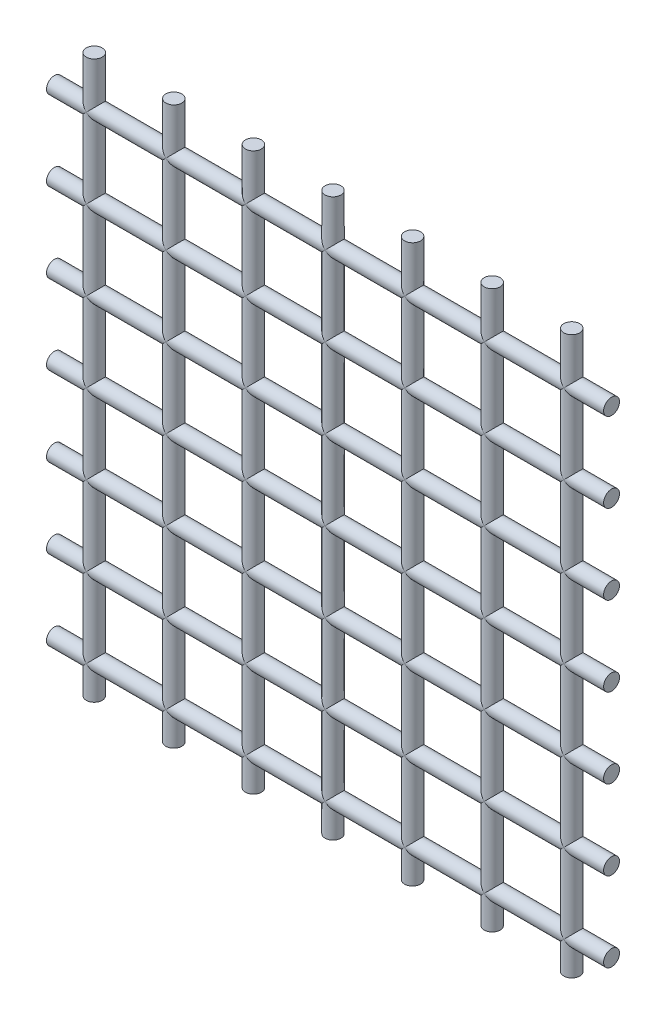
ISO-10303-21;
HEADER;
FILE_DESCRIPTION(('STEP AP214'),'2;1');
FILE_NAME('part.step','',(''),(''),'','','');
FILE_SCHEMA(('AUTOMOTIVE_DESIGN { 1 0 10303 214 1 1 1 1 }'));
ENDSEC;
DATA;
#1=APPLICATION_CONTEXT('core data for automotive mechanical design processes');
#2=APPLICATION_PROTOCOL_DEFINITION('international standard','automotive_design',2000,#1);
#3=PRODUCT_CONTEXT('',#1,'mechanical');
#4=PRODUCT('Part','Part','',(#3));
#5=PRODUCT_RELATED_PRODUCT_CATEGORY('part','',(#4));
#6=PRODUCT_DEFINITION_FORMATION('','',#4);
#7=PRODUCT_DEFINITION_CONTEXT('part definition',#1,'design');
#8=PRODUCT_DEFINITION('design','',#6,#7);
#9=PRODUCT_DEFINITION_SHAPE('','',#8);
#10=(LENGTH_UNIT() NAMED_UNIT(*) SI_UNIT(.MILLI.,.METRE.));
#11=(NAMED_UNIT(*) PLANE_ANGLE_UNIT() SI_UNIT($,.RADIAN.));
#12=(NAMED_UNIT(*) SI_UNIT($,.STERADIAN.) SOLID_ANGLE_UNIT());
#13=UNCERTAINTY_MEASURE_WITH_UNIT(LENGTH_MEASURE(1.E-05),#10,'distance_accuracy_value','');
#14=(GEOMETRIC_REPRESENTATION_CONTEXT(3) GLOBAL_UNCERTAINTY_ASSIGNED_CONTEXT((#13)) GLOBAL_UNIT_ASSIGNED_CONTEXT((#10,
#11,#12)) REPRESENTATION_CONTEXT('',''));
#15=CARTESIAN_POINT('',(0.,0.,0.));
#16=DIRECTION('',(0.,0.,1.));
#17=DIRECTION('',(1.,0.,0.));
#18=AXIS2_PLACEMENT_3D('',#15,#16,#17);
#19=CARTESIAN_POINT('',(11.9999995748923,-28.5453606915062,1.13471504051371E-06));
#20=DIRECTION('',(0.,1.,0.));
#21=DIRECTION('',(-1.,0.,0.));
#22=AXIS2_PLACEMENT_3D('',#19,#20,#21);
#23=CYLINDRICAL_SURFACE('',#22,0.400000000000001);
#24=CARTESIAN_POINT('',(11.9999995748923,-22.9453606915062,1.13471504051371E-06));
#25=DIRECTION('',(-0.707106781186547,0.707106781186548,0.));
#26=DIRECTION('',(0.707106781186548,0.707106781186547,0.));
#27=AXIS2_PLACEMENT_3D('',#24,#25,#26);
#28=ELLIPSE('',#27,0.565685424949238,0.4);
#29=CARTESIAN_POINT('',(11.9999995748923,-22.9453606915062,-0.39999886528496));
#30=VERTEX_POINT('',#29);
#31=CARTESIAN_POINT('',(11.9999995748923,-22.9453606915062,0.400001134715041));
#32=VERTEX_POINT('',#31);
#33=EDGE_CURVE('E482',#30,#32,#28,.T.);
#34=ORIENTED_EDGE('',*,*,#33,.F.);
#35=CARTESIAN_POINT('',(11.9999995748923,-22.9453606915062,1.13471504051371E-06));
#36=DIRECTION('',(0.707106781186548,0.707106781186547,0.));
#37=DIRECTION('',(-0.707106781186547,0.707106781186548,0.));
#38=AXIS2_PLACEMENT_3D('',#35,#36,#37);
#39=ELLIPSE('',#38,0.565685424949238,0.4);
#40=EDGE_CURVE('E479',#32,#30,#39,.T.);
#41=ORIENTED_EDGE('',*,*,#40,.F.);
#42=EDGE_LOOP('',(#34,#41));
#43=FACE_BOUND('',#42,.T.);
#44=CARTESIAN_POINT('',(11.9999995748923,-26.9453606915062,1.13471504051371E-06));
#45=DIRECTION('',(-0.707106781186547,0.707106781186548,0.));
#46=DIRECTION('',(0.707106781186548,0.707106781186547,0.));
#47=AXIS2_PLACEMENT_3D('',#44,#45,#46);
#48=ELLIPSE('',#47,0.565685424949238,0.4);
#49=CARTESIAN_POINT('',(11.9999995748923,-26.9453606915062,-0.39999886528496));
#50=VERTEX_POINT('',#49);
#51=CARTESIAN_POINT('',(11.9999995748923,-26.9453606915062,0.400001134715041));
#52=VERTEX_POINT('',#51);
#53=EDGE_CURVE('E853',#50,#52,#48,.F.);
#54=ORIENTED_EDGE('',*,*,#53,.F.);
#55=CARTESIAN_POINT('',(11.9999995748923,-26.9453606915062,1.13471504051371E-06));
#56=DIRECTION('',(0.707106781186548,0.707106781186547,0.));
#57=DIRECTION('',(-0.707106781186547,0.707106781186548,0.));
#58=AXIS2_PLACEMENT_3D('',#55,#56,#57);
#59=ELLIPSE('',#58,0.565685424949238,0.4);
#60=EDGE_CURVE('E46',#52,#50,#59,.F.);
#61=ORIENTED_EDGE('',*,*,#60,.F.);
#62=EDGE_LOOP('',(#54,#61));
#63=FACE_BOUND('',#62,.T.);
#64=ADVANCED_FACE('F32',(#43,#63),#23,.T.);
#65=CARTESIAN_POINT('',(7.99999957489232,-28.5453606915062,1.13471504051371E-06));
#66=DIRECTION('',(0.,1.,0.));
#67=DIRECTION('',(-1.,0.,0.));
#68=AXIS2_PLACEMENT_3D('',#65,#66,#67);
#69=CYLINDRICAL_SURFACE('',#68,0.400000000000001);
#70=CARTESIAN_POINT('',(7.99999957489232,-22.9453606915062,1.13471504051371E-06));
#71=DIRECTION('',(-0.707106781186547,0.707106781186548,0.));
#72=DIRECTION('',(0.707106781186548,0.707106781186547,0.));
#73=AXIS2_PLACEMENT_3D('',#70,#71,#72);
#74=ELLIPSE('',#73,0.565685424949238,0.4);
#75=CARTESIAN_POINT('',(7.99999957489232,-22.9453606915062,-0.39999886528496));
#76=VERTEX_POINT('',#75);
#77=CARTESIAN_POINT('',(7.99999957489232,-22.9453606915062,0.400001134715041));
#78=VERTEX_POINT('',#77);
#79=EDGE_CURVE('E873',#76,#78,#74,.T.);
#80=ORIENTED_EDGE('',*,*,#79,.F.);
#81=CARTESIAN_POINT('',(7.99999957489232,-22.9453606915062,1.13471504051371E-06));
#82=DIRECTION('',(0.707106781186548,0.707106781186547,0.));
#83=DIRECTION('',(-0.707106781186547,0.707106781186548,0.));
#84=AXIS2_PLACEMENT_3D('',#81,#82,#83);
#85=ELLIPSE('',#84,0.565685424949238,0.4);
#86=EDGE_CURVE('E870',#78,#76,#85,.T.);
#87=ORIENTED_EDGE('',*,*,#86,.F.);
#88=EDGE_LOOP('',(#80,#87));
#89=FACE_BOUND('',#88,.T.);
#90=CARTESIAN_POINT('',(7.99999957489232,-26.9453606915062,1.13471504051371E-06));
#91=DIRECTION('',(-0.707106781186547,0.707106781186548,0.));
#92=DIRECTION('',(0.707106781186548,0.707106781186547,0.));
#93=AXIS2_PLACEMENT_3D('',#90,#91,#92);
#94=ELLIPSE('',#93,0.565685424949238,0.4);
#95=CARTESIAN_POINT('',(7.99999957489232,-26.9453606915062,-0.39999886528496));
#96=VERTEX_POINT('',#95);
#97=CARTESIAN_POINT('',(7.99999957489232,-26.9453606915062,0.400001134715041));
#98=VERTEX_POINT('',#97);
#99=EDGE_CURVE('E857',#96,#98,#94,.F.);
#100=ORIENTED_EDGE('',*,*,#99,.F.);
#101=CARTESIAN_POINT('',(7.99999957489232,-26.9453606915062,1.13471504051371E-06));
#102=DIRECTION('',(0.707106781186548,0.707106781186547,0.));
#103=DIRECTION('',(-0.707106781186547,0.707106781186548,0.));
#104=AXIS2_PLACEMENT_3D('',#101,#102,#103);
#105=ELLIPSE('',#104,0.565685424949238,0.4);
#106=EDGE_CURVE('E53',#98,#96,#105,.F.);
#107=ORIENTED_EDGE('',*,*,#106,.F.);
#108=EDGE_LOOP('',(#100,#107));
#109=FACE_BOUND('',#108,.T.);
#110=ADVANCED_FACE('F532',(#89,#109),#69,.T.);
#111=CARTESIAN_POINT('',(3.99999957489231,-28.5453606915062,1.13471504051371E-06));
#112=DIRECTION('',(0.,1.,0.));
#113=DIRECTION('',(-1.,0.,0.));
#114=AXIS2_PLACEMENT_3D('',#111,#112,#113);
#115=CYLINDRICAL_SURFACE('',#114,0.400000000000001);
#116=CARTESIAN_POINT('',(3.99999957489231,-22.9453606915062,1.13471504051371E-06));
#117=DIRECTION('',(-0.707106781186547,0.707106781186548,0.));
#118=DIRECTION('',(0.707106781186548,0.707106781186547,0.));
#119=AXIS2_PLACEMENT_3D('',#116,#117,#118);
#120=ELLIPSE('',#119,0.565685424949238,0.4);
#121=CARTESIAN_POINT('',(3.99999957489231,-22.9453606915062,-0.39999886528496));
#122=VERTEX_POINT('',#121);
#123=CARTESIAN_POINT('',(3.99999957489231,-22.9453606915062,0.400001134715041));
#124=VERTEX_POINT('',#123);
#125=EDGE_CURVE('E884',#122,#124,#120,.T.);
#126=ORIENTED_EDGE('',*,*,#125,.F.);
#127=CARTESIAN_POINT('',(3.99999957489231,-22.9453606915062,1.13471504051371E-06));
#128=DIRECTION('',(0.707106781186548,0.707106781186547,0.));
#129=DIRECTION('',(-0.707106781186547,0.707106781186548,0.));
#130=AXIS2_PLACEMENT_3D('',#127,#128,#129);
#131=ELLIPSE('',#130,0.565685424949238,0.4);
#132=EDGE_CURVE('E881',#124,#122,#131,.T.);
#133=ORIENTED_EDGE('',*,*,#132,.F.);
#134=EDGE_LOOP('',(#126,#133));
#135=FACE_BOUND('',#134,.T.);
#136=CARTESIAN_POINT('',(3.99999957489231,-26.9453606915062,1.13471504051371E-06));
#137=DIRECTION('',(-0.707106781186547,0.707106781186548,0.));
#138=DIRECTION('',(0.707106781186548,0.707106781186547,0.));
#139=AXIS2_PLACEMENT_3D('',#136,#137,#138);
#140=ELLIPSE('',#139,0.565685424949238,0.4);
#141=CARTESIAN_POINT('',(3.99999957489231,-26.9453606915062,-0.39999886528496));
#142=VERTEX_POINT('',#141);
#143=CARTESIAN_POINT('',(3.99999957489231,-26.9453606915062,0.400001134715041));
#144=VERTEX_POINT('',#143);
#145=EDGE_CURVE('E1272',#142,#144,#140,.F.);
#146=ORIENTED_EDGE('',*,*,#145,.F.);
#147=CARTESIAN_POINT('',(3.99999957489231,-26.9453606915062,1.13471504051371E-06));
#148=DIRECTION('',(0.707106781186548,0.707106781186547,0.));
#149=DIRECTION('',(-0.707106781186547,0.707106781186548,0.));
#150=AXIS2_PLACEMENT_3D('',#147,#148,#149);
#151=ELLIPSE('',#150,0.565685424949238,0.4);
#152=EDGE_CURVE('E1264',#144,#142,#151,.F.);
#153=ORIENTED_EDGE('',*,*,#152,.F.);
#154=EDGE_LOOP('',(#146,#153));
#155=FACE_BOUND('',#154,.T.);
#156=ADVANCED_FACE('F540',(#135,#155),#115,.T.);
#157=CARTESIAN_POINT('',(-4.25107685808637E-07,-28.5453606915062,1.13471504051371E-06));
#158=DIRECTION('',(0.,1.,0.));
#159=DIRECTION('',(-1.,0.,0.));
#160=AXIS2_PLACEMENT_3D('',#157,#158,#159);
#161=CYLINDRICAL_SURFACE('',#160,0.400000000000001);
#162=CARTESIAN_POINT('',(-4.25107685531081E-07,-22.9453606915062,1.13471504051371E-06));
#163=DIRECTION('',(-0.707106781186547,0.707106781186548,0.));
#164=DIRECTION('',(0.707106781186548,0.707106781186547,0.));
#165=AXIS2_PLACEMENT_3D('',#162,#163,#164);
#166=ELLIPSE('',#165,0.565685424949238,0.4);
#167=CARTESIAN_POINT('',(-4.25107685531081E-07,-22.9453606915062,-0.39999886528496));
#168=VERTEX_POINT('',#167);
#169=CARTESIAN_POINT('',(-4.25107685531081E-07,-22.9453606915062,0.400001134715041));
#170=VERTEX_POINT('',#169);
#171=EDGE_CURVE('E895',#168,#170,#166,.T.);
#172=ORIENTED_EDGE('',*,*,#171,.F.);
#173=CARTESIAN_POINT('',(-4.25107685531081E-07,-22.9453606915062,1.13471504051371E-06));
#174=DIRECTION('',(0.707106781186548,0.707106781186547,0.));
#175=DIRECTION('',(-0.707106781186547,0.707106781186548,0.));
#176=AXIS2_PLACEMENT_3D('',#173,#174,#175);
#177=ELLIPSE('',#176,0.565685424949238,0.4);
#178=EDGE_CURVE('E892',#170,#168,#177,.T.);
#179=ORIENTED_EDGE('',*,*,#178,.F.);
#180=EDGE_LOOP('',(#172,#179));
#181=FACE_BOUND('',#180,.T.);
#182=CARTESIAN_POINT('',(-4.25107685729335E-07,-26.9453606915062,1.13471504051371E-06));
#183=DIRECTION('',(-0.707106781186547,0.707106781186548,0.));
#184=DIRECTION('',(0.707106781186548,0.707106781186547,0.));
#185=AXIS2_PLACEMENT_3D('',#182,#183,#184);
#186=ELLIPSE('',#185,0.565685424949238,0.4);
#187=CARTESIAN_POINT('',(-4.25107685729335E-07,-26.9453606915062,-0.39999886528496));
#188=VERTEX_POINT('',#187);
#189=CARTESIAN_POINT('',(-4.25107685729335E-07,-26.9453606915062,0.400001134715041));
#190=VERTEX_POINT('',#189);
#191=EDGE_CURVE('E1261',#188,#190,#186,.F.);
#192=ORIENTED_EDGE('',*,*,#191,.F.);
#193=CARTESIAN_POINT('',(-4.25107685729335E-07,-26.9453606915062,1.13471504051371E-06));
#194=DIRECTION('',(0.707106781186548,0.707106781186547,0.));
#195=DIRECTION('',(-0.707106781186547,0.707106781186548,0.));
#196=AXIS2_PLACEMENT_3D('',#193,#194,#195);
#197=ELLIPSE('',#196,0.565685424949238,0.4);
#198=EDGE_CURVE('E1253',#190,#188,#197,.F.);
#199=ORIENTED_EDGE('',*,*,#198,.F.);
#200=EDGE_LOOP('',(#192,#199));
#201=FACE_BOUND('',#200,.T.);
#202=ADVANCED_FACE('F1302',(#181,#201),#161,.T.);
#203=CARTESIAN_POINT('',(-4.00000042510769,-28.5453606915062,1.13471504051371E-06));
#204=DIRECTION('',(0.,1.,0.));
#205=DIRECTION('',(-1.,0.,0.));
#206=AXIS2_PLACEMENT_3D('',#203,#204,#205);
#207=CYLINDRICAL_SURFACE('',#206,0.400000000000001);
#208=CARTESIAN_POINT('',(-4.00000042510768,-22.9453606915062,1.13471504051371E-06));
#209=DIRECTION('',(-0.707106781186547,0.707106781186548,0.));
#210=DIRECTION('',(0.707106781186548,0.707106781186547,0.));
#211=AXIS2_PLACEMENT_3D('',#208,#209,#210);
#212=ELLIPSE('',#211,0.565685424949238,0.4);
#213=CARTESIAN_POINT('',(-4.00000042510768,-22.9453606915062,-0.39999886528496));
#214=VERTEX_POINT('',#213);
#215=CARTESIAN_POINT('',(-4.00000042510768,-22.9453606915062,0.400001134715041));
#216=VERTEX_POINT('',#215);
#217=EDGE_CURVE('E906',#214,#216,#212,.T.);
#218=ORIENTED_EDGE('',*,*,#217,.F.);
#219=CARTESIAN_POINT('',(-4.00000042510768,-22.9453606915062,1.13471504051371E-06));
#220=DIRECTION('',(0.707106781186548,0.707106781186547,0.));
#221=DIRECTION('',(-0.707106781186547,0.707106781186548,0.));
#222=AXIS2_PLACEMENT_3D('',#219,#220,#221);
#223=ELLIPSE('',#222,0.565685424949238,0.4);
#224=EDGE_CURVE('E903',#216,#214,#223,.T.);
#225=ORIENTED_EDGE('',*,*,#224,.F.);
#226=EDGE_LOOP('',(#218,#225));
#227=FACE_BOUND('',#226,.T.);
#228=CARTESIAN_POINT('',(-4.00000042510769,-26.9453606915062,1.13471504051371E-06));
#229=DIRECTION('',(-0.707106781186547,0.707106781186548,0.));
#230=DIRECTION('',(0.707106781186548,0.707106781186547,0.));
#231=AXIS2_PLACEMENT_3D('',#228,#229,#230);
#232=ELLIPSE('',#231,0.565685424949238,0.4);
#233=CARTESIAN_POINT('',(-4.00000042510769,-26.9453606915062,-0.39999886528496));
#234=VERTEX_POINT('',#233);
#235=CARTESIAN_POINT('',(-4.00000042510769,-26.9453606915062,0.400001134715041));
#236=VERTEX_POINT('',#235);
#237=EDGE_CURVE('E1250',#234,#236,#232,.F.);
#238=ORIENTED_EDGE('',*,*,#237,.F.);
#239=CARTESIAN_POINT('',(-4.00000042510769,-26.9453606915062,1.13471504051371E-06));
#240=DIRECTION('',(0.707106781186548,0.707106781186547,0.));
#241=DIRECTION('',(-0.707106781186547,0.707106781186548,0.));
#242=AXIS2_PLACEMENT_3D('',#239,#240,#241);
#243=ELLIPSE('',#242,0.565685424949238,0.4);
#244=EDGE_CURVE('E1242',#236,#234,#243,.F.);
#245=ORIENTED_EDGE('',*,*,#244,.F.);
#246=EDGE_LOOP('',(#238,#245));
#247=FACE_BOUND('',#246,.T.);
#248=ADVANCED_FACE('F517',(#227,#247),#207,.T.);
#249=CARTESIAN_POINT('',(-8.00000042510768,-28.5453606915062,1.13471504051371E-06));
#250=DIRECTION('',(0.,1.,0.));
#251=DIRECTION('',(-1.,0.,0.));
#252=AXIS2_PLACEMENT_3D('',#249,#250,#251);
#253=CYLINDRICAL_SURFACE('',#252,0.400000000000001);
#254=CARTESIAN_POINT('',(-8.00000042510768,-22.9453606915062,1.13471504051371E-06));
#255=DIRECTION('',(-0.707106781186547,0.707106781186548,0.));
#256=DIRECTION('',(0.707106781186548,0.707106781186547,0.));
#257=AXIS2_PLACEMENT_3D('',#254,#255,#256);
#258=ELLIPSE('',#257,0.565685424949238,0.4);
#259=CARTESIAN_POINT('',(-8.00000042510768,-22.9453606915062,-0.39999886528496));
#260=VERTEX_POINT('',#259);
#261=CARTESIAN_POINT('',(-8.00000042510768,-22.9453606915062,0.400001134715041));
#262=VERTEX_POINT('',#261);
#263=EDGE_CURVE('E917',#260,#262,#258,.T.);
#264=ORIENTED_EDGE('',*,*,#263,.F.);
#265=CARTESIAN_POINT('',(-8.00000042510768,-22.9453606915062,1.13471504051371E-06));
#266=DIRECTION('',(0.707106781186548,0.707106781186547,0.));
#267=DIRECTION('',(-0.707106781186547,0.707106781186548,0.));
#268=AXIS2_PLACEMENT_3D('',#265,#266,#267);
#269=ELLIPSE('',#268,0.565685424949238,0.4);
#270=EDGE_CURVE('E914',#262,#260,#269,.T.);
#271=ORIENTED_EDGE('',*,*,#270,.F.);
#272=EDGE_LOOP('',(#264,#271));
#273=FACE_BOUND('',#272,.T.);
#274=CARTESIAN_POINT('',(-8.00000042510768,-26.9453606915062,1.13471504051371E-06));
#275=DIRECTION('',(-0.707106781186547,0.707106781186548,0.));
#276=DIRECTION('',(0.707106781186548,0.707106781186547,0.));
#277=AXIS2_PLACEMENT_3D('',#274,#275,#276);
#278=ELLIPSE('',#277,0.565685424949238,0.4);
#279=CARTESIAN_POINT('',(-8.00000042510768,-26.9453606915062,-0.39999886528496));
#280=VERTEX_POINT('',#279);
#281=CARTESIAN_POINT('',(-8.00000042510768,-26.9453606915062,0.400001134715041));
#282=VERTEX_POINT('',#281);
#283=EDGE_CURVE('E1239',#280,#282,#278,.F.);
#284=ORIENTED_EDGE('',*,*,#283,.F.);
#285=CARTESIAN_POINT('',(-8.00000042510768,-26.9453606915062,1.13471504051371E-06));
#286=DIRECTION('',(0.707106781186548,0.707106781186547,0.));
#287=DIRECTION('',(-0.707106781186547,0.707106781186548,0.));
#288=AXIS2_PLACEMENT_3D('',#285,#286,#287);
#289=ELLIPSE('',#288,0.565685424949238,0.4);
#290=EDGE_CURVE('E1229',#282,#280,#289,.F.);
#291=ORIENTED_EDGE('',*,*,#290,.F.);
#292=EDGE_LOOP('',(#284,#291));
#293=FACE_BOUND('',#292,.T.);
#294=ADVANCED_FACE('F506',(#273,#293),#253,.T.);
#295=CARTESIAN_POINT('',(-12.0000004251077,-28.5453606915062,1.13471504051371E-06));
#296=DIRECTION('',(0.,1.,0.));
#297=DIRECTION('',(-1.,0.,0.));
#298=AXIS2_PLACEMENT_3D('',#295,#296,#297);
#299=CYLINDRICAL_SURFACE('',#298,0.400000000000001);
#300=CARTESIAN_POINT('',(-12.0000004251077,-22.9453606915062,1.13471504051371E-06));
#301=DIRECTION('',(-0.707106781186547,0.707106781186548,0.));
#302=DIRECTION('',(0.707106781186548,0.707106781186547,0.));
#303=AXIS2_PLACEMENT_3D('',#300,#301,#302);
#304=ELLIPSE('',#303,0.565685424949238,0.4);
#305=CARTESIAN_POINT('',(-12.0000004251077,-22.9453606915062,-0.39999886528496));
#306=VERTEX_POINT('',#305);
#307=CARTESIAN_POINT('',(-12.0000004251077,-22.9453606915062,0.400001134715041));
#308=VERTEX_POINT('',#307);
#309=EDGE_CURVE('E928',#306,#308,#304,.T.);
#310=ORIENTED_EDGE('',*,*,#309,.F.);
#311=CARTESIAN_POINT('',(-12.0000004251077,-22.9453606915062,1.13471504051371E-06));
#312=DIRECTION('',(0.707106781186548,0.707106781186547,0.));
#313=DIRECTION('',(-0.707106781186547,0.707106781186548,0.));
#314=AXIS2_PLACEMENT_3D('',#311,#312,#313);
#315=ELLIPSE('',#314,0.565685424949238,0.4);
#316=EDGE_CURVE('E925',#308,#306,#315,.T.);
#317=ORIENTED_EDGE('',*,*,#316,.F.);
#318=EDGE_LOOP('',(#310,#317));
#319=FACE_BOUND('',#318,.T.);
#320=CARTESIAN_POINT('',(-12.0000004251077,-26.9453606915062,1.13471504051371E-06));
#321=DIRECTION('',(-0.707106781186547,0.707106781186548,0.));
#322=DIRECTION('',(0.707106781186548,0.707106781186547,0.));
#323=AXIS2_PLACEMENT_3D('',#320,#321,#322);
#324=ELLIPSE('',#323,0.565685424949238,0.4);
#325=CARTESIAN_POINT('',(-12.0000004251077,-26.9453606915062,-0.39999886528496));
#326=VERTEX_POINT('',#325);
#327=CARTESIAN_POINT('',(-12.0000004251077,-26.9453606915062,0.400001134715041));
#328=VERTEX_POINT('',#327);
#329=EDGE_CURVE('E11',#326,#328,#324,.F.);
#330=ORIENTED_EDGE('',*,*,#329,.F.);
#331=CARTESIAN_POINT('',(-12.0000004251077,-26.9453606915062,1.13471504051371E-06));
#332=DIRECTION('',(0.707106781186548,0.707106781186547,0.));
#333=DIRECTION('',(-0.707106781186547,0.707106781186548,0.));
#334=AXIS2_PLACEMENT_3D('',#331,#332,#333);
#335=ELLIPSE('',#334,0.565685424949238,0.4);
#336=EDGE_CURVE('E488',#328,#326,#335,.F.);
#337=ORIENTED_EDGE('',*,*,#336,.F.);
#338=EDGE_LOOP('',(#330,#337));
#339=FACE_BOUND('',#338,.T.);
#340=ADVANCED_FACE('F503',(#319,#339),#299,.T.);
#341=CARTESIAN_POINT('',(-12.0000004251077,-18.9453606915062,1.13471504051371E-06));
#342=DIRECTION('',(-0.707106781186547,0.707106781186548,0.));
#343=DIRECTION('',(0.707106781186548,0.707106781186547,0.));
#344=AXIS2_PLACEMENT_3D('',#341,#342,#343);
#345=ELLIPSE('',#344,0.565685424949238,0.4);
#346=CARTESIAN_POINT('',(-12.0000004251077,-18.9453606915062,-0.39999886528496));
#347=VERTEX_POINT('',#346);
#348=CARTESIAN_POINT('',(-12.0000004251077,-18.9453606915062,0.400001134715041));
#349=VERTEX_POINT('',#348);
#350=EDGE_CURVE('E471',#347,#349,#345,.T.);
#351=ORIENTED_EDGE('',*,*,#350,.F.);
#352=CARTESIAN_POINT('',(-12.0000004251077,-18.9453606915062,1.13471504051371E-06));
#353=DIRECTION('',(0.707106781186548,0.707106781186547,0.));
#354=DIRECTION('',(-0.707106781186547,0.707106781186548,0.));
#355=AXIS2_PLACEMENT_3D('',#352,#353,#354);
#356=ELLIPSE('',#355,0.565685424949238,0.4);
#357=EDGE_CURVE('E468',#349,#347,#356,.T.);
#358=ORIENTED_EDGE('',*,*,#357,.F.);
#359=EDGE_LOOP('',(#351,#358));
#360=FACE_BOUND('',#359,.T.);
#361=CARTESIAN_POINT('',(-12.0000004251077,-22.9453606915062,1.13471504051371E-06));
#362=DIRECTION('',(-0.707106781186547,0.707106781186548,0.));
#363=DIRECTION('',(0.707106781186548,0.707106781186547,0.));
#364=AXIS2_PLACEMENT_3D('',#361,#362,#363);
#365=ELLIPSE('',#364,0.565685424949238,0.4);
#366=EDGE_CURVE('E931',#306,#308,#365,.F.);
#367=ORIENTED_EDGE('',*,*,#366,.F.);
#368=CARTESIAN_POINT('',(-12.0000004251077,-22.9453606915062,1.13471504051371E-06));
#369=DIRECTION('',(0.707106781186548,0.707106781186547,0.));
#370=DIRECTION('',(-0.707106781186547,0.707106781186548,0.));
#371=AXIS2_PLACEMENT_3D('',#368,#369,#370);
#372=ELLIPSE('',#371,0.565685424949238,0.4);
#373=EDGE_CURVE('E923',#308,#306,#372,.F.);
#374=ORIENTED_EDGE('',*,*,#373,.F.);
#375=EDGE_LOOP('',(#367,#374));
#376=FACE_BOUND('',#375,.T.);
#377=ADVANCED_FACE('F505',(#360,#376),#299,.T.);
#378=CARTESIAN_POINT('',(-8.00000042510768,-18.9453606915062,1.13471504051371E-06));
#379=DIRECTION('',(-0.707106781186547,0.707106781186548,0.));
#380=DIRECTION('',(0.707106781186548,0.707106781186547,0.));
#381=AXIS2_PLACEMENT_3D('',#378,#379,#380);
#382=ELLIPSE('',#381,0.565685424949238,0.4);
#383=CARTESIAN_POINT('',(-8.00000042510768,-18.9453606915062,-0.39999886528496));
#384=VERTEX_POINT('',#383);
#385=CARTESIAN_POINT('',(-8.00000042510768,-18.9453606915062,0.400001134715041));
#386=VERTEX_POINT('',#385);
#387=EDGE_CURVE('E945',#384,#386,#382,.T.);
#388=ORIENTED_EDGE('',*,*,#387,.F.);
#389=CARTESIAN_POINT('',(-8.00000042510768,-18.9453606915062,1.13471504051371E-06));
#390=DIRECTION('',(0.707106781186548,0.707106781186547,0.));
#391=DIRECTION('',(-0.707106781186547,0.707106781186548,0.));
#392=AXIS2_PLACEMENT_3D('',#389,#390,#391);
#393=ELLIPSE('',#392,0.565685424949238,0.4);
#394=EDGE_CURVE('E942',#386,#384,#393,.T.);
#395=ORIENTED_EDGE('',*,*,#394,.F.);
#396=EDGE_LOOP('',(#388,#395));
#397=FACE_BOUND('',#396,.T.);
#398=CARTESIAN_POINT('',(-8.00000042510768,-22.9453606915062,1.13471504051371E-06));
#399=DIRECTION('',(-0.707106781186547,0.707106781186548,0.));
#400=DIRECTION('',(0.707106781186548,0.707106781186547,0.));
#401=AXIS2_PLACEMENT_3D('',#398,#399,#400);
#402=ELLIPSE('',#401,0.565685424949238,0.4);
#403=EDGE_CURVE('E920',#260,#262,#402,.F.);
#404=ORIENTED_EDGE('',*,*,#403,.F.);
#405=CARTESIAN_POINT('',(-8.00000042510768,-22.9453606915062,1.13471504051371E-06));
#406=DIRECTION('',(0.707106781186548,0.707106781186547,0.));
#407=DIRECTION('',(-0.707106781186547,0.707106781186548,0.));
#408=AXIS2_PLACEMENT_3D('',#405,#406,#407);
#409=ELLIPSE('',#408,0.565685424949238,0.4);
#410=EDGE_CURVE('E912',#262,#260,#409,.F.);
#411=ORIENTED_EDGE('',*,*,#410,.F.);
#412=EDGE_LOOP('',(#404,#411));
#413=FACE_BOUND('',#412,.T.);
#414=ADVANCED_FACE('F514',(#397,#413),#253,.T.);
#415=CARTESIAN_POINT('',(-4.00000042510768,-18.9453606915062,1.13471504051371E-06));
#416=DIRECTION('',(-0.707106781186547,0.707106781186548,0.));
#417=DIRECTION('',(0.707106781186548,0.707106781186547,0.));
#418=AXIS2_PLACEMENT_3D('',#415,#416,#417);
#419=ELLIPSE('',#418,0.565685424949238,0.4);
#420=CARTESIAN_POINT('',(-4.00000042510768,-18.9453606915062,-0.39999886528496));
#421=VERTEX_POINT('',#420);
#422=CARTESIAN_POINT('',(-4.00000042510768,-18.9453606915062,0.400001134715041));
#423=VERTEX_POINT('',#422);
#424=EDGE_CURVE('E956',#421,#423,#419,.T.);
#425=ORIENTED_EDGE('',*,*,#424,.F.);
#426=CARTESIAN_POINT('',(-4.00000042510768,-18.9453606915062,1.13471504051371E-06));
#427=DIRECTION('',(0.707106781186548,0.707106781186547,0.));
#428=DIRECTION('',(-0.707106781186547,0.707106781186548,0.));
#429=AXIS2_PLACEMENT_3D('',#426,#427,#428);
#430=ELLIPSE('',#429,0.565685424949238,0.4);
#431=EDGE_CURVE('E953',#423,#421,#430,.T.);
#432=ORIENTED_EDGE('',*,*,#431,.F.);
#433=EDGE_LOOP('',(#425,#432));
#434=FACE_BOUND('',#433,.T.);
#435=CARTESIAN_POINT('',(-4.00000042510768,-22.9453606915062,1.13471504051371E-06));
#436=DIRECTION('',(-0.707106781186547,0.707106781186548,0.));
#437=DIRECTION('',(0.707106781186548,0.707106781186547,0.));
#438=AXIS2_PLACEMENT_3D('',#435,#436,#437);
#439=ELLIPSE('',#438,0.565685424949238,0.4);
#440=EDGE_CURVE('E909',#214,#216,#439,.F.);
#441=ORIENTED_EDGE('',*,*,#440,.F.);
#442=CARTESIAN_POINT('',(-4.00000042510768,-22.9453606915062,1.13471504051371E-06));
#443=DIRECTION('',(0.707106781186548,0.707106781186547,0.));
#444=DIRECTION('',(-0.707106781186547,0.707106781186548,0.));
#445=AXIS2_PLACEMENT_3D('',#442,#443,#444);
#446=ELLIPSE('',#445,0.565685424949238,0.4);
#447=EDGE_CURVE('E901',#216,#214,#446,.F.);
#448=ORIENTED_EDGE('',*,*,#447,.F.);
#449=EDGE_LOOP('',(#441,#448));
#450=FACE_BOUND('',#449,.T.);
#451=ADVANCED_FACE('F1452',(#434,#450),#207,.T.);
#452=CARTESIAN_POINT('',(-4.25107685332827E-07,-18.9453606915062,1.13471504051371E-06));
#453=DIRECTION('',(-0.707106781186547,0.707106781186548,0.));
#454=DIRECTION('',(0.707106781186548,0.707106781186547,0.));
#455=AXIS2_PLACEMENT_3D('',#452,#453,#454);
#456=ELLIPSE('',#455,0.565685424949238,0.4);
#457=CARTESIAN_POINT('',(-4.25107685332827E-07,-18.9453606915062,-0.39999886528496));
#458=VERTEX_POINT('',#457);
#459=CARTESIAN_POINT('',(-4.25107685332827E-07,-18.9453606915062,0.400001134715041));
#460=VERTEX_POINT('',#459);
#461=EDGE_CURVE('E967',#458,#460,#456,.T.);
#462=ORIENTED_EDGE('',*,*,#461,.F.);
#463=CARTESIAN_POINT('',(-4.25107685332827E-07,-18.9453606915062,1.13471504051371E-06));
#464=DIRECTION('',(0.707106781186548,0.707106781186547,0.));
#465=DIRECTION('',(-0.707106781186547,0.707106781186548,0.));
#466=AXIS2_PLACEMENT_3D('',#463,#464,#465);
#467=ELLIPSE('',#466,0.565685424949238,0.4);
#468=EDGE_CURVE('E964',#460,#458,#467,.T.);
#469=ORIENTED_EDGE('',*,*,#468,.F.);
#470=EDGE_LOOP('',(#462,#469));
#471=FACE_BOUND('',#470,.T.);
#472=CARTESIAN_POINT('',(-4.25107685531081E-07,-22.9453606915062,1.13471504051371E-06));
#473=DIRECTION('',(-0.707106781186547,0.707106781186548,0.));
#474=DIRECTION('',(0.707106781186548,0.707106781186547,0.));
#475=AXIS2_PLACEMENT_3D('',#472,#473,#474);
#476=ELLIPSE('',#475,0.565685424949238,0.4);
#477=EDGE_CURVE('E898',#168,#170,#476,.F.);
#478=ORIENTED_EDGE('',*,*,#477,.F.);
#479=CARTESIAN_POINT('',(-4.25107685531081E-07,-22.9453606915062,1.13471504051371E-06));
#480=DIRECTION('',(0.707106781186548,0.707106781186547,0.));
#481=DIRECTION('',(-0.707106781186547,0.707106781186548,0.));
#482=AXIS2_PLACEMENT_3D('',#479,#480,#481);
#483=ELLIPSE('',#482,0.565685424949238,0.4);
#484=EDGE_CURVE('E890',#170,#168,#483,.F.);
#485=ORIENTED_EDGE('',*,*,#484,.F.);
#486=EDGE_LOOP('',(#478,#485));
#487=FACE_BOUND('',#486,.T.);
#488=ADVANCED_FACE('F1301',(#471,#487),#161,.T.);
#489=CARTESIAN_POINT('',(3.99999957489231,-18.9453606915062,1.13471504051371E-06));
#490=DIRECTION('',(-0.707106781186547,0.707106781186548,0.));
#491=DIRECTION('',(0.707106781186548,0.707106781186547,0.));
#492=AXIS2_PLACEMENT_3D('',#489,#490,#491);
#493=ELLIPSE('',#492,0.565685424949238,0.4);
#494=CARTESIAN_POINT('',(3.99999957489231,-18.9453606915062,-0.39999886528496));
#495=VERTEX_POINT('',#494);
#496=CARTESIAN_POINT('',(3.99999957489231,-18.9453606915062,0.400001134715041));
#497=VERTEX_POINT('',#496);
#498=EDGE_CURVE('E978',#495,#497,#493,.T.);
#499=ORIENTED_EDGE('',*,*,#498,.F.);
#500=CARTESIAN_POINT('',(3.99999957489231,-18.9453606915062,1.13471504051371E-06));
#501=DIRECTION('',(0.707106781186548,0.707106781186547,0.));
#502=DIRECTION('',(-0.707106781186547,0.707106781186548,0.));
#503=AXIS2_PLACEMENT_3D('',#500,#501,#502);
#504=ELLIPSE('',#503,0.565685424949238,0.4);
#505=EDGE_CURVE('E975',#497,#495,#504,.T.);
#506=ORIENTED_EDGE('',*,*,#505,.F.);
#507=EDGE_LOOP('',(#499,#506));
#508=FACE_BOUND('',#507,.T.);
#509=CARTESIAN_POINT('',(3.99999957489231,-22.9453606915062,1.13471504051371E-06));
#510=DIRECTION('',(-0.707106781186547,0.707106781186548,0.));
#511=DIRECTION('',(0.707106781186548,0.707106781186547,0.));
#512=AXIS2_PLACEMENT_3D('',#509,#510,#511);
#513=ELLIPSE('',#512,0.565685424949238,0.4);
#514=EDGE_CURVE('E887',#122,#124,#513,.F.);
#515=ORIENTED_EDGE('',*,*,#514,.F.);
#516=CARTESIAN_POINT('',(3.99999957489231,-22.9453606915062,1.13471504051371E-06));
#517=DIRECTION('',(0.707106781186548,0.707106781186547,0.));
#518=DIRECTION('',(-0.707106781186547,0.707106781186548,0.));
#519=AXIS2_PLACEMENT_3D('',#516,#517,#518);
#520=ELLIPSE('',#519,0.565685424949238,0.4);
#521=EDGE_CURVE('E879',#124,#122,#520,.F.);
#522=ORIENTED_EDGE('',*,*,#521,.F.);
#523=EDGE_LOOP('',(#515,#522));
#524=FACE_BOUND('',#523,.T.);
#525=ADVANCED_FACE('F1317',(#508,#524),#115,.T.);
#526=CARTESIAN_POINT('',(7.99999957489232,-18.9453606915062,1.13471504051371E-06));
#527=DIRECTION('',(-0.707106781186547,0.707106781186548,0.));
#528=DIRECTION('',(0.707106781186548,0.707106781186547,0.));
#529=AXIS2_PLACEMENT_3D('',#526,#527,#528);
#530=ELLIPSE('',#529,0.565685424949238,0.4);
#531=CARTESIAN_POINT('',(7.99999957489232,-18.9453606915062,-0.39999886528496));
#532=VERTEX_POINT('',#531);
#533=CARTESIAN_POINT('',(7.99999957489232,-18.9453606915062,0.400001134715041));
#534=VERTEX_POINT('',#533);
#535=EDGE_CURVE('E989',#532,#534,#530,.T.);
#536=ORIENTED_EDGE('',*,*,#535,.F.);
#537=CARTESIAN_POINT('',(7.99999957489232,-18.9453606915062,1.13471504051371E-06));
#538=DIRECTION('',(0.707106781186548,0.707106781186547,0.));
#539=DIRECTION('',(-0.707106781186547,0.707106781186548,0.));
#540=AXIS2_PLACEMENT_3D('',#537,#538,#539);
#541=ELLIPSE('',#540,0.565685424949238,0.4);
#542=EDGE_CURVE('E986',#534,#532,#541,.T.);
#543=ORIENTED_EDGE('',*,*,#542,.F.);
#544=EDGE_LOOP('',(#536,#543));
#545=FACE_BOUND('',#544,.T.);
#546=CARTESIAN_POINT('',(7.99999957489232,-22.9453606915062,1.13471504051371E-06));
#547=DIRECTION('',(-0.707106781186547,0.707106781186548,0.));
#548=DIRECTION('',(0.707106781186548,0.707106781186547,0.));
#549=AXIS2_PLACEMENT_3D('',#546,#547,#548);
#550=ELLIPSE('',#549,0.565685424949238,0.4);
#551=EDGE_CURVE('E876',#76,#78,#550,.F.);
#552=ORIENTED_EDGE('',*,*,#551,.F.);
#553=CARTESIAN_POINT('',(7.99999957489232,-22.9453606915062,1.13471504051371E-06));
#554=DIRECTION('',(0.707106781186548,0.707106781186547,0.));
#555=DIRECTION('',(-0.707106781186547,0.707106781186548,0.));
#556=AXIS2_PLACEMENT_3D('',#553,#554,#555);
#557=ELLIPSE('',#556,0.565685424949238,0.4);
#558=EDGE_CURVE('E868',#78,#76,#557,.F.);
#559=ORIENTED_EDGE('',*,*,#558,.F.);
#560=EDGE_LOOP('',(#552,#559));
#561=FACE_BOUND('',#560,.T.);
#562=ADVANCED_FACE('F1324',(#545,#561),#69,.T.);
#563=CARTESIAN_POINT('',(11.9999995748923,-18.9453606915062,1.13471504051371E-06));
#564=DIRECTION('',(-0.707106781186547,0.707106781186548,0.));
#565=DIRECTION('',(0.707106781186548,0.707106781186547,0.));
#566=AXIS2_PLACEMENT_3D('',#563,#564,#565);
#567=ELLIPSE('',#566,0.565685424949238,0.4);
#568=CARTESIAN_POINT('',(11.9999995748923,-18.9453606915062,-0.39999886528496));
#569=VERTEX_POINT('',#568);
#570=CARTESIAN_POINT('',(11.9999995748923,-18.9453606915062,0.400001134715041));
#571=VERTEX_POINT('',#570);
#572=EDGE_CURVE('E1000',#569,#571,#567,.T.);
#573=ORIENTED_EDGE('',*,*,#572,.F.);
#574=CARTESIAN_POINT('',(11.9999995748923,-18.9453606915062,1.13471504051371E-06));
#575=DIRECTION('',(0.707106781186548,0.707106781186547,0.));
#576=DIRECTION('',(-0.707106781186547,0.707106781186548,0.));
#577=AXIS2_PLACEMENT_3D('',#574,#575,#576);
#578=ELLIPSE('',#577,0.565685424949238,0.4);
#579=EDGE_CURVE('E997',#571,#569,#578,.T.);
#580=ORIENTED_EDGE('',*,*,#579,.F.);
#581=EDGE_LOOP('',(#573,#580));
#582=FACE_BOUND('',#581,.T.);
#583=CARTESIAN_POINT('',(11.9999995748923,-22.9453606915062,1.13471504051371E-06));
#584=DIRECTION('',(-0.707106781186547,0.707106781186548,0.));
#585=DIRECTION('',(0.707106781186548,0.707106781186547,0.));
#586=AXIS2_PLACEMENT_3D('',#583,#584,#585);
#587=ELLIPSE('',#586,0.565685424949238,0.4);
#588=EDGE_CURVE('E485',#30,#32,#587,.F.);
#589=ORIENTED_EDGE('',*,*,#588,.F.);
#590=CARTESIAN_POINT('',(11.9999995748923,-22.9453606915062,1.13471504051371E-06));
#591=DIRECTION('',(0.707106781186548,0.707106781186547,0.));
#592=DIRECTION('',(-0.707106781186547,0.707106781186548,0.));
#593=AXIS2_PLACEMENT_3D('',#590,#591,#592);
#594=ELLIPSE('',#593,0.565685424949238,0.4);
#595=EDGE_CURVE('E477',#32,#30,#594,.F.);
#596=ORIENTED_EDGE('',*,*,#595,.F.);
#597=EDGE_LOOP('',(#589,#596));
#598=FACE_BOUND('',#597,.T.);
#599=ADVANCED_FACE('F552',(#582,#598),#23,.T.);
#600=CARTESIAN_POINT('',(11.9999995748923,-14.9453606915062,1.13471504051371E-06));
#601=DIRECTION('',(-0.707106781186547,0.707106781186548,0.));
#602=DIRECTION('',(0.707106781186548,0.707106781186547,0.));
#603=AXIS2_PLACEMENT_3D('',#600,#601,#602);
#604=ELLIPSE('',#603,0.565685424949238,0.4);
#605=CARTESIAN_POINT('',(11.9999995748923,-14.9453606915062,-0.39999886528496));
#606=VERTEX_POINT('',#605);
#607=CARTESIAN_POINT('',(11.9999995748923,-14.9453606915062,0.400001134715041));
#608=VERTEX_POINT('',#607);
#609=EDGE_CURVE('E460',#606,#608,#604,.T.);
#610=ORIENTED_EDGE('',*,*,#609,.F.);
#611=CARTESIAN_POINT('',(11.9999995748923,-14.9453606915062,1.13471504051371E-06));
#612=DIRECTION('',(0.707106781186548,0.707106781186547,0.));
#613=DIRECTION('',(-0.707106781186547,0.707106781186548,0.));
#614=AXIS2_PLACEMENT_3D('',#611,#612,#613);
#615=ELLIPSE('',#614,0.565685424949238,0.4);
#616=EDGE_CURVE('E457',#608,#606,#615,.T.);
#617=ORIENTED_EDGE('',*,*,#616,.F.);
#618=EDGE_LOOP('',(#610,#617));
#619=FACE_BOUND('',#618,.T.);
#620=CARTESIAN_POINT('',(11.9999995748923,-18.9453606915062,1.13471504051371E-06));
#621=DIRECTION('',(-0.707106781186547,0.707106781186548,0.));
#622=DIRECTION('',(0.707106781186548,0.707106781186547,0.));
#623=AXIS2_PLACEMENT_3D('',#620,#621,#622);
#624=ELLIPSE('',#623,0.565685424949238,0.4);
#625=EDGE_CURVE('E1003',#569,#571,#624,.F.);
#626=ORIENTED_EDGE('',*,*,#625,.F.);
#627=CARTESIAN_POINT('',(11.9999995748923,-18.9453606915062,1.13471504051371E-06));
#628=DIRECTION('',(0.707106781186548,0.707106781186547,0.));
#629=DIRECTION('',(-0.707106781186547,0.707106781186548,0.));
#630=AXIS2_PLACEMENT_3D('',#627,#628,#629);
#631=ELLIPSE('',#630,0.565685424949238,0.4);
#632=EDGE_CURVE('E995',#571,#569,#631,.F.);
#633=ORIENTED_EDGE('',*,*,#632,.F.);
#634=EDGE_LOOP('',(#626,#633));
#635=FACE_BOUND('',#634,.T.);
#636=ADVANCED_FACE('F594',(#619,#635),#23,.T.);
#637=CARTESIAN_POINT('',(7.99999957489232,-14.9453606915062,1.13471504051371E-06));
#638=DIRECTION('',(-0.707106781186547,0.707106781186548,0.));
#639=DIRECTION('',(0.707106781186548,0.707106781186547,0.));
#640=AXIS2_PLACEMENT_3D('',#637,#638,#639);
#641=ELLIPSE('',#640,0.565685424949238,0.4);
#642=CARTESIAN_POINT('',(7.99999957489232,-14.9453606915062,-0.39999886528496));
#643=VERTEX_POINT('',#642);
#644=CARTESIAN_POINT('',(7.99999957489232,-14.9453606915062,0.400001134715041));
#645=VERTEX_POINT('',#644);
#646=EDGE_CURVE('E1017',#643,#645,#641,.T.);
#647=ORIENTED_EDGE('',*,*,#646,.F.);
#648=CARTESIAN_POINT('',(7.99999957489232,-14.9453606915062,1.13471504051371E-06));
#649=DIRECTION('',(0.707106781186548,0.707106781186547,0.));
#650=DIRECTION('',(-0.707106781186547,0.707106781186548,0.));
#651=AXIS2_PLACEMENT_3D('',#648,#649,#650);
#652=ELLIPSE('',#651,0.565685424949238,0.4);
#653=EDGE_CURVE('E1014',#645,#643,#652,.T.);
#654=ORIENTED_EDGE('',*,*,#653,.F.);
#655=EDGE_LOOP('',(#647,#654));
#656=FACE_BOUND('',#655,.T.);
#657=CARTESIAN_POINT('',(7.99999957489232,-18.9453606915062,1.13471504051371E-06));
#658=DIRECTION('',(-0.707106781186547,0.707106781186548,0.));
#659=DIRECTION('',(0.707106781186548,0.707106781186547,0.));
#660=AXIS2_PLACEMENT_3D('',#657,#658,#659);
#661=ELLIPSE('',#660,0.565685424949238,0.4);
#662=EDGE_CURVE('E992',#532,#534,#661,.F.);
#663=ORIENTED_EDGE('',*,*,#662,.F.);
#664=CARTESIAN_POINT('',(7.99999957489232,-18.9453606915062,1.13471504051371E-06));
#665=DIRECTION('',(0.707106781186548,0.707106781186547,0.));
#666=DIRECTION('',(-0.707106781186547,0.707106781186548,0.));
#667=AXIS2_PLACEMENT_3D('',#664,#665,#666);
#668=ELLIPSE('',#667,0.565685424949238,0.4);
#669=EDGE_CURVE('E984',#534,#532,#668,.F.);
#670=ORIENTED_EDGE('',*,*,#669,.F.);
#671=EDGE_LOOP('',(#663,#670));
#672=FACE_BOUND('',#671,.T.);
#673=ADVANCED_FACE('F1367',(#656,#672),#69,.T.);
#674=CARTESIAN_POINT('',(3.99999957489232,-14.9453606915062,1.13471504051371E-06));
#675=DIRECTION('',(-0.707106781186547,0.707106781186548,0.));
#676=DIRECTION('',(0.707106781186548,0.707106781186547,0.));
#677=AXIS2_PLACEMENT_3D('',#674,#675,#676);
#678=ELLIPSE('',#677,0.565685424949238,0.4);
#679=CARTESIAN_POINT('',(3.99999957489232,-14.9453606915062,-0.39999886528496));
#680=VERTEX_POINT('',#679);
#681=CARTESIAN_POINT('',(3.99999957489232,-14.9453606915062,0.400001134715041));
#682=VERTEX_POINT('',#681);
#683=EDGE_CURVE('E1028',#680,#682,#678,.T.);
#684=ORIENTED_EDGE('',*,*,#683,.F.);
#685=CARTESIAN_POINT('',(3.99999957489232,-14.9453606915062,1.13471504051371E-06));
#686=DIRECTION('',(0.707106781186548,0.707106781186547,0.));
#687=DIRECTION('',(-0.707106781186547,0.707106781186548,0.));
#688=AXIS2_PLACEMENT_3D('',#685,#686,#687);
#689=ELLIPSE('',#688,0.565685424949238,0.4);
#690=EDGE_CURVE('E1025',#682,#680,#689,.T.);
#691=ORIENTED_EDGE('',*,*,#690,.F.);
#692=EDGE_LOOP('',(#684,#691));
#693=FACE_BOUND('',#692,.T.);
#694=CARTESIAN_POINT('',(3.99999957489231,-18.9453606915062,1.13471504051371E-06));
#695=DIRECTION('',(-0.707106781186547,0.707106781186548,0.));
#696=DIRECTION('',(0.707106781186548,0.707106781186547,0.));
#697=AXIS2_PLACEMENT_3D('',#694,#695,#696);
#698=ELLIPSE('',#697,0.565685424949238,0.4);
#699=EDGE_CURVE('E981',#495,#497,#698,.F.);
#700=ORIENTED_EDGE('',*,*,#699,.F.);
#701=CARTESIAN_POINT('',(3.99999957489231,-18.9453606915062,1.13471504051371E-06));
#702=DIRECTION('',(0.707106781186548,0.707106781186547,0.));
#703=DIRECTION('',(-0.707106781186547,0.707106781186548,0.));
#704=AXIS2_PLACEMENT_3D('',#701,#702,#703);
#705=ELLIPSE('',#704,0.565685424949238,0.4);
#706=EDGE_CURVE('E973',#497,#495,#705,.F.);
#707=ORIENTED_EDGE('',*,*,#706,.F.);
#708=EDGE_LOOP('',(#700,#707));
#709=FACE_BOUND('',#708,.T.);
#710=ADVANCED_FACE('F1326',(#693,#709),#115,.T.);
#711=CARTESIAN_POINT('',(-4.25107685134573E-07,-14.9453606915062,1.13471504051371E-06));
#712=DIRECTION('',(-0.707106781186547,0.707106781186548,0.));
#713=DIRECTION('',(0.707106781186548,0.707106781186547,0.));
#714=AXIS2_PLACEMENT_3D('',#711,#712,#713);
#715=ELLIPSE('',#714,0.565685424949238,0.4);
#716=CARTESIAN_POINT('',(-4.25107685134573E-07,-14.9453606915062,-0.39999886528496));
#717=VERTEX_POINT('',#716);
#718=CARTESIAN_POINT('',(-4.25107685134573E-07,-14.9453606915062,0.400001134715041));
#719=VERTEX_POINT('',#718);
#720=EDGE_CURVE('E1039',#717,#719,#715,.T.);
#721=ORIENTED_EDGE('',*,*,#720,.F.);
#722=CARTESIAN_POINT('',(-4.25107685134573E-07,-14.9453606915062,1.13471504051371E-06));
#723=DIRECTION('',(0.707106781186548,0.707106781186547,0.));
#724=DIRECTION('',(-0.707106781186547,0.707106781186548,0.));
#725=AXIS2_PLACEMENT_3D('',#722,#723,#724);
#726=ELLIPSE('',#725,0.565685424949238,0.4);
#727=EDGE_CURVE('E1036',#719,#717,#726,.T.);
#728=ORIENTED_EDGE('',*,*,#727,.F.);
#729=EDGE_LOOP('',(#721,#728));
#730=FACE_BOUND('',#729,.T.);
#731=CARTESIAN_POINT('',(-4.25107685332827E-07,-18.9453606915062,1.13471504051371E-06));
#732=DIRECTION('',(-0.707106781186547,0.707106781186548,0.));
#733=DIRECTION('',(0.707106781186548,0.707106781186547,0.));
#734=AXIS2_PLACEMENT_3D('',#731,#732,#733);
#735=ELLIPSE('',#734,0.565685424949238,0.4);
#736=EDGE_CURVE('E970',#458,#460,#735,.F.);
#737=ORIENTED_EDGE('',*,*,#736,.F.);
#738=CARTESIAN_POINT('',(-4.25107685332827E-07,-18.9453606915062,1.13471504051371E-06));
#739=DIRECTION('',(0.707106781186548,0.707106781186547,0.));
#740=DIRECTION('',(-0.707106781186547,0.707106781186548,0.));
#741=AXIS2_PLACEMENT_3D('',#738,#739,#740);
#742=ELLIPSE('',#741,0.565685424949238,0.4);
#743=EDGE_CURVE('E962',#460,#458,#742,.F.);
#744=ORIENTED_EDGE('',*,*,#743,.F.);
#745=EDGE_LOOP('',(#737,#744));
#746=FACE_BOUND('',#745,.T.);
#747=ADVANCED_FACE('F1370',(#730,#746),#161,.T.);
#748=CARTESIAN_POINT('',(-4.00000042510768,-14.9453606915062,1.13471504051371E-06));
#749=DIRECTION('',(-0.707106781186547,0.707106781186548,0.));
#750=DIRECTION('',(0.707106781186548,0.707106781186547,0.));
#751=AXIS2_PLACEMENT_3D('',#748,#749,#750);
#752=ELLIPSE('',#751,0.565685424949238,0.4);
#753=CARTESIAN_POINT('',(-4.00000042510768,-14.9453606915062,-0.39999886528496));
#754=VERTEX_POINT('',#753);
#755=CARTESIAN_POINT('',(-4.00000042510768,-14.9453606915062,0.400001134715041));
#756=VERTEX_POINT('',#755);
#757=EDGE_CURVE('E1050',#754,#756,#752,.T.);
#758=ORIENTED_EDGE('',*,*,#757,.F.);
#759=CARTESIAN_POINT('',(-4.00000042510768,-14.9453606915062,1.13471504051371E-06));
#760=DIRECTION('',(0.707106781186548,0.707106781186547,0.));
#761=DIRECTION('',(-0.707106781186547,0.707106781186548,0.));
#762=AXIS2_PLACEMENT_3D('',#759,#760,#761);
#763=ELLIPSE('',#762,0.565685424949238,0.4);
#764=EDGE_CURVE('E1047',#756,#754,#763,.T.);
#765=ORIENTED_EDGE('',*,*,#764,.F.);
#766=EDGE_LOOP('',(#758,#765));
#767=FACE_BOUND('',#766,.T.);
#768=CARTESIAN_POINT('',(-4.00000042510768,-18.9453606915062,1.13471504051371E-06));
#769=DIRECTION('',(-0.707106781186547,0.707106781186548,0.));
#770=DIRECTION('',(0.707106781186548,0.707106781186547,0.));
#771=AXIS2_PLACEMENT_3D('',#768,#769,#770);
#772=ELLIPSE('',#771,0.565685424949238,0.4);
#773=EDGE_CURVE('E959',#421,#423,#772,.F.);
#774=ORIENTED_EDGE('',*,*,#773,.F.);
#775=CARTESIAN_POINT('',(-4.00000042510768,-18.9453606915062,1.13471504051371E-06));
#776=DIRECTION('',(0.707106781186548,0.707106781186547,0.));
#777=DIRECTION('',(-0.707106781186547,0.707106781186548,0.));
#778=AXIS2_PLACEMENT_3D('',#775,#776,#777);
#779=ELLIPSE('',#778,0.565685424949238,0.4);
#780=EDGE_CURVE('E951',#423,#421,#779,.F.);
#781=ORIENTED_EDGE('',*,*,#780,.F.);
#782=EDGE_LOOP('',(#774,#781));
#783=FACE_BOUND('',#782,.T.);
#784=ADVANCED_FACE('F1379',(#767,#783),#207,.T.);
#785=CARTESIAN_POINT('',(-8.00000042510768,-14.9453606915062,1.13471504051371E-06));
#786=DIRECTION('',(-0.707106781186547,0.707106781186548,0.));
#787=DIRECTION('',(0.707106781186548,0.707106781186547,0.));
#788=AXIS2_PLACEMENT_3D('',#785,#786,#787);
#789=ELLIPSE('',#788,0.565685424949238,0.4);
#790=CARTESIAN_POINT('',(-8.00000042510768,-14.9453606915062,-0.39999886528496));
#791=VERTEX_POINT('',#790);
#792=CARTESIAN_POINT('',(-8.00000042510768,-14.9453606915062,0.400001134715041));
#793=VERTEX_POINT('',#792);
#794=EDGE_CURVE('E1061',#791,#793,#789,.T.);
#795=ORIENTED_EDGE('',*,*,#794,.F.);
#796=CARTESIAN_POINT('',(-8.00000042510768,-14.9453606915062,1.13471504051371E-06));
#797=DIRECTION('',(0.707106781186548,0.707106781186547,0.));
#798=DIRECTION('',(-0.707106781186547,0.707106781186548,0.));
#799=AXIS2_PLACEMENT_3D('',#796,#797,#798);
#800=ELLIPSE('',#799,0.565685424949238,0.4);
#801=EDGE_CURVE('E1058',#793,#791,#800,.T.);
#802=ORIENTED_EDGE('',*,*,#801,.F.);
#803=EDGE_LOOP('',(#795,#802));
#804=FACE_BOUND('',#803,.T.);
#805=CARTESIAN_POINT('',(-8.00000042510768,-18.9453606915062,1.13471504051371E-06));
#806=DIRECTION('',(-0.707106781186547,0.707106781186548,0.));
#807=DIRECTION('',(0.707106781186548,0.707106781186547,0.));
#808=AXIS2_PLACEMENT_3D('',#805,#806,#807);
#809=ELLIPSE('',#808,0.565685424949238,0.4);
#810=EDGE_CURVE('E948',#384,#386,#809,.F.);
#811=ORIENTED_EDGE('',*,*,#810,.F.);
#812=CARTESIAN_POINT('',(-8.00000042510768,-18.9453606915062,1.13471504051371E-06));
#813=DIRECTION('',(0.707106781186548,0.707106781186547,0.));
#814=DIRECTION('',(-0.707106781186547,0.707106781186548,0.));
#815=AXIS2_PLACEMENT_3D('',#812,#813,#814);
#816=ELLIPSE('',#815,0.565685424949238,0.4);
#817=EDGE_CURVE('E940',#386,#384,#816,.F.);
#818=ORIENTED_EDGE('',*,*,#817,.F.);
#819=EDGE_LOOP('',(#811,#818));
#820=FACE_BOUND('',#819,.T.);
#821=ADVANCED_FACE('F2190',(#804,#820),#253,.T.);
#822=CARTESIAN_POINT('',(-12.0000004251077,-14.9453606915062,1.13471504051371E-06));
#823=DIRECTION('',(-0.707106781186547,0.707106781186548,0.));
#824=DIRECTION('',(0.707106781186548,0.707106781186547,0.));
#825=AXIS2_PLACEMENT_3D('',#822,#823,#824);
#826=ELLIPSE('',#825,0.565685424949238,0.4);
#827=CARTESIAN_POINT('',(-12.0000004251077,-14.9453606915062,-0.39999886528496));
#828=VERTEX_POINT('',#827);
#829=CARTESIAN_POINT('',(-12.0000004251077,-14.9453606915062,0.400001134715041));
#830=VERTEX_POINT('',#829);
#831=EDGE_CURVE('E1072',#828,#830,#826,.T.);
#832=ORIENTED_EDGE('',*,*,#831,.F.);
#833=CARTESIAN_POINT('',(-12.0000004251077,-14.9453606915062,1.13471504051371E-06));
#834=DIRECTION('',(0.707106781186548,0.707106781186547,0.));
#835=DIRECTION('',(-0.707106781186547,0.707106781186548,0.));
#836=AXIS2_PLACEMENT_3D('',#833,#834,#835);
#837=ELLIPSE('',#836,0.565685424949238,0.4);
#838=EDGE_CURVE('E1069',#830,#828,#837,.T.);
#839=ORIENTED_EDGE('',*,*,#838,.F.);
#840=EDGE_LOOP('',(#832,#839));
#841=FACE_BOUND('',#840,.T.);
#842=CARTESIAN_POINT('',(-12.0000004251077,-18.9453606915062,1.13471504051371E-06));
#843=DIRECTION('',(-0.707106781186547,0.707106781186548,0.));
#844=DIRECTION('',(0.707106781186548,0.707106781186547,0.));
#845=AXIS2_PLACEMENT_3D('',#842,#843,#844);
#846=ELLIPSE('',#845,0.565685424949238,0.4);
#847=EDGE_CURVE('E474',#347,#349,#846,.F.);
#848=ORIENTED_EDGE('',*,*,#847,.F.);
#849=CARTESIAN_POINT('',(-12.0000004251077,-18.9453606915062,1.13471504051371E-06));
#850=DIRECTION('',(0.707106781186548,0.707106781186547,0.));
#851=DIRECTION('',(-0.707106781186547,0.707106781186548,0.));
#852=AXIS2_PLACEMENT_3D('',#849,#850,#851);
#853=ELLIPSE('',#852,0.565685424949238,0.4);
#854=EDGE_CURVE('E466',#349,#347,#853,.F.);
#855=ORIENTED_EDGE('',*,*,#854,.F.);
#856=EDGE_LOOP('',(#848,#855));
#857=FACE_BOUND('',#856,.T.);
#858=ADVANCED_FACE('F516',(#841,#857),#299,.T.);
#859=CARTESIAN_POINT('',(-12.0000004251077,-10.9453606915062,1.13471504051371E-06));
#860=DIRECTION('',(-0.707106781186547,0.707106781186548,0.));
#861=DIRECTION('',(0.707106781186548,0.707106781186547,0.));
#862=AXIS2_PLACEMENT_3D('',#859,#860,#861);
#863=ELLIPSE('',#862,0.565685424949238,0.4);
#864=CARTESIAN_POINT('',(-12.0000004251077,-10.9453606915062,-0.39999886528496));
#865=VERTEX_POINT('',#864);
#866=CARTESIAN_POINT('',(-12.0000004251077,-10.9453606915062,0.400001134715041));
#867=VERTEX_POINT('',#866);
#868=EDGE_CURVE('E449',#865,#867,#863,.T.);
#869=ORIENTED_EDGE('',*,*,#868,.F.);
#870=CARTESIAN_POINT('',(-12.0000004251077,-10.9453606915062,1.13471504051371E-06));
#871=DIRECTION('',(0.707106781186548,0.707106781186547,0.));
#872=DIRECTION('',(-0.707106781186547,0.707106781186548,0.));
#873=AXIS2_PLACEMENT_3D('',#870,#871,#872);
#874=ELLIPSE('',#873,0.565685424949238,0.4);
#875=EDGE_CURVE('E446',#867,#865,#874,.T.);
#876=ORIENTED_EDGE('',*,*,#875,.F.);
#877=EDGE_LOOP('',(#869,#876));
#878=FACE_BOUND('',#877,.T.);
#879=CARTESIAN_POINT('',(-12.0000004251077,-14.9453606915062,1.13471504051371E-06));
#880=DIRECTION('',(-0.707106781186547,0.707106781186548,0.));
#881=DIRECTION('',(0.707106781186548,0.707106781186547,0.));
#882=AXIS2_PLACEMENT_3D('',#879,#880,#881);
#883=ELLIPSE('',#882,0.565685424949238,0.4);
#884=EDGE_CURVE('E1075',#828,#830,#883,.F.);
#885=ORIENTED_EDGE('',*,*,#884,.F.);
#886=CARTESIAN_POINT('',(-12.0000004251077,-14.9453606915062,1.13471504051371E-06));
#887=DIRECTION('',(0.707106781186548,0.707106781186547,0.));
#888=DIRECTION('',(-0.707106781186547,0.707106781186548,0.));
#889=AXIS2_PLACEMENT_3D('',#886,#887,#888);
#890=ELLIPSE('',#889,0.565685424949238,0.4);
#891=EDGE_CURVE('E1067',#830,#828,#890,.F.);
#892=ORIENTED_EDGE('',*,*,#891,.F.);
#893=EDGE_LOOP('',(#885,#892));
#894=FACE_BOUND('',#893,.T.);
#895=ADVANCED_FACE('F2116',(#878,#894),#299,.T.);
#896=CARTESIAN_POINT('',(-8.00000042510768,-10.9453606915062,1.13471504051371E-06));
#897=DIRECTION('',(-0.707106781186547,0.707106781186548,0.));
#898=DIRECTION('',(0.707106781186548,0.707106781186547,0.));
#899=AXIS2_PLACEMENT_3D('',#896,#897,#898);
#900=ELLIPSE('',#899,0.565685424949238,0.4);
#901=CARTESIAN_POINT('',(-8.00000042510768,-10.9453606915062,-0.39999886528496));
#902=VERTEX_POINT('',#901);
#903=CARTESIAN_POINT('',(-8.00000042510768,-10.9453606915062,0.400001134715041));
#904=VERTEX_POINT('',#903);
#905=EDGE_CURVE('E1089',#902,#904,#900,.T.);
#906=ORIENTED_EDGE('',*,*,#905,.F.);
#907=CARTESIAN_POINT('',(-8.00000042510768,-10.9453606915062,1.13471504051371E-06));
#908=DIRECTION('',(0.707106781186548,0.707106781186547,0.));
#909=DIRECTION('',(-0.707106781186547,0.707106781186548,0.));
#910=AXIS2_PLACEMENT_3D('',#907,#908,#909);
#911=ELLIPSE('',#910,0.565685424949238,0.4);
#912=EDGE_CURVE('E1086',#904,#902,#911,.T.);
#913=ORIENTED_EDGE('',*,*,#912,.F.);
#914=EDGE_LOOP('',(#906,#913));
#915=FACE_BOUND('',#914,.T.);
#916=CARTESIAN_POINT('',(-8.00000042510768,-14.9453606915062,1.13471504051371E-06));
#917=DIRECTION('',(-0.707106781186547,0.707106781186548,0.));
#918=DIRECTION('',(0.707106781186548,0.707106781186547,0.));
#919=AXIS2_PLACEMENT_3D('',#916,#917,#918);
#920=ELLIPSE('',#919,0.565685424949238,0.4);
#921=EDGE_CURVE('E1064',#791,#793,#920,.F.);
#922=ORIENTED_EDGE('',*,*,#921,.F.);
#923=CARTESIAN_POINT('',(-8.00000042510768,-14.9453606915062,1.13471504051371E-06));
#924=DIRECTION('',(0.707106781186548,0.707106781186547,0.));
#925=DIRECTION('',(-0.707106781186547,0.707106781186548,0.));
#926=AXIS2_PLACEMENT_3D('',#923,#924,#925);
#927=ELLIPSE('',#926,0.565685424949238,0.4);
#928=EDGE_CURVE('E1056',#793,#791,#927,.F.);
#929=ORIENTED_EDGE('',*,*,#928,.F.);
#930=EDGE_LOOP('',(#922,#929));
#931=FACE_BOUND('',#930,.T.);
#932=ADVANCED_FACE('F2124',(#915,#931),#253,.T.);
#933=CARTESIAN_POINT('',(-4.00000042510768,-10.9453606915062,1.13471504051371E-06));
#934=DIRECTION('',(-0.707106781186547,0.707106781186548,0.));
#935=DIRECTION('',(0.707106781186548,0.707106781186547,0.));
#936=AXIS2_PLACEMENT_3D('',#933,#934,#935);
#937=ELLIPSE('',#936,0.565685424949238,0.4);
#938=CARTESIAN_POINT('',(-4.00000042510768,-10.9453606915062,-0.39999886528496));
#939=VERTEX_POINT('',#938);
#940=CARTESIAN_POINT('',(-4.00000042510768,-10.9453606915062,0.400001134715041));
#941=VERTEX_POINT('',#940);
#942=EDGE_CURVE('E1100',#939,#941,#937,.T.);
#943=ORIENTED_EDGE('',*,*,#942,.F.);
#944=CARTESIAN_POINT('',(-4.00000042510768,-10.9453606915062,1.13471504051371E-06));
#945=DIRECTION('',(0.707106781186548,0.707106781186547,0.));
#946=DIRECTION('',(-0.707106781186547,0.707106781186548,0.));
#947=AXIS2_PLACEMENT_3D('',#944,#945,#946);
#948=ELLIPSE('',#947,0.565685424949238,0.4);
#949=EDGE_CURVE('E1097',#941,#939,#948,.T.);
#950=ORIENTED_EDGE('',*,*,#949,.F.);
#951=EDGE_LOOP('',(#943,#950));
#952=FACE_BOUND('',#951,.T.);
#953=CARTESIAN_POINT('',(-4.00000042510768,-14.9453606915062,1.13471504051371E-06));
#954=DIRECTION('',(-0.707106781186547,0.707106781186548,0.));
#955=DIRECTION('',(0.707106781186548,0.707106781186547,0.));
#956=AXIS2_PLACEMENT_3D('',#953,#954,#955);
#957=ELLIPSE('',#956,0.565685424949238,0.4);
#958=EDGE_CURVE('E1053',#754,#756,#957,.F.);
#959=ORIENTED_EDGE('',*,*,#958,.F.);
#960=CARTESIAN_POINT('',(-4.00000042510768,-14.9453606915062,1.13471504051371E-06));
#961=DIRECTION('',(0.707106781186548,0.707106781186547,0.));
#962=DIRECTION('',(-0.707106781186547,0.707106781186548,0.));
#963=AXIS2_PLACEMENT_3D('',#960,#961,#962);
#964=ELLIPSE('',#963,0.565685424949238,0.4);
#965=EDGE_CURVE('E1045',#756,#754,#964,.F.);
#966=ORIENTED_EDGE('',*,*,#965,.F.);
#967=EDGE_LOOP('',(#959,#966));
#968=FACE_BOUND('',#967,.T.);
#969=ADVANCED_FACE('F1368',(#952,#968),#207,.T.);
#970=CARTESIAN_POINT('',(-4.2510768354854E-07,-10.9453606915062,1.13471504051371E-06));
#971=DIRECTION('',(-0.707106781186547,0.707106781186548,0.));
#972=DIRECTION('',(0.707106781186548,0.707106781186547,0.));
#973=AXIS2_PLACEMENT_3D('',#970,#971,#972);
#974=ELLIPSE('',#973,0.565685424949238,0.4);
#975=CARTESIAN_POINT('',(-4.2510768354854E-07,-10.9453606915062,-0.39999886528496));
#976=VERTEX_POINT('',#975);
#977=CARTESIAN_POINT('',(-4.2510768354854E-07,-10.9453606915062,0.400001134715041));
#978=VERTEX_POINT('',#977);
#979=EDGE_CURVE('E1111',#976,#978,#974,.T.);
#980=ORIENTED_EDGE('',*,*,#979,.F.);
#981=CARTESIAN_POINT('',(-4.2510768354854E-07,-10.9453606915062,1.13471504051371E-06));
#982=DIRECTION('',(0.707106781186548,0.707106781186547,0.));
#983=DIRECTION('',(-0.707106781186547,0.707106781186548,0.));
#984=AXIS2_PLACEMENT_3D('',#981,#982,#983);
#985=ELLIPSE('',#984,0.565685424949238,0.4);
#986=EDGE_CURVE('E1108',#978,#976,#985,.T.);
#987=ORIENTED_EDGE('',*,*,#986,.F.);
#988=EDGE_LOOP('',(#980,#987));
#989=FACE_BOUND('',#988,.T.);
#990=CARTESIAN_POINT('',(-4.25107685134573E-07,-14.9453606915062,1.13471504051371E-06));
#991=DIRECTION('',(-0.707106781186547,0.707106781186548,0.));
#992=DIRECTION('',(0.707106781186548,0.707106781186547,0.));
#993=AXIS2_PLACEMENT_3D('',#990,#991,#992);
#994=ELLIPSE('',#993,0.565685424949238,0.4);
#995=EDGE_CURVE('E1042',#717,#719,#994,.F.);
#996=ORIENTED_EDGE('',*,*,#995,.F.);
#997=CARTESIAN_POINT('',(-4.25107685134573E-07,-14.9453606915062,1.13471504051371E-06));
#998=DIRECTION('',(0.707106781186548,0.707106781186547,0.));
#999=DIRECTION('',(-0.707106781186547,0.707106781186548,0.));
#1000=AXIS2_PLACEMENT_3D('',#997,#998,#999);
#1001=ELLIPSE('',#1000,0.565685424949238,0.4);
#1002=EDGE_CURVE('E1034',#719,#717,#1001,.F.);
#1003=ORIENTED_EDGE('',*,*,#1002,.F.);
#1004=EDGE_LOOP('',(#996,#1003));
#1005=FACE_BOUND('',#1004,.T.);
#1006=ADVANCED_FACE('F1360',(#989,#1005),#161,.T.);
#1007=CARTESIAN_POINT('',(3.99999957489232,-10.9453606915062,1.13471504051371E-06));
#1008=DIRECTION('',(-0.707106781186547,0.707106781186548,0.));
#1009=DIRECTION('',(0.707106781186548,0.707106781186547,0.));
#1010=AXIS2_PLACEMENT_3D('',#1007,#1008,#1009);
#1011=ELLIPSE('',#1010,0.565685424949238,0.4);
#1012=CARTESIAN_POINT('',(3.99999957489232,-10.9453606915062,-0.39999886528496));
#1013=VERTEX_POINT('',#1012);
#1014=CARTESIAN_POINT('',(3.99999957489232,-10.9453606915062,0.400001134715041));
#1015=VERTEX_POINT('',#1014);
#1016=EDGE_CURVE('E1122',#1013,#1015,#1011,.T.);
#1017=ORIENTED_EDGE('',*,*,#1016,.F.);
#1018=CARTESIAN_POINT('',(3.99999957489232,-10.9453606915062,1.13471504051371E-06));
#1019=DIRECTION('',(0.707106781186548,0.707106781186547,0.));
#1020=DIRECTION('',(-0.707106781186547,0.707106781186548,0.));
#1021=AXIS2_PLACEMENT_3D('',#1018,#1019,#1020);
#1022=ELLIPSE('',#1021,0.565685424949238,0.4);
#1023=EDGE_CURVE('E1119',#1015,#1013,#1022,.T.);
#1024=ORIENTED_EDGE('',*,*,#1023,.F.);
#1025=EDGE_LOOP('',(#1017,#1024));
#1026=FACE_BOUND('',#1025,.T.);
#1027=CARTESIAN_POINT('',(3.99999957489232,-14.9453606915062,1.13471504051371E-06));
#1028=DIRECTION('',(-0.707106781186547,0.707106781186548,0.));
#1029=DIRECTION('',(0.707106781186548,0.707106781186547,0.));
#1030=AXIS2_PLACEMENT_3D('',#1027,#1028,#1029);
#1031=ELLIPSE('',#1030,0.565685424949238,0.4);
#1032=EDGE_CURVE('E1031',#680,#682,#1031,.F.);
#1033=ORIENTED_EDGE('',*,*,#1032,.F.);
#1034=CARTESIAN_POINT('',(3.99999957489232,-14.9453606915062,1.13471504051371E-06));
#1035=DIRECTION('',(0.707106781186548,0.707106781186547,0.));
#1036=DIRECTION('',(-0.707106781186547,0.707106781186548,0.));
#1037=AXIS2_PLACEMENT_3D('',#1034,#1035,#1036);
#1038=ELLIPSE('',#1037,0.565685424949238,0.4);
#1039=EDGE_CURVE('E1023',#682,#680,#1038,.F.);
#1040=ORIENTED_EDGE('',*,*,#1039,.F.);
#1041=EDGE_LOOP('',(#1033,#1040));
#1042=FACE_BOUND('',#1041,.T.);
#1043=ADVANCED_FACE('F1356',(#1026,#1042),#115,.T.);
#1044=CARTESIAN_POINT('',(7.99999957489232,-10.9453606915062,1.13471504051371E-06));
#1045=DIRECTION('',(-0.707106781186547,0.707106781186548,0.));
#1046=DIRECTION('',(0.707106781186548,0.707106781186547,0.));
#1047=AXIS2_PLACEMENT_3D('',#1044,#1045,#1046);
#1048=ELLIPSE('',#1047,0.565685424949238,0.4);
#1049=CARTESIAN_POINT('',(7.99999957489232,-10.9453606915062,-0.39999886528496));
#1050=VERTEX_POINT('',#1049);
#1051=CARTESIAN_POINT('',(7.99999957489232,-10.9453606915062,0.400001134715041));
#1052=VERTEX_POINT('',#1051);
#1053=EDGE_CURVE('E1133',#1050,#1052,#1048,.T.);
#1054=ORIENTED_EDGE('',*,*,#1053,.F.);
#1055=CARTESIAN_POINT('',(7.99999957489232,-10.9453606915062,1.13471504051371E-06));
#1056=DIRECTION('',(0.707106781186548,0.707106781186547,0.));
#1057=DIRECTION('',(-0.707106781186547,0.707106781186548,0.));
#1058=AXIS2_PLACEMENT_3D('',#1055,#1056,#1057);
#1059=ELLIPSE('',#1058,0.565685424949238,0.4);
#1060=EDGE_CURVE('E1130',#1052,#1050,#1059,.T.);
#1061=ORIENTED_EDGE('',*,*,#1060,.F.);
#1062=EDGE_LOOP('',(#1054,#1061));
#1063=FACE_BOUND('',#1062,.T.);
#1064=CARTESIAN_POINT('',(7.99999957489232,-14.9453606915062,1.13471504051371E-06));
#1065=DIRECTION('',(-0.707106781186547,0.707106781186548,0.));
#1066=DIRECTION('',(0.707106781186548,0.707106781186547,0.));
#1067=AXIS2_PLACEMENT_3D('',#1064,#1065,#1066);
#1068=ELLIPSE('',#1067,0.565685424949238,0.4);
#1069=EDGE_CURVE('E1020',#643,#645,#1068,.F.);
#1070=ORIENTED_EDGE('',*,*,#1069,.F.);
#1071=CARTESIAN_POINT('',(7.99999957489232,-14.9453606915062,1.13471504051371E-06));
#1072=DIRECTION('',(0.707106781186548,0.707106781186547,0.));
#1073=DIRECTION('',(-0.707106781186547,0.707106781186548,0.));
#1074=AXIS2_PLACEMENT_3D('',#1071,#1072,#1073);
#1075=ELLIPSE('',#1074,0.565685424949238,0.4);
#1076=EDGE_CURVE('E1012',#645,#643,#1075,.F.);
#1077=ORIENTED_EDGE('',*,*,#1076,.F.);
#1078=EDGE_LOOP('',(#1070,#1077));
#1079=FACE_BOUND('',#1078,.T.);
#1080=ADVANCED_FACE('F592',(#1063,#1079),#69,.T.);
#1081=CARTESIAN_POINT('',(11.9999995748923,-10.9453606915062,1.13471504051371E-06));
#1082=DIRECTION('',(-0.707106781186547,0.707106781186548,0.));
#1083=DIRECTION('',(0.707106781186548,0.707106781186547,0.));
#1084=AXIS2_PLACEMENT_3D('',#1081,#1082,#1083);
#1085=ELLIPSE('',#1084,0.565685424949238,0.4);
#1086=CARTESIAN_POINT('',(11.9999995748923,-10.9453606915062,-0.39999886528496));
#1087=VERTEX_POINT('',#1086);
#1088=CARTESIAN_POINT('',(11.9999995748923,-10.9453606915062,0.400001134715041));
#1089=VERTEX_POINT('',#1088);
#1090=EDGE_CURVE('E607',#1087,#1089,#1085,.T.);
#1091=ORIENTED_EDGE('',*,*,#1090,.F.);
#1092=CARTESIAN_POINT('',(11.9999995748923,-10.9453606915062,1.13471504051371E-06));
#1093=DIRECTION('',(0.707106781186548,0.707106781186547,0.));
#1094=DIRECTION('',(-0.707106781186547,0.707106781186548,0.));
#1095=AXIS2_PLACEMENT_3D('',#1092,#1093,#1094);
#1096=ELLIPSE('',#1095,0.565685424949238,0.4);
#1097=EDGE_CURVE('E610',#1089,#1087,#1096,.T.);
#1098=ORIENTED_EDGE('',*,*,#1097,.F.);
#1099=EDGE_LOOP('',(#1091,#1098));
#1100=FACE_BOUND('',#1099,.T.);
#1101=CARTESIAN_POINT('',(11.9999995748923,-14.9453606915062,1.13471504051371E-06));
#1102=DIRECTION('',(-0.707106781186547,0.707106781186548,0.));
#1103=DIRECTION('',(0.707106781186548,0.707106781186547,0.));
#1104=AXIS2_PLACEMENT_3D('',#1101,#1102,#1103);
#1105=ELLIPSE('',#1104,0.565685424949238,0.4);
#1106=EDGE_CURVE('E463',#606,#608,#1105,.F.);
#1107=ORIENTED_EDGE('',*,*,#1106,.F.);
#1108=CARTESIAN_POINT('',(11.9999995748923,-14.9453606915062,1.13471504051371E-06));
#1109=DIRECTION('',(0.707106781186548,0.707106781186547,0.));
#1110=DIRECTION('',(-0.707106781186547,0.707106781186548,0.));
#1111=AXIS2_PLACEMENT_3D('',#1108,#1109,#1110);
#1112=ELLIPSE('',#1111,0.565685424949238,0.4);
#1113=EDGE_CURVE('E455',#608,#606,#1112,.F.);
#1114=ORIENTED_EDGE('',*,*,#1113,.F.);
#1115=EDGE_LOOP('',(#1107,#1114));
#1116=FACE_BOUND('',#1115,.T.);
#1117=ADVANCED_FACE('F584',(#1100,#1116),#23,.T.);
#1118=CARTESIAN_POINT('',(11.9999995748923,-6.94536069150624,1.13471504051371E-06));
#1119=DIRECTION('',(-0.707106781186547,0.707106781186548,0.));
#1120=DIRECTION('',(0.707106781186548,0.707106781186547,0.));
#1121=AXIS2_PLACEMENT_3D('',#1118,#1119,#1120);
#1122=ELLIPSE('',#1121,0.565685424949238,0.4);
#1123=CARTESIAN_POINT('',(11.9999995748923,-6.94536069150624,-0.39999886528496));
#1124=VERTEX_POINT('',#1123);
#1125=CARTESIAN_POINT('',(11.9999995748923,-6.94536069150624,0.400001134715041));
#1126=VERTEX_POINT('',#1125);
#1127=EDGE_CURVE('E438',#1124,#1126,#1122,.T.);
#1128=ORIENTED_EDGE('',*,*,#1127,.F.);
#1129=CARTESIAN_POINT('',(11.9999995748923,-6.94536069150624,1.13471504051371E-06));
#1130=DIRECTION('',(0.707106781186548,0.707106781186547,0.));
#1131=DIRECTION('',(-0.707106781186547,0.707106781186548,0.));
#1132=AXIS2_PLACEMENT_3D('',#1129,#1130,#1131);
#1133=ELLIPSE('',#1132,0.565685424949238,0.4);
#1134=EDGE_CURVE('E435',#1126,#1124,#1133,.T.);
#1135=ORIENTED_EDGE('',*,*,#1134,.F.);
#1136=EDGE_LOOP('',(#1128,#1135));
#1137=FACE_BOUND('',#1136,.T.);
#1138=CARTESIAN_POINT('',(11.9999995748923,-10.9453606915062,1.13471504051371E-06));
#1139=DIRECTION('',(-0.707106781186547,0.707106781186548,0.));
#1140=DIRECTION('',(0.707106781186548,0.707106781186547,0.));
#1141=AXIS2_PLACEMENT_3D('',#1138,#1139,#1140);
#1142=ELLIPSE('',#1141,0.565685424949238,0.4);
#1143=EDGE_CURVE('E600',#1087,#1089,#1142,.F.);
#1144=ORIENTED_EDGE('',*,*,#1143,.F.);
#1145=CARTESIAN_POINT('',(11.9999995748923,-10.9453606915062,1.13471504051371E-06));
#1146=DIRECTION('',(0.707106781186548,0.707106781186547,0.));
#1147=DIRECTION('',(-0.707106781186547,0.707106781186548,0.));
#1148=AXIS2_PLACEMENT_3D('',#1145,#1146,#1147);
#1149=ELLIPSE('',#1148,0.565685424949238,0.4);
#1150=EDGE_CURVE('E602',#1089,#1087,#1149,.F.);
#1151=ORIENTED_EDGE('',*,*,#1150,.F.);
#1152=EDGE_LOOP('',(#1144,#1151));
#1153=FACE_BOUND('',#1152,.T.);
#1154=ADVANCED_FACE('F572',(#1137,#1153),#23,.T.);
#1155=CARTESIAN_POINT('',(7.99999957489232,-6.94536069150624,1.13471504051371E-06));
#1156=DIRECTION('',(-0.707106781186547,0.707106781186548,0.));
#1157=DIRECTION('',(0.707106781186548,0.707106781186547,0.));
#1158=AXIS2_PLACEMENT_3D('',#1155,#1156,#1157);
#1159=ELLIPSE('',#1158,0.565685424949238,0.4);
#1160=CARTESIAN_POINT('',(7.99999957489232,-6.94536069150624,-0.39999886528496));
#1161=VERTEX_POINT('',#1160);
#1162=CARTESIAN_POINT('',(7.99999957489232,-6.94536069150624,0.400001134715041));
#1163=VERTEX_POINT('',#1162);
#1164=EDGE_CURVE('E629',#1161,#1163,#1159,.T.);
#1165=ORIENTED_EDGE('',*,*,#1164,.F.);
#1166=CARTESIAN_POINT('',(7.99999957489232,-6.94536069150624,1.13471504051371E-06));
#1167=DIRECTION('',(0.707106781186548,0.707106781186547,0.));
#1168=DIRECTION('',(-0.707106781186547,0.707106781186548,0.));
#1169=AXIS2_PLACEMENT_3D('',#1166,#1167,#1168);
#1170=ELLIPSE('',#1169,0.565685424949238,0.4);
#1171=EDGE_CURVE('E626',#1163,#1161,#1170,.T.);
#1172=ORIENTED_EDGE('',*,*,#1171,.F.);
#1173=EDGE_LOOP('',(#1165,#1172));
#1174=FACE_BOUND('',#1173,.T.);
#1175=CARTESIAN_POINT('',(7.99999957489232,-10.9453606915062,1.13471504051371E-06));
#1176=DIRECTION('',(-0.707106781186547,0.707106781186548,0.));
#1177=DIRECTION('',(0.707106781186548,0.707106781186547,0.));
#1178=AXIS2_PLACEMENT_3D('',#1175,#1176,#1177);
#1179=ELLIPSE('',#1178,0.565685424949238,0.4);
#1180=EDGE_CURVE('E615',#1050,#1052,#1179,.F.);
#1181=ORIENTED_EDGE('',*,*,#1180,.F.);
#1182=CARTESIAN_POINT('',(7.99999957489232,-10.9453606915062,1.13471504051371E-06));
#1183=DIRECTION('',(0.707106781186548,0.707106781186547,0.));
#1184=DIRECTION('',(-0.707106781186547,0.707106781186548,0.));
#1185=AXIS2_PLACEMENT_3D('',#1182,#1183,#1184);
#1186=ELLIPSE('',#1185,0.565685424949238,0.4);
#1187=EDGE_CURVE('E1128',#1052,#1050,#1186,.F.);
#1188=ORIENTED_EDGE('',*,*,#1187,.F.);
#1189=EDGE_LOOP('',(#1181,#1188));
#1190=FACE_BOUND('',#1189,.T.);
#1191=ADVANCED_FACE('F583',(#1174,#1190),#69,.T.);
#1192=CARTESIAN_POINT('',(3.99999957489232,-6.94536069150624,1.13471504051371E-06));
#1193=DIRECTION('',(-0.707106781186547,0.707106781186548,0.));
#1194=DIRECTION('',(0.707106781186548,0.707106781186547,0.));
#1195=AXIS2_PLACEMENT_3D('',#1192,#1193,#1194);
#1196=ELLIPSE('',#1195,0.565685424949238,0.4);
#1197=CARTESIAN_POINT('',(3.99999957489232,-6.94536069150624,-0.39999886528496));
#1198=VERTEX_POINT('',#1197);
#1199=CARTESIAN_POINT('',(3.99999957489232,-6.94536069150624,0.400001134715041));
#1200=VERTEX_POINT('',#1199);
#1201=EDGE_CURVE('E640',#1198,#1200,#1196,.T.);
#1202=ORIENTED_EDGE('',*,*,#1201,.F.);
#1203=CARTESIAN_POINT('',(3.99999957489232,-6.94536069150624,1.13471504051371E-06));
#1204=DIRECTION('',(0.707106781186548,0.707106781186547,0.));
#1205=DIRECTION('',(-0.707106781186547,0.707106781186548,0.));
#1206=AXIS2_PLACEMENT_3D('',#1203,#1204,#1205);
#1207=ELLIPSE('',#1206,0.565685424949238,0.4);
#1208=EDGE_CURVE('E637',#1200,#1198,#1207,.T.);
#1209=ORIENTED_EDGE('',*,*,#1208,.F.);
#1210=EDGE_LOOP('',(#1202,#1209));
#1211=FACE_BOUND('',#1210,.T.);
#1212=CARTESIAN_POINT('',(3.99999957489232,-10.9453606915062,1.13471504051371E-06));
#1213=DIRECTION('',(-0.707106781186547,0.707106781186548,0.));
#1214=DIRECTION('',(0.707106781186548,0.707106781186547,0.));
#1215=AXIS2_PLACEMENT_3D('',#1212,#1213,#1214);
#1216=ELLIPSE('',#1215,0.565685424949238,0.4);
#1217=EDGE_CURVE('E1125',#1013,#1015,#1216,.F.);
#1218=ORIENTED_EDGE('',*,*,#1217,.F.);
#1219=CARTESIAN_POINT('',(3.99999957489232,-10.9453606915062,1.13471504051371E-06));
#1220=DIRECTION('',(0.707106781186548,0.707106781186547,0.));
#1221=DIRECTION('',(-0.707106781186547,0.707106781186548,0.));
#1222=AXIS2_PLACEMENT_3D('',#1219,#1220,#1221);
#1223=ELLIPSE('',#1222,0.565685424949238,0.4);
#1224=EDGE_CURVE('E1117',#1015,#1013,#1223,.F.);
#1225=ORIENTED_EDGE('',*,*,#1224,.F.);
#1226=EDGE_LOOP('',(#1218,#1225));
#1227=FACE_BOUND('',#1226,.T.);
#1228=ADVANCED_FACE('F590',(#1211,#1227),#115,.T.);
#1229=CARTESIAN_POINT('',(-4.25107683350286E-07,-6.94536069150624,1.13471504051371E-06));
#1230=DIRECTION('',(-0.707106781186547,0.707106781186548,0.));
#1231=DIRECTION('',(0.707106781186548,0.707106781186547,0.));
#1232=AXIS2_PLACEMENT_3D('',#1229,#1230,#1231);
#1233=ELLIPSE('',#1232,0.565685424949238,0.4);
#1234=CARTESIAN_POINT('',(-4.25107683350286E-07,-6.94536069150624,-0.39999886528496));
#1235=VERTEX_POINT('',#1234);
#1236=CARTESIAN_POINT('',(-4.25107683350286E-07,-6.94536069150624,0.400001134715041));
#1237=VERTEX_POINT('',#1236);
#1238=EDGE_CURVE('E651',#1235,#1237,#1233,.T.);
#1239=ORIENTED_EDGE('',*,*,#1238,.F.);
#1240=CARTESIAN_POINT('',(-4.25107683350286E-07,-6.94536069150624,1.13471504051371E-06));
#1241=DIRECTION('',(0.707106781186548,0.707106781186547,0.));
#1242=DIRECTION('',(-0.707106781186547,0.707106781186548,0.));
#1243=AXIS2_PLACEMENT_3D('',#1240,#1241,#1242);
#1244=ELLIPSE('',#1243,0.565685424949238,0.4);
#1245=EDGE_CURVE('E648',#1237,#1235,#1244,.T.);
#1246=ORIENTED_EDGE('',*,*,#1245,.F.);
#1247=EDGE_LOOP('',(#1239,#1246));
#1248=FACE_BOUND('',#1247,.T.);
#1249=CARTESIAN_POINT('',(-4.2510768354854E-07,-10.9453606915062,1.13471504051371E-06));
#1250=DIRECTION('',(-0.707106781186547,0.707106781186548,0.));
#1251=DIRECTION('',(0.707106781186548,0.707106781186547,0.));
#1252=AXIS2_PLACEMENT_3D('',#1249,#1250,#1251);
#1253=ELLIPSE('',#1252,0.565685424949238,0.4);
#1254=EDGE_CURVE('E1114',#976,#978,#1253,.F.);
#1255=ORIENTED_EDGE('',*,*,#1254,.F.);
#1256=CARTESIAN_POINT('',(-4.2510768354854E-07,-10.9453606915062,1.13471504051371E-06));
#1257=DIRECTION('',(0.707106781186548,0.707106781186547,0.));
#1258=DIRECTION('',(-0.707106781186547,0.707106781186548,0.));
#1259=AXIS2_PLACEMENT_3D('',#1256,#1257,#1258);
#1260=ELLIPSE('',#1259,0.565685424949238,0.4);
#1261=EDGE_CURVE('E1106',#978,#976,#1260,.F.);
#1262=ORIENTED_EDGE('',*,*,#1261,.F.);
#1263=EDGE_LOOP('',(#1255,#1262));
#1264=FACE_BOUND('',#1263,.T.);
#1265=ADVANCED_FACE('F790',(#1248,#1264),#161,.T.);
#1266=CARTESIAN_POINT('',(-4.00000042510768,-6.94536069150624,1.13471504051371E-06));
#1267=DIRECTION('',(-0.707106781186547,0.707106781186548,0.));
#1268=DIRECTION('',(0.707106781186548,0.707106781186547,0.));
#1269=AXIS2_PLACEMENT_3D('',#1266,#1267,#1268);
#1270=ELLIPSE('',#1269,0.565685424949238,0.4);
#1271=CARTESIAN_POINT('',(-4.00000042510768,-6.94536069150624,-0.39999886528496));
#1272=VERTEX_POINT('',#1271);
#1273=CARTESIAN_POINT('',(-4.00000042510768,-6.94536069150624,0.400001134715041));
#1274=VERTEX_POINT('',#1273);
#1275=EDGE_CURVE('E662',#1272,#1274,#1270,.T.);
#1276=ORIENTED_EDGE('',*,*,#1275,.F.);
#1277=CARTESIAN_POINT('',(-4.00000042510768,-6.94536069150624,1.13471504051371E-06));
#1278=DIRECTION('',(0.707106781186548,0.707106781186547,0.));
#1279=DIRECTION('',(-0.707106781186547,0.707106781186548,0.));
#1280=AXIS2_PLACEMENT_3D('',#1277,#1278,#1279);
#1281=ELLIPSE('',#1280,0.565685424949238,0.4);
#1282=EDGE_CURVE('E659',#1274,#1272,#1281,.T.);
#1283=ORIENTED_EDGE('',*,*,#1282,.F.);
#1284=EDGE_LOOP('',(#1276,#1283));
#1285=FACE_BOUND('',#1284,.T.);
#1286=CARTESIAN_POINT('',(-4.00000042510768,-10.9453606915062,1.13471504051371E-06));
#1287=DIRECTION('',(-0.707106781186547,0.707106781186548,0.));
#1288=DIRECTION('',(0.707106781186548,0.707106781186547,0.));
#1289=AXIS2_PLACEMENT_3D('',#1286,#1287,#1288);
#1290=ELLIPSE('',#1289,0.565685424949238,0.4);
#1291=EDGE_CURVE('E1103',#939,#941,#1290,.F.);
#1292=ORIENTED_EDGE('',*,*,#1291,.F.);
#1293=CARTESIAN_POINT('',(-4.00000042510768,-10.9453606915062,1.13471504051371E-06));
#1294=DIRECTION('',(0.707106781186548,0.707106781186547,0.));
#1295=DIRECTION('',(-0.707106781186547,0.707106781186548,0.));
#1296=AXIS2_PLACEMENT_3D('',#1293,#1294,#1295);
#1297=ELLIPSE('',#1296,0.565685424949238,0.4);
#1298=EDGE_CURVE('E1095',#941,#939,#1297,.F.);
#1299=ORIENTED_EDGE('',*,*,#1298,.F.);
#1300=EDGE_LOOP('',(#1292,#1299));
#1301=FACE_BOUND('',#1300,.T.);
#1302=ADVANCED_FACE('F802',(#1285,#1301),#207,.T.);
#1303=CARTESIAN_POINT('',(-8.00000042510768,-6.94536069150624,1.13471504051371E-06));
#1304=DIRECTION('',(-0.707106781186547,0.707106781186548,0.));
#1305=DIRECTION('',(0.707106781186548,0.707106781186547,0.));
#1306=AXIS2_PLACEMENT_3D('',#1303,#1304,#1305);
#1307=ELLIPSE('',#1306,0.565685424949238,0.4);
#1308=CARTESIAN_POINT('',(-8.00000042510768,-6.94536069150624,-0.39999886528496));
#1309=VERTEX_POINT('',#1308);
#1310=CARTESIAN_POINT('',(-8.00000042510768,-6.94536069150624,0.400001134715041));
#1311=VERTEX_POINT('',#1310);
#1312=EDGE_CURVE('E673',#1309,#1311,#1307,.T.);
#1313=ORIENTED_EDGE('',*,*,#1312,.F.);
#1314=CARTESIAN_POINT('',(-8.00000042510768,-6.94536069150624,1.13471504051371E-06));
#1315=DIRECTION('',(0.707106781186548,0.707106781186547,0.));
#1316=DIRECTION('',(-0.707106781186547,0.707106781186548,0.));
#1317=AXIS2_PLACEMENT_3D('',#1314,#1315,#1316);
#1318=ELLIPSE('',#1317,0.565685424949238,0.4);
#1319=EDGE_CURVE('E670',#1311,#1309,#1318,.T.);
#1320=ORIENTED_EDGE('',*,*,#1319,.F.);
#1321=EDGE_LOOP('',(#1313,#1320));
#1322=FACE_BOUND('',#1321,.T.);
#1323=CARTESIAN_POINT('',(-8.00000042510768,-10.9453606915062,1.13471504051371E-06));
#1324=DIRECTION('',(-0.707106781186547,0.707106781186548,0.));
#1325=DIRECTION('',(0.707106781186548,0.707106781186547,0.));
#1326=AXIS2_PLACEMENT_3D('',#1323,#1324,#1325);
#1327=ELLIPSE('',#1326,0.565685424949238,0.4);
#1328=EDGE_CURVE('E1092',#902,#904,#1327,.F.);
#1329=ORIENTED_EDGE('',*,*,#1328,.F.);
#1330=CARTESIAN_POINT('',(-8.00000042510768,-10.9453606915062,1.13471504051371E-06));
#1331=DIRECTION('',(0.707106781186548,0.707106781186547,0.));
#1332=DIRECTION('',(-0.707106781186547,0.707106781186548,0.));
#1333=AXIS2_PLACEMENT_3D('',#1330,#1331,#1332);
#1334=ELLIPSE('',#1333,0.565685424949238,0.4);
#1335=EDGE_CURVE('E1084',#904,#902,#1334,.F.);
#1336=ORIENTED_EDGE('',*,*,#1335,.F.);
#1337=EDGE_LOOP('',(#1329,#1336));
#1338=FACE_BOUND('',#1337,.T.);
#1339=ADVANCED_FACE('F815',(#1322,#1338),#253,.T.);
#1340=CARTESIAN_POINT('',(-12.0000004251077,-6.94536069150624,1.13471504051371E-06));
#1341=DIRECTION('',(-0.707106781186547,0.707106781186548,0.));
#1342=DIRECTION('',(0.707106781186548,0.707106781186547,0.));
#1343=AXIS2_PLACEMENT_3D('',#1340,#1341,#1342);
#1344=ELLIPSE('',#1343,0.565685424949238,0.4);
#1345=CARTESIAN_POINT('',(-12.0000004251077,-6.94536069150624,-0.39999886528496));
#1346=VERTEX_POINT('',#1345);
#1347=CARTESIAN_POINT('',(-12.0000004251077,-6.94536069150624,0.400001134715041));
#1348=VERTEX_POINT('',#1347);
#1349=EDGE_CURVE('E684',#1346,#1348,#1344,.T.);
#1350=ORIENTED_EDGE('',*,*,#1349,.F.);
#1351=CARTESIAN_POINT('',(-12.0000004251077,-6.94536069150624,1.13471504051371E-06));
#1352=DIRECTION('',(0.707106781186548,0.707106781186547,0.));
#1353=DIRECTION('',(-0.707106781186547,0.707106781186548,0.));
#1354=AXIS2_PLACEMENT_3D('',#1351,#1352,#1353);
#1355=ELLIPSE('',#1354,0.565685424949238,0.4);
#1356=EDGE_CURVE('E681',#1348,#1346,#1355,.T.);
#1357=ORIENTED_EDGE('',*,*,#1356,.F.);
#1358=EDGE_LOOP('',(#1350,#1357));
#1359=FACE_BOUND('',#1358,.T.);
#1360=CARTESIAN_POINT('',(-12.0000004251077,-10.9453606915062,1.13471504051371E-06));
#1361=DIRECTION('',(-0.707106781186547,0.707106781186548,0.));
#1362=DIRECTION('',(0.707106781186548,0.707106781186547,0.));
#1363=AXIS2_PLACEMENT_3D('',#1360,#1361,#1362);
#1364=ELLIPSE('',#1363,0.565685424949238,0.4);
#1365=EDGE_CURVE('E452',#865,#867,#1364,.F.);
#1366=ORIENTED_EDGE('',*,*,#1365,.F.);
#1367=CARTESIAN_POINT('',(-12.0000004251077,-10.9453606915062,1.13471504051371E-06));
#1368=DIRECTION('',(0.707106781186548,0.707106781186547,0.));
#1369=DIRECTION('',(-0.707106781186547,0.707106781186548,0.));
#1370=AXIS2_PLACEMENT_3D('',#1367,#1368,#1369);
#1371=ELLIPSE('',#1370,0.565685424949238,0.4);
#1372=EDGE_CURVE('E444',#867,#865,#1371,.F.);
#1373=ORIENTED_EDGE('',*,*,#1372,.F.);
#1374=EDGE_LOOP('',(#1366,#1373));
#1375=FACE_BOUND('',#1374,.T.);
#1376=ADVANCED_FACE('F530',(#1359,#1375),#299,.T.);
#1377=CARTESIAN_POINT('',(-12.0000004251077,-2.94536069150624,1.13471504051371E-06));
#1378=DIRECTION('',(-0.707106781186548,-0.707106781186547,0.));
#1379=DIRECTION('',(-0.707106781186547,0.707106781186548,0.));
#1380=AXIS2_PLACEMENT_3D('',#1377,#1378,#1379);
#1381=ELLIPSE('',#1380,0.565685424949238,0.4);
#1382=CARTESIAN_POINT('',(-12.0000004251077,-2.94536069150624,-0.39999886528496));
#1383=VERTEX_POINT('',#1382);
#1384=CARTESIAN_POINT('',(-12.0000004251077,-2.94536069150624,0.400001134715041));
#1385=VERTEX_POINT('',#1384);
#1386=EDGE_CURVE('E345',#1383,#1385,#1381,.T.);
#1387=ORIENTED_EDGE('',*,*,#1386,.T.);
#1388=CARTESIAN_POINT('',(-12.0000004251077,-2.94536069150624,1.13471504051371E-06));
#1389=DIRECTION('',(-0.707106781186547,0.707106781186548,0.));
#1390=DIRECTION('',(-0.707106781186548,-0.707106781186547,0.));
#1391=AXIS2_PLACEMENT_3D('',#1388,#1389,#1390);
#1392=ELLIPSE('',#1391,0.565685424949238,0.4);
#1393=EDGE_CURVE('E357',#1385,#1383,#1392,.F.);
#1394=ORIENTED_EDGE('',*,*,#1393,.T.);
#1395=EDGE_LOOP('',(#1387,#1394));
#1396=FACE_BOUND('',#1395,.T.);
#1397=CARTESIAN_POINT('',(-12.0000004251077,-6.94536069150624,1.13471504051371E-06));
#1398=DIRECTION('',(-0.707106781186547,0.707106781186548,0.));
#1399=DIRECTION('',(0.707106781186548,0.707106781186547,0.));
#1400=AXIS2_PLACEMENT_3D('',#1397,#1398,#1399);
#1401=ELLIPSE('',#1400,0.565685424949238,0.4);
#1402=EDGE_CURVE('E687',#1346,#1348,#1401,.F.);
#1403=ORIENTED_EDGE('',*,*,#1402,.F.);
#1404=CARTESIAN_POINT('',(-12.0000004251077,-6.94536069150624,1.13471504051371E-06));
#1405=DIRECTION('',(0.707106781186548,0.707106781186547,0.));
#1406=DIRECTION('',(-0.707106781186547,0.707106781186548,0.));
#1407=AXIS2_PLACEMENT_3D('',#1404,#1405,#1406);
#1408=ELLIPSE('',#1407,0.565685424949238,0.4);
#1409=EDGE_CURVE('E679',#1348,#1346,#1408,.F.);
#1410=ORIENTED_EDGE('',*,*,#1409,.F.);
#1411=EDGE_LOOP('',(#1403,#1410));
#1412=FACE_BOUND('',#1411,.T.);
#1413=ADVANCED_FACE('F363',(#1396,#1412),#299,.T.);
#1414=CARTESIAN_POINT('',(-8.00000042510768,-2.94536069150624,1.13471504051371E-06));
#1415=DIRECTION('',(-0.707106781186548,-0.707106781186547,0.));
#1416=DIRECTION('',(-0.707106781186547,0.707106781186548,0.));
#1417=AXIS2_PLACEMENT_3D('',#1414,#1415,#1416);
#1418=ELLIPSE('',#1417,0.565685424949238,0.4);
#1419=CARTESIAN_POINT('',(-8.00000042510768,-2.94536069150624,-0.39999886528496));
#1420=VERTEX_POINT('',#1419);
#1421=CARTESIAN_POINT('',(-8.00000042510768,-2.94536069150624,0.400001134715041));
#1422=VERTEX_POINT('',#1421);
#1423=EDGE_CURVE('E367',#1420,#1422,#1418,.T.);
#1424=ORIENTED_EDGE('',*,*,#1423,.T.);
#1425=CARTESIAN_POINT('',(-8.00000042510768,-2.94536069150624,1.13471504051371E-06));
#1426=DIRECTION('',(-0.707106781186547,0.707106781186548,0.));
#1427=DIRECTION('',(-0.707106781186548,-0.707106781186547,0.));
#1428=AXIS2_PLACEMENT_3D('',#1425,#1426,#1427);
#1429=ELLIPSE('',#1428,0.565685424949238,0.4);
#1430=EDGE_CURVE('E375',#1422,#1420,#1429,.F.);
#1431=ORIENTED_EDGE('',*,*,#1430,.T.);
#1432=EDGE_LOOP('',(#1424,#1431));
#1433=FACE_BOUND('',#1432,.T.);
#1434=CARTESIAN_POINT('',(-8.00000042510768,-6.94536069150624,1.13471504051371E-06));
#1435=DIRECTION('',(-0.707106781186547,0.707106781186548,0.));
#1436=DIRECTION('',(0.707106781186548,0.707106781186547,0.));
#1437=AXIS2_PLACEMENT_3D('',#1434,#1435,#1436);
#1438=ELLIPSE('',#1437,0.565685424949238,0.4);
#1439=EDGE_CURVE('E676',#1309,#1311,#1438,.F.);
#1440=ORIENTED_EDGE('',*,*,#1439,.F.);
#1441=CARTESIAN_POINT('',(-8.00000042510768,-6.94536069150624,1.13471504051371E-06));
#1442=DIRECTION('',(0.707106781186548,0.707106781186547,0.));
#1443=DIRECTION('',(-0.707106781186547,0.707106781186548,0.));
#1444=AXIS2_PLACEMENT_3D('',#1441,#1442,#1443);
#1445=ELLIPSE('',#1444,0.565685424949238,0.4);
#1446=EDGE_CURVE('E668',#1311,#1309,#1445,.F.);
#1447=ORIENTED_EDGE('',*,*,#1446,.F.);
#1448=EDGE_LOOP('',(#1440,#1447));
#1449=FACE_BOUND('',#1448,.T.);
#1450=ADVANCED_FACE('F521',(#1433,#1449),#253,.T.);
#1451=CARTESIAN_POINT('',(-4.00000042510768,-2.94536069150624,1.13471504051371E-06));
#1452=DIRECTION('',(-0.707106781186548,-0.707106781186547,0.));
#1453=DIRECTION('',(-0.707106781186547,0.707106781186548,0.));
#1454=AXIS2_PLACEMENT_3D('',#1451,#1452,#1453);
#1455=ELLIPSE('',#1454,0.565685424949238,0.4);
#1456=CARTESIAN_POINT('',(-4.00000042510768,-2.94536069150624,-0.39999886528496));
#1457=VERTEX_POINT('',#1456);
#1458=CARTESIAN_POINT('',(-4.00000042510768,-2.94536069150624,0.400001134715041));
#1459=VERTEX_POINT('',#1458);
#1460=EDGE_CURVE('E380',#1457,#1459,#1455,.T.);
#1461=ORIENTED_EDGE('',*,*,#1460,.T.);
#1462=CARTESIAN_POINT('',(-4.00000042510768,-2.94536069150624,1.13471504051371E-06));
#1463=DIRECTION('',(-0.707106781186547,0.707106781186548,0.));
#1464=DIRECTION('',(-0.707106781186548,-0.707106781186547,0.));
#1465=AXIS2_PLACEMENT_3D('',#1462,#1463,#1464);
#1466=ELLIPSE('',#1465,0.565685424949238,0.4);
#1467=EDGE_CURVE('E386',#1459,#1457,#1466,.F.);
#1468=ORIENTED_EDGE('',*,*,#1467,.T.);
#1469=EDGE_LOOP('',(#1461,#1468));
#1470=FACE_BOUND('',#1469,.T.);
#1471=CARTESIAN_POINT('',(-4.00000042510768,-6.94536069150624,1.13471504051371E-06));
#1472=DIRECTION('',(-0.707106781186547,0.707106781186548,0.));
#1473=DIRECTION('',(0.707106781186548,0.707106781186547,0.));
#1474=AXIS2_PLACEMENT_3D('',#1471,#1472,#1473);
#1475=ELLIPSE('',#1474,0.565685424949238,0.4);
#1476=EDGE_CURVE('E665',#1272,#1274,#1475,.F.);
#1477=ORIENTED_EDGE('',*,*,#1476,.F.);
#1478=CARTESIAN_POINT('',(-4.00000042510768,-6.94536069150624,1.13471504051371E-06));
#1479=DIRECTION('',(0.707106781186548,0.707106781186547,0.));
#1480=DIRECTION('',(-0.707106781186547,0.707106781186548,0.));
#1481=AXIS2_PLACEMENT_3D('',#1478,#1479,#1480);
#1482=ELLIPSE('',#1481,0.565685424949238,0.4);
#1483=EDGE_CURVE('E657',#1274,#1272,#1482,.F.);
#1484=ORIENTED_EDGE('',*,*,#1483,.F.);
#1485=EDGE_LOOP('',(#1477,#1484));
#1486=FACE_BOUND('',#1485,.T.);
#1487=ADVANCED_FACE('F805',(#1470,#1486),#207,.T.);
#1488=CARTESIAN_POINT('',(-4.25107683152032E-07,-2.94536069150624,1.13471504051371E-06));
#1489=DIRECTION('',(-0.707106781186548,-0.707106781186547,0.));
#1490=DIRECTION('',(-0.707106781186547,0.707106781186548,0.));
#1491=AXIS2_PLACEMENT_3D('',#1488,#1489,#1490);
#1492=ELLIPSE('',#1491,0.565685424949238,0.4);
#1493=CARTESIAN_POINT('',(-4.25107683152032E-07,-2.94536069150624,-0.39999886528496));
#1494=VERTEX_POINT('',#1493);
#1495=CARTESIAN_POINT('',(-4.25107683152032E-07,-2.94536069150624,0.400001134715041));
#1496=VERTEX_POINT('',#1495);
#1497=EDGE_CURVE('E391',#1494,#1496,#1492,.T.);
#1498=ORIENTED_EDGE('',*,*,#1497,.T.);
#1499=CARTESIAN_POINT('',(-4.25107683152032E-07,-2.94536069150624,1.13471504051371E-06));
#1500=DIRECTION('',(-0.707106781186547,0.707106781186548,0.));
#1501=DIRECTION('',(-0.707106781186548,-0.707106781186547,0.));
#1502=AXIS2_PLACEMENT_3D('',#1499,#1500,#1501);
#1503=ELLIPSE('',#1502,0.565685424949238,0.4);
#1504=EDGE_CURVE('E397',#1496,#1494,#1503,.F.);
#1505=ORIENTED_EDGE('',*,*,#1504,.T.);
#1506=EDGE_LOOP('',(#1498,#1505));
#1507=FACE_BOUND('',#1506,.T.);
#1508=CARTESIAN_POINT('',(-4.25107683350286E-07,-6.94536069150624,1.13471504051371E-06));
#1509=DIRECTION('',(-0.707106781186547,0.707106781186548,0.));
#1510=DIRECTION('',(0.707106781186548,0.707106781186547,0.));
#1511=AXIS2_PLACEMENT_3D('',#1508,#1509,#1510);
#1512=ELLIPSE('',#1511,0.565685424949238,0.4);
#1513=EDGE_CURVE('E654',#1235,#1237,#1512,.F.);
#1514=ORIENTED_EDGE('',*,*,#1513,.F.);
#1515=CARTESIAN_POINT('',(-4.25107683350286E-07,-6.94536069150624,1.13471504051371E-06));
#1516=DIRECTION('',(0.707106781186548,0.707106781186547,0.));
#1517=DIRECTION('',(-0.707106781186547,0.707106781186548,0.));
#1518=AXIS2_PLACEMENT_3D('',#1515,#1516,#1517);
#1519=ELLIPSE('',#1518,0.565685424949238,0.4);
#1520=EDGE_CURVE('E646',#1237,#1235,#1519,.F.);
#1521=ORIENTED_EDGE('',*,*,#1520,.F.);
#1522=EDGE_LOOP('',(#1514,#1521));
#1523=FACE_BOUND('',#1522,.T.);
#1524=ADVANCED_FACE('F793',(#1507,#1523),#161,.T.);
#1525=CARTESIAN_POINT('',(3.99999957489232,-2.94536069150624,1.13471504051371E-06));
#1526=DIRECTION('',(-0.707106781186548,-0.707106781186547,0.));
#1527=DIRECTION('',(-0.707106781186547,0.707106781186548,0.));
#1528=AXIS2_PLACEMENT_3D('',#1525,#1526,#1527);
#1529=ELLIPSE('',#1528,0.565685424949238,0.4);
#1530=CARTESIAN_POINT('',(3.99999957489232,-2.94536069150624,-0.39999886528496));
#1531=VERTEX_POINT('',#1530);
#1532=CARTESIAN_POINT('',(3.99999957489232,-2.94536069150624,0.400001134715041));
#1533=VERTEX_POINT('',#1532);
#1534=EDGE_CURVE('E402',#1531,#1533,#1529,.T.);
#1535=ORIENTED_EDGE('',*,*,#1534,.T.);
#1536=CARTESIAN_POINT('',(3.99999957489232,-2.94536069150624,1.13471504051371E-06));
#1537=DIRECTION('',(-0.707106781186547,0.707106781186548,0.));
#1538=DIRECTION('',(-0.707106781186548,-0.707106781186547,0.));
#1539=AXIS2_PLACEMENT_3D('',#1536,#1537,#1538);
#1540=ELLIPSE('',#1539,0.565685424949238,0.4);
#1541=EDGE_CURVE('E408',#1533,#1531,#1540,.F.);
#1542=ORIENTED_EDGE('',*,*,#1541,.T.);
#1543=EDGE_LOOP('',(#1535,#1542));
#1544=FACE_BOUND('',#1543,.T.);
#1545=CARTESIAN_POINT('',(3.99999957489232,-6.94536069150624,1.13471504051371E-06));
#1546=DIRECTION('',(-0.707106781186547,0.707106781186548,0.));
#1547=DIRECTION('',(0.707106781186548,0.707106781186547,0.));
#1548=AXIS2_PLACEMENT_3D('',#1545,#1546,#1547);
#1549=ELLIPSE('',#1548,0.565685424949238,0.4);
#1550=EDGE_CURVE('E643',#1198,#1200,#1549,.F.);
#1551=ORIENTED_EDGE('',*,*,#1550,.F.);
#1552=CARTESIAN_POINT('',(3.99999957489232,-6.94536069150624,1.13471504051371E-06));
#1553=DIRECTION('',(0.707106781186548,0.707106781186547,0.));
#1554=DIRECTION('',(-0.707106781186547,0.707106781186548,0.));
#1555=AXIS2_PLACEMENT_3D('',#1552,#1553,#1554);
#1556=ELLIPSE('',#1555,0.565685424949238,0.4);
#1557=EDGE_CURVE('E635',#1200,#1198,#1556,.F.);
#1558=ORIENTED_EDGE('',*,*,#1557,.F.);
#1559=EDGE_LOOP('',(#1551,#1558));
#1560=FACE_BOUND('',#1559,.T.);
#1561=ADVANCED_FACE('F564',(#1544,#1560),#115,.T.);
#1562=CARTESIAN_POINT('',(7.99999957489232,-2.94536069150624,1.13471504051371E-06));
#1563=DIRECTION('',(-0.707106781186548,-0.707106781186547,0.));
#1564=DIRECTION('',(-0.707106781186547,0.707106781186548,0.));
#1565=AXIS2_PLACEMENT_3D('',#1562,#1563,#1564);
#1566=ELLIPSE('',#1565,0.565685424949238,0.4);
#1567=CARTESIAN_POINT('',(7.99999957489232,-2.94536069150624,-0.39999886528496));
#1568=VERTEX_POINT('',#1567);
#1569=CARTESIAN_POINT('',(7.99999957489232,-2.94536069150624,0.400001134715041));
#1570=VERTEX_POINT('',#1569);
#1571=EDGE_CURVE('E413',#1568,#1570,#1566,.T.);
#1572=ORIENTED_EDGE('',*,*,#1571,.T.);
#1573=CARTESIAN_POINT('',(7.99999957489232,-2.94536069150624,1.13471504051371E-06));
#1574=DIRECTION('',(-0.707106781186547,0.707106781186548,0.));
#1575=DIRECTION('',(-0.707106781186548,-0.707106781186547,0.));
#1576=AXIS2_PLACEMENT_3D('',#1573,#1574,#1575);
#1577=ELLIPSE('',#1576,0.565685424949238,0.4);
#1578=EDGE_CURVE('E419',#1570,#1568,#1577,.F.);
#1579=ORIENTED_EDGE('',*,*,#1578,.T.);
#1580=EDGE_LOOP('',(#1572,#1579));
#1581=FACE_BOUND('',#1580,.T.);
#1582=CARTESIAN_POINT('',(7.99999957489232,-6.94536069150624,1.13471504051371E-06));
#1583=DIRECTION('',(-0.707106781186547,0.707106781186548,0.));
#1584=DIRECTION('',(0.707106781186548,0.707106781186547,0.));
#1585=AXIS2_PLACEMENT_3D('',#1582,#1583,#1584);
#1586=ELLIPSE('',#1585,0.565685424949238,0.4);
#1587=EDGE_CURVE('E632',#1161,#1163,#1586,.F.);
#1588=ORIENTED_EDGE('',*,*,#1587,.F.);
#1589=CARTESIAN_POINT('',(7.99999957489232,-6.94536069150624,1.13471504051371E-06));
#1590=DIRECTION('',(0.707106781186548,0.707106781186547,0.));
#1591=DIRECTION('',(-0.707106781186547,0.707106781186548,0.));
#1592=AXIS2_PLACEMENT_3D('',#1589,#1590,#1591);
#1593=ELLIPSE('',#1592,0.565685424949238,0.4);
#1594=EDGE_CURVE('E624',#1163,#1161,#1593,.F.);
#1595=ORIENTED_EDGE('',*,*,#1594,.F.);
#1596=EDGE_LOOP('',(#1588,#1595));
#1597=FACE_BOUND('',#1596,.T.);
#1598=ADVANCED_FACE('F544',(#1581,#1597),#69,.T.);
#1599=CARTESIAN_POINT('',(11.9999995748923,-2.94536069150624,1.13471504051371E-06));
#1600=DIRECTION('',(-0.707106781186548,-0.707106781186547,0.));
#1601=DIRECTION('',(-0.707106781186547,0.707106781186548,0.));
#1602=AXIS2_PLACEMENT_3D('',#1599,#1600,#1601);
#1603=ELLIPSE('',#1602,0.565685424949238,0.4);
#1604=CARTESIAN_POINT('',(11.9999995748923,-2.94536069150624,-0.39999886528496));
#1605=VERTEX_POINT('',#1604);
#1606=CARTESIAN_POINT('',(11.9999995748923,-2.94536069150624,0.400001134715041));
#1607=VERTEX_POINT('',#1606);
#1608=EDGE_CURVE('E424',#1605,#1607,#1603,.T.);
#1609=ORIENTED_EDGE('',*,*,#1608,.T.);
#1610=CARTESIAN_POINT('',(11.9999995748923,-2.94536069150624,1.13471504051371E-06));
#1611=DIRECTION('',(-0.707106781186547,0.707106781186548,0.));
#1612=DIRECTION('',(-0.707106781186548,-0.707106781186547,0.));
#1613=AXIS2_PLACEMENT_3D('',#1610,#1611,#1612);
#1614=ELLIPSE('',#1613,0.565685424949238,0.4);
#1615=EDGE_CURVE('E430',#1607,#1605,#1614,.F.);
#1616=ORIENTED_EDGE('',*,*,#1615,.T.);
#1617=EDGE_LOOP('',(#1609,#1616));
#1618=FACE_BOUND('',#1617,.T.);
#1619=CARTESIAN_POINT('',(11.9999995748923,-6.94536069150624,1.13471504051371E-06));
#1620=DIRECTION('',(-0.707106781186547,0.707106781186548,0.));
#1621=DIRECTION('',(0.707106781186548,0.707106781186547,0.));
#1622=AXIS2_PLACEMENT_3D('',#1619,#1620,#1621);
#1623=ELLIPSE('',#1622,0.565685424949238,0.4);
#1624=EDGE_CURVE('E441',#1124,#1126,#1623,.F.);
#1625=ORIENTED_EDGE('',*,*,#1624,.F.);
#1626=CARTESIAN_POINT('',(11.9999995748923,-6.94536069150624,1.13471504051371E-06));
#1627=DIRECTION('',(0.707106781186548,0.707106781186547,0.));
#1628=DIRECTION('',(-0.707106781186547,0.707106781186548,0.));
#1629=AXIS2_PLACEMENT_3D('',#1626,#1627,#1628);
#1630=ELLIPSE('',#1629,0.565685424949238,0.4);
#1631=EDGE_CURVE('E433',#1126,#1124,#1630,.F.);
#1632=ORIENTED_EDGE('',*,*,#1631,.F.);
#1633=EDGE_LOOP('',(#1625,#1632));
#1634=FACE_BOUND('',#1633,.T.);
#1635=ADVANCED_FACE('F536',(#1618,#1634),#23,.T.);
#1636=CARTESIAN_POINT('',(13.9999995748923,-2.94536069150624,1.13471504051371E-06));
#1637=DIRECTION('',(-1.,0.,0.));
#1638=DIRECTION('',(0.,-1.,0.));
#1639=AXIS2_PLACEMENT_3D('',#1636,#1637,#1638);
#1640=CYLINDRICAL_SURFACE('',#1639,0.4);
#1641=CARTESIAN_POINT('',(7.99999957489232,-2.94536069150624,1.13471504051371E-06));
#1642=DIRECTION('',(-0.707106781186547,0.707106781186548,0.));
#1643=DIRECTION('',(-0.707106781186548,-0.707106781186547,0.));
#1644=AXIS2_PLACEMENT_3D('',#1641,#1642,#1643);
#1645=ELLIPSE('',#1644,0.565685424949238,0.4);
#1646=EDGE_CURVE('E416',#1570,#1568,#1645,.T.);
#1647=ORIENTED_EDGE('',*,*,#1646,.F.);
#1648=ORIENTED_EDGE('',*,*,#1571,.F.);
#1649=EDGE_LOOP('',(#1647,#1648));
#1650=FACE_BOUND('',#1649,.T.);
#1651=ORIENTED_EDGE('',*,*,#1615,.F.);
#1652=CARTESIAN_POINT('',(11.9999995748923,-2.94536069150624,1.13471504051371E-06));
#1653=DIRECTION('',(-0.707106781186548,-0.707106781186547,0.));
#1654=DIRECTION('',(-0.707106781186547,0.707106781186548,0.));
#1655=AXIS2_PLACEMENT_3D('',#1652,#1653,#1654);
#1656=ELLIPSE('',#1655,0.565685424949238,0.4);
#1657=EDGE_CURVE('E422',#1605,#1607,#1656,.F.);
#1658=ORIENTED_EDGE('',*,*,#1657,.F.);
#1659=EDGE_LOOP('',(#1651,#1658));
#1660=FACE_BOUND('',#1659,.T.);
#1661=ADVANCED_FACE('F554',(#1650,#1660),#1640,.T.);
#1662=CARTESIAN_POINT('',(3.99999957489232,-2.94536069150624,1.13471504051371E-06));
#1663=DIRECTION('',(-0.707106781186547,0.707106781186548,0.));
#1664=DIRECTION('',(-0.707106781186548,-0.707106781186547,0.));
#1665=AXIS2_PLACEMENT_3D('',#1662,#1663,#1664);
#1666=ELLIPSE('',#1665,0.565685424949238,0.4);
#1667=EDGE_CURVE('E405',#1533,#1531,#1666,.T.);
#1668=ORIENTED_EDGE('',*,*,#1667,.F.);
#1669=ORIENTED_EDGE('',*,*,#1534,.F.);
#1670=EDGE_LOOP('',(#1668,#1669));
#1671=FACE_BOUND('',#1670,.T.);
#1672=ORIENTED_EDGE('',*,*,#1578,.F.);
#1673=CARTESIAN_POINT('',(7.99999957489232,-2.94536069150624,1.13471504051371E-06));
#1674=DIRECTION('',(-0.707106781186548,-0.707106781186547,0.));
#1675=DIRECTION('',(-0.707106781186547,0.707106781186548,0.));
#1676=AXIS2_PLACEMENT_3D('',#1673,#1674,#1675);
#1677=ELLIPSE('',#1676,0.565685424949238,0.4);
#1678=EDGE_CURVE('E411',#1568,#1570,#1677,.F.);
#1679=ORIENTED_EDGE('',*,*,#1678,.F.);
#1680=EDGE_LOOP('',(#1672,#1679));
#1681=FACE_BOUND('',#1680,.T.);
#1682=ADVANCED_FACE('F561',(#1671,#1681),#1640,.T.);
#1683=CARTESIAN_POINT('',(-4.25107683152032E-07,-2.94536069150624,1.13471504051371E-06));
#1684=DIRECTION('',(-0.707106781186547,0.707106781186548,0.));
#1685=DIRECTION('',(-0.707106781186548,-0.707106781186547,0.));
#1686=AXIS2_PLACEMENT_3D('',#1683,#1684,#1685);
#1687=ELLIPSE('',#1686,0.565685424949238,0.4);
#1688=EDGE_CURVE('E394',#1496,#1494,#1687,.T.);
#1689=ORIENTED_EDGE('',*,*,#1688,.F.);
#1690=ORIENTED_EDGE('',*,*,#1497,.F.);
#1691=EDGE_LOOP('',(#1689,#1690));
#1692=FACE_BOUND('',#1691,.T.);
#1693=ORIENTED_EDGE('',*,*,#1541,.F.);
#1694=CARTESIAN_POINT('',(3.99999957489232,-2.94536069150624,1.13471504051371E-06));
#1695=DIRECTION('',(-0.707106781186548,-0.707106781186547,0.));
#1696=DIRECTION('',(-0.707106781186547,0.707106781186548,0.));
#1697=AXIS2_PLACEMENT_3D('',#1694,#1695,#1696);
#1698=ELLIPSE('',#1697,0.565685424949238,0.4);
#1699=EDGE_CURVE('E400',#1531,#1533,#1698,.F.);
#1700=ORIENTED_EDGE('',*,*,#1699,.F.);
#1701=EDGE_LOOP('',(#1693,#1700));
#1702=FACE_BOUND('',#1701,.T.);
#1703=ADVANCED_FACE('F753',(#1692,#1702),#1640,.T.);
#1704=CARTESIAN_POINT('',(-4.00000042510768,-2.94536069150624,1.13471504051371E-06));
#1705=DIRECTION('',(-0.707106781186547,0.707106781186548,0.));
#1706=DIRECTION('',(-0.707106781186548,-0.707106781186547,0.));
#1707=AXIS2_PLACEMENT_3D('',#1704,#1705,#1706);
#1708=ELLIPSE('',#1707,0.565685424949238,0.4);
#1709=EDGE_CURVE('E383',#1459,#1457,#1708,.T.);
#1710=ORIENTED_EDGE('',*,*,#1709,.F.);
#1711=ORIENTED_EDGE('',*,*,#1460,.F.);
#1712=EDGE_LOOP('',(#1710,#1711));
#1713=FACE_BOUND('',#1712,.T.);
#1714=ORIENTED_EDGE('',*,*,#1504,.F.);
#1715=CARTESIAN_POINT('',(-4.25107683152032E-07,-2.94536069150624,1.13471504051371E-06));
#1716=DIRECTION('',(-0.707106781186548,-0.707106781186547,0.));
#1717=DIRECTION('',(-0.707106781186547,0.707106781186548,0.));
#1718=AXIS2_PLACEMENT_3D('',#1715,#1716,#1717);
#1719=ELLIPSE('',#1718,0.565685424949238,0.4);
#1720=EDGE_CURVE('E389',#1494,#1496,#1719,.F.);
#1721=ORIENTED_EDGE('',*,*,#1720,.F.);
#1722=EDGE_LOOP('',(#1714,#1721));
#1723=FACE_BOUND('',#1722,.T.);
#1724=ADVANCED_FACE('F758',(#1713,#1723),#1640,.T.);
#1725=CARTESIAN_POINT('',(-8.00000042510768,-2.94536069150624,1.13471504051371E-06));
#1726=DIRECTION('',(-0.707106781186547,0.707106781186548,0.));
#1727=DIRECTION('',(-0.707106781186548,-0.707106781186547,0.));
#1728=AXIS2_PLACEMENT_3D('',#1725,#1726,#1727);
#1729=ELLIPSE('',#1728,0.565685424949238,0.4);
#1730=EDGE_CURVE('E372',#1422,#1420,#1729,.T.);
#1731=ORIENTED_EDGE('',*,*,#1730,.F.);
#1732=ORIENTED_EDGE('',*,*,#1423,.F.);
#1733=EDGE_LOOP('',(#1731,#1732));
#1734=FACE_BOUND('',#1733,.T.);
#1735=ORIENTED_EDGE('',*,*,#1467,.F.);
#1736=CARTESIAN_POINT('',(-4.00000042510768,-2.94536069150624,1.13471504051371E-06));
#1737=DIRECTION('',(-0.707106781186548,-0.707106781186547,0.));
#1738=DIRECTION('',(-0.707106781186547,0.707106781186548,0.));
#1739=AXIS2_PLACEMENT_3D('',#1736,#1737,#1738);
#1740=ELLIPSE('',#1739,0.565685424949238,0.4);
#1741=EDGE_CURVE('E378',#1457,#1459,#1740,.F.);
#1742=ORIENTED_EDGE('',*,*,#1741,.F.);
#1743=EDGE_LOOP('',(#1735,#1742));
#1744=FACE_BOUND('',#1743,.T.);
#1745=ADVANCED_FACE('F2012',(#1734,#1744),#1640,.T.);
#1746=CARTESIAN_POINT('',(-12.0000004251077,-2.94536069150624,1.13471504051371E-06));
#1747=DIRECTION('',(-0.707106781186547,0.707106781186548,0.));
#1748=DIRECTION('',(-0.707106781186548,-0.707106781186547,0.));
#1749=AXIS2_PLACEMENT_3D('',#1746,#1747,#1748);
#1750=ELLIPSE('',#1749,0.565685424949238,0.4);
#1751=EDGE_CURVE('E350',#1385,#1383,#1750,.T.);
#1752=ORIENTED_EDGE('',*,*,#1751,.F.);
#1753=ORIENTED_EDGE('',*,*,#1386,.F.);
#1754=EDGE_LOOP('',(#1752,#1753));
#1755=FACE_BOUND('',#1754,.T.);
#1756=ORIENTED_EDGE('',*,*,#1430,.F.);
#1757=CARTESIAN_POINT('',(-8.00000042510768,-2.94536069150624,1.13471504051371E-06));
#1758=DIRECTION('',(-0.707106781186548,-0.707106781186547,0.));
#1759=DIRECTION('',(-0.707106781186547,0.707106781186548,0.));
#1760=AXIS2_PLACEMENT_3D('',#1757,#1758,#1759);
#1761=ELLIPSE('',#1760,0.565685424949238,0.4);
#1762=EDGE_CURVE('E365',#1420,#1422,#1761,.F.);
#1763=ORIENTED_EDGE('',*,*,#1762,.F.);
#1764=EDGE_LOOP('',(#1756,#1763));
#1765=FACE_BOUND('',#1764,.T.);
#1766=ADVANCED_FACE('F347',(#1755,#1765),#1640,.T.);
#1767=CARTESIAN_POINT('',(-12.0000004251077,-0.545360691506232,1.13471504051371E-06));
#1768=DIRECTION('',(0.,-1.,0.));
#1769=DIRECTION('',(1.,0.,0.));
#1770=AXIS2_PLACEMENT_3D('',#1767,#1768,#1769);
#1771=PLANE('',#1770);
#1772=CARTESIAN_POINT('',(-12.0000004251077,-0.545360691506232,1.13471504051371E-06));
#1773=DIRECTION('',(0.,-1.,0.));
#1774=DIRECTION('',(1.,0.,0.));
#1775=AXIS2_PLACEMENT_3D('',#1772,#1773,#1774);
#1776=CIRCLE('',#1775,0.400000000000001);
#1777=CARTESIAN_POINT('',(-11.6000004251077,-0.545360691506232,1.13471504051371E-06));
#1778=VERTEX_POINT('',#1777);
#1779=EDGE_CURVE('E725',#1778,#1778,#1776,.T.);
#1780=ORIENTED_EDGE('',*,*,#1779,.F.);
#1781=EDGE_LOOP('',(#1780));
#1782=FACE_BOUND('',#1781,.T.);
#1783=ADVANCED_FACE('F2003',(#1782),#1771,.F.);
#1784=ORIENTED_EDGE('',*,*,#1779,.T.);
#1785=EDGE_LOOP('',(#1784));
#1786=FACE_BOUND('',#1785,.T.);
#1787=CARTESIAN_POINT('',(-12.0000004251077,-2.94536069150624,1.13471504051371E-06));
#1788=DIRECTION('',(-0.707106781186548,-0.707106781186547,0.));
#1789=DIRECTION('',(-0.707106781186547,0.707106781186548,0.));
#1790=AXIS2_PLACEMENT_3D('',#1787,#1788,#1789);
#1791=ELLIPSE('',#1790,0.565685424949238,0.4);
#1792=EDGE_CURVE('E353',#1383,#1385,#1791,.F.);
#1793=ORIENTED_EDGE('',*,*,#1792,.T.);
#1794=ORIENTED_EDGE('',*,*,#1751,.T.);
#1795=EDGE_LOOP('',(#1793,#1794));
#1796=FACE_BOUND('',#1795,.T.);
#1797=ADVANCED_FACE('F361',(#1786,#1796),#299,.T.);
#1798=CARTESIAN_POINT('',(-14.0000004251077,-2.94536069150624,1.13471504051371E-06));
#1799=DIRECTION('',(1.,0.,0.));
#1800=DIRECTION('',(0.,1.,0.));
#1801=AXIS2_PLACEMENT_3D('',#1798,#1799,#1800);
#1802=PLANE('',#1801);
#1803=CARTESIAN_POINT('',(-14.0000004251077,-2.94536069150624,1.13471504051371E-06));
#1804=DIRECTION('',(1.,0.,0.));
#1805=DIRECTION('',(0.,1.,0.));
#1806=AXIS2_PLACEMENT_3D('',#1803,#1804,#1805);
#1807=CIRCLE('',#1806,0.4);
#1808=CARTESIAN_POINT('',(-14.0000004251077,-2.54536069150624,1.13471504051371E-06));
#1809=VERTEX_POINT('',#1808);
#1810=EDGE_CURVE('E731',#1809,#1809,#1807,.T.);
#1811=ORIENTED_EDGE('',*,*,#1810,.F.);
#1812=EDGE_LOOP('',(#1811));
#1813=FACE_BOUND('',#1812,.T.);
#1814=ADVANCED_FACE('F2010',(#1813),#1802,.F.);
#1815=ORIENTED_EDGE('',*,*,#1810,.T.);
#1816=EDGE_LOOP('',(#1815));
#1817=FACE_BOUND('',#1816,.T.);
#1818=ORIENTED_EDGE('',*,*,#1393,.F.);
#1819=ORIENTED_EDGE('',*,*,#1792,.F.);
#1820=EDGE_LOOP('',(#1818,#1819));
#1821=FACE_BOUND('',#1820,.T.);
#1822=ADVANCED_FACE('F34',(#1817,#1821),#1640,.T.);
#1823=CARTESIAN_POINT('',(-8.00000042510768,-0.545360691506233,1.13471504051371E-06));
#1824=DIRECTION('',(0.,-1.,0.));
#1825=DIRECTION('',(1.,0.,0.));
#1826=AXIS2_PLACEMENT_3D('',#1823,#1824,#1825);
#1827=PLANE('',#1826);
#1828=CARTESIAN_POINT('',(-8.00000042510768,-0.545360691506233,1.13471504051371E-06));
#1829=DIRECTION('',(0.,-1.,0.));
#1830=DIRECTION('',(1.,0.,0.));
#1831=AXIS2_PLACEMENT_3D('',#1828,#1829,#1830);
#1832=CIRCLE('',#1831,0.400000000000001);
#1833=CARTESIAN_POINT('',(-7.60000042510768,-0.545360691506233,1.13471504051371E-06));
#1834=VERTEX_POINT('',#1833);
#1835=EDGE_CURVE('E719',#1834,#1834,#1832,.T.);
#1836=ORIENTED_EDGE('',*,*,#1835,.F.);
#1837=EDGE_LOOP('',(#1836));
#1838=FACE_BOUND('',#1837,.T.);
#1839=ADVANCED_FACE('F1997',(#1838),#1827,.F.);
#1840=ORIENTED_EDGE('',*,*,#1835,.T.);
#1841=EDGE_LOOP('',(#1840));
#1842=FACE_BOUND('',#1841,.T.);
#1843=ORIENTED_EDGE('',*,*,#1762,.T.);
#1844=ORIENTED_EDGE('',*,*,#1730,.T.);
#1845=EDGE_LOOP('',(#1843,#1844));
#1846=FACE_BOUND('',#1845,.T.);
#1847=ADVANCED_FACE('F1992',(#1842,#1846),#253,.T.);
#1848=CARTESIAN_POINT('',(-4.00000042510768,-0.545360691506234,1.13471504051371E-06));
#1849=DIRECTION('',(0.,-1.,0.));
#1850=DIRECTION('',(1.,0.,0.));
#1851=AXIS2_PLACEMENT_3D('',#1848,#1849,#1850);
#1852=PLANE('',#1851);
#1853=CARTESIAN_POINT('',(-4.00000042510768,-0.545360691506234,1.13471504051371E-06));
#1854=DIRECTION('',(0.,-1.,0.));
#1855=DIRECTION('',(1.,0.,0.));
#1856=AXIS2_PLACEMENT_3D('',#1853,#1854,#1855);
#1857=CIRCLE('',#1856,0.400000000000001);
#1858=CARTESIAN_POINT('',(-3.60000042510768,-0.545360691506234,1.13471504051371E-06));
#1859=VERTEX_POINT('',#1858);
#1860=EDGE_CURVE('E713',#1859,#1859,#1857,.T.);
#1861=ORIENTED_EDGE('',*,*,#1860,.F.);
#1862=EDGE_LOOP('',(#1861));
#1863=FACE_BOUND('',#1862,.T.);
#1864=ADVANCED_FACE('F1989',(#1863),#1852,.F.);
#1865=ORIENTED_EDGE('',*,*,#1860,.T.);
#1866=EDGE_LOOP('',(#1865));
#1867=FACE_BOUND('',#1866,.T.);
#1868=ORIENTED_EDGE('',*,*,#1741,.T.);
#1869=ORIENTED_EDGE('',*,*,#1709,.T.);
#1870=EDGE_LOOP('',(#1868,#1869));
#1871=FACE_BOUND('',#1870,.T.);
#1872=ADVANCED_FACE('F1991',(#1867,#1871),#207,.T.);
#1873=CARTESIAN_POINT('',(-4.25107683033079E-07,-0.545360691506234,1.13471504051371E-06));
#1874=DIRECTION('',(0.,-1.,0.));
#1875=DIRECTION('',(1.,0.,0.));
#1876=AXIS2_PLACEMENT_3D('',#1873,#1874,#1875);
#1877=PLANE('',#1876);
#1878=CARTESIAN_POINT('',(-4.25107683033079E-07,-0.545360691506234,1.13471504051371E-06));
#1879=DIRECTION('',(0.,-1.,0.));
#1880=DIRECTION('',(1.,0.,0.));
#1881=AXIS2_PLACEMENT_3D('',#1878,#1879,#1880);
#1882=CIRCLE('',#1881,0.400000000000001);
#1883=CARTESIAN_POINT('',(0.399999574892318,-0.545360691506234,1.13471504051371E-06));
#1884=VERTEX_POINT('',#1883);
#1885=EDGE_CURVE('E707',#1884,#1884,#1882,.T.);
#1886=ORIENTED_EDGE('',*,*,#1885,.F.);
#1887=EDGE_LOOP('',(#1886));
#1888=FACE_BOUND('',#1887,.T.);
#1889=ADVANCED_FACE('F2382',(#1888),#1877,.F.);
#1890=ORIENTED_EDGE('',*,*,#1885,.T.);
#1891=EDGE_LOOP('',(#1890));
#1892=FACE_BOUND('',#1891,.T.);
#1893=ORIENTED_EDGE('',*,*,#1720,.T.);
#1894=ORIENTED_EDGE('',*,*,#1688,.T.);
#1895=EDGE_LOOP('',(#1893,#1894));
#1896=FACE_BOUND('',#1895,.T.);
#1897=ADVANCED_FACE('F1342',(#1892,#1896),#161,.T.);
#1898=CARTESIAN_POINT('',(3.99999957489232,-0.545360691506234,1.13471504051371E-06));
#1899=DIRECTION('',(0.,-1.,0.));
#1900=DIRECTION('',(1.,0.,0.));
#1901=AXIS2_PLACEMENT_3D('',#1898,#1899,#1900);
#1902=PLANE('',#1901);
#1903=CARTESIAN_POINT('',(3.99999957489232,-0.545360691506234,1.13471504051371E-06));
#1904=DIRECTION('',(0.,-1.,0.));
#1905=DIRECTION('',(1.,0.,0.));
#1906=AXIS2_PLACEMENT_3D('',#1903,#1904,#1905);
#1907=CIRCLE('',#1906,0.400000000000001);
#1908=CARTESIAN_POINT('',(4.39999957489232,-0.545360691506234,1.13471504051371E-06));
#1909=VERTEX_POINT('',#1908);
#1910=EDGE_CURVE('E701',#1909,#1909,#1907,.T.);
#1911=ORIENTED_EDGE('',*,*,#1910,.F.);
#1912=EDGE_LOOP('',(#1911));
#1913=FACE_BOUND('',#1912,.T.);
#1914=ADVANCED_FACE('F1345',(#1913),#1902,.F.);
#1915=ORIENTED_EDGE('',*,*,#1910,.T.);
#1916=EDGE_LOOP('',(#1915));
#1917=FACE_BOUND('',#1916,.T.);
#1918=ORIENTED_EDGE('',*,*,#1699,.T.);
#1919=ORIENTED_EDGE('',*,*,#1667,.T.);
#1920=EDGE_LOOP('',(#1918,#1919));
#1921=FACE_BOUND('',#1920,.T.);
#1922=ADVANCED_FACE('F1337',(#1917,#1921),#115,.T.);
#1923=CARTESIAN_POINT('',(7.99999957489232,-0.545360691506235,1.13471504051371E-06));
#1924=DIRECTION('',(0.,-1.,0.));
#1925=DIRECTION('',(1.,0.,0.));
#1926=AXIS2_PLACEMENT_3D('',#1923,#1924,#1925);
#1927=PLANE('',#1926);
#1928=CARTESIAN_POINT('',(7.99999957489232,-0.545360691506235,1.13471504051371E-06));
#1929=DIRECTION('',(0.,-1.,0.));
#1930=DIRECTION('',(1.,0.,0.));
#1931=AXIS2_PLACEMENT_3D('',#1928,#1929,#1930);
#1932=CIRCLE('',#1931,0.400000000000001);
#1933=CARTESIAN_POINT('',(8.39999957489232,-0.545360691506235,1.13471504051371E-06));
#1934=VERTEX_POINT('',#1933);
#1935=EDGE_CURVE('E695',#1934,#1934,#1932,.T.);
#1936=ORIENTED_EDGE('',*,*,#1935,.F.);
#1937=EDGE_LOOP('',(#1936));
#1938=FACE_BOUND('',#1937,.T.);
#1939=ADVANCED_FACE('F1344',(#1938),#1927,.F.);
#1940=ORIENTED_EDGE('',*,*,#1935,.T.);
#1941=EDGE_LOOP('',(#1940));
#1942=FACE_BOUND('',#1941,.T.);
#1943=ORIENTED_EDGE('',*,*,#1678,.T.);
#1944=ORIENTED_EDGE('',*,*,#1646,.T.);
#1945=EDGE_LOOP('',(#1943,#1944));
#1946=FACE_BOUND('',#1945,.T.);
#1947=ADVANCED_FACE('F566',(#1942,#1946),#69,.T.);
#1948=CARTESIAN_POINT('',(11.9999995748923,-0.545360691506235,1.13471504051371E-06));
#1949=DIRECTION('',(0.,-1.,0.));
#1950=DIRECTION('',(1.,0.,0.));
#1951=AXIS2_PLACEMENT_3D('',#1948,#1949,#1950);
#1952=PLANE('',#1951);
#1953=CARTESIAN_POINT('',(11.9999995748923,-0.545360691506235,1.13471504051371E-06));
#1954=DIRECTION('',(0.,-1.,0.));
#1955=DIRECTION('',(1.,0.,0.));
#1956=AXIS2_PLACEMENT_3D('',#1953,#1954,#1955);
#1957=CIRCLE('',#1956,0.400000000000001);
#1958=CARTESIAN_POINT('',(12.3999995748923,-0.545360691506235,1.13471504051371E-06));
#1959=VERTEX_POINT('',#1958);
#1960=EDGE_CURVE('E690',#1959,#1959,#1957,.T.);
#1961=ORIENTED_EDGE('',*,*,#1960,.F.);
#1962=EDGE_LOOP('',(#1961));
#1963=FACE_BOUND('',#1962,.T.);
#1964=ADVANCED_FACE('F570',(#1963),#1952,.F.);
#1965=ORIENTED_EDGE('',*,*,#1960,.T.);
#1966=EDGE_LOOP('',(#1965));
#1967=FACE_BOUND('',#1966,.T.);
#1968=ORIENTED_EDGE('',*,*,#1657,.T.);
#1969=CARTESIAN_POINT('',(11.9999995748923,-2.94536069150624,1.13471504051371E-06));
#1970=DIRECTION('',(-0.707106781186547,0.707106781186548,0.));
#1971=DIRECTION('',(-0.707106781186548,-0.707106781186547,0.));
#1972=AXIS2_PLACEMENT_3D('',#1969,#1970,#1971);
#1973=ELLIPSE('',#1972,0.565685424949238,0.4);
#1974=EDGE_CURVE('E427',#1607,#1605,#1973,.T.);
#1975=ORIENTED_EDGE('',*,*,#1974,.T.);
#1976=EDGE_LOOP('',(#1968,#1975));
#1977=FACE_BOUND('',#1976,.T.);
#1978=ADVANCED_FACE('F556',(#1967,#1977),#23,.T.);
#1979=CARTESIAN_POINT('',(13.9999995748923,-2.94536069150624,1.13471504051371E-06));
#1980=DIRECTION('',(1.,0.,0.));
#1981=DIRECTION('',(0.,1.,0.));
#1982=AXIS2_PLACEMENT_3D('',#1979,#1980,#1981);
#1983=PLANE('',#1982);
#1984=CARTESIAN_POINT('',(13.9999995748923,-2.94536069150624,1.13471504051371E-06));
#1985=DIRECTION('',(1.,0.,0.));
#1986=DIRECTION('',(0.,1.,0.));
#1987=AXIS2_PLACEMENT_3D('',#1984,#1985,#1986);
#1988=CIRCLE('',#1987,0.4);
#1989=CARTESIAN_POINT('',(13.9999995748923,-2.54536069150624,1.13471504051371E-06));
#1990=VERTEX_POINT('',#1989);
#1991=EDGE_CURVE('E359',#1990,#1990,#1988,.T.);
#1992=ORIENTED_EDGE('',*,*,#1991,.T.);
#1993=EDGE_LOOP('',(#1992));
#1994=FACE_BOUND('',#1993,.T.);
#1995=ADVANCED_FACE('F569',(#1994),#1983,.T.);
#1996=ORIENTED_EDGE('',*,*,#1991,.F.);
#1997=EDGE_LOOP('',(#1996));
#1998=FACE_BOUND('',#1997,.T.);
#1999=ORIENTED_EDGE('',*,*,#1974,.F.);
#2000=ORIENTED_EDGE('',*,*,#1608,.F.);
#2001=EDGE_LOOP('',(#1999,#2000));
#2002=FACE_BOUND('',#2001,.T.);
#2003=ADVANCED_FACE('F563',(#1998,#2002),#1640,.T.);
#2004=CARTESIAN_POINT('',(13.9999995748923,-6.94536069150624,1.13471504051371E-06));
#2005=DIRECTION('',(-1.,0.,0.));
#2006=DIRECTION('',(0.,-1.,0.));
#2007=AXIS2_PLACEMENT_3D('',#2004,#2005,#2006);
#2008=CYLINDRICAL_SURFACE('',#2007,0.4);
#2009=ORIENTED_EDGE('',*,*,#1631,.T.);
#2010=ORIENTED_EDGE('',*,*,#1127,.T.);
#2011=EDGE_LOOP('',(#2009,#2010));
#2012=FACE_BOUND('',#2011,.T.);
#2013=ORIENTED_EDGE('',*,*,#1171,.T.);
#2014=ORIENTED_EDGE('',*,*,#1587,.T.);
#2015=EDGE_LOOP('',(#2013,#2014));
#2016=FACE_BOUND('',#2015,.T.);
#2017=ADVANCED_FACE('F739',(#2012,#2016),#2008,.T.);
#2018=CARTESIAN_POINT('',(13.9999995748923,-6.94536069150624,1.13471504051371E-06));
#2019=DIRECTION('',(1.,0.,0.));
#2020=DIRECTION('',(0.,1.,0.));
#2021=AXIS2_PLACEMENT_3D('',#2018,#2019,#2020);
#2022=PLANE('',#2021);
#2023=CARTESIAN_POINT('',(13.9999995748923,-6.94536069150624,1.13471504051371E-06));
#2024=DIRECTION('',(1.,0.,0.));
#2025=DIRECTION('',(0.,1.,0.));
#2026=AXIS2_PLACEMENT_3D('',#2023,#2024,#2025);
#2027=CIRCLE('',#2026,0.4);
#2028=CARTESIAN_POINT('',(13.9999995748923,-6.54536069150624,1.13471504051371E-06));
#2029=VERTEX_POINT('',#2028);
#2030=EDGE_CURVE('E621',#2029,#2029,#2027,.T.);
#2031=ORIENTED_EDGE('',*,*,#2030,.T.);
#2032=EDGE_LOOP('',(#2031));
#2033=FACE_BOUND('',#2032,.T.);
#2034=ADVANCED_FACE('F747',(#2033),#2022,.T.);
#2035=ORIENTED_EDGE('',*,*,#2030,.F.);
#2036=EDGE_LOOP('',(#2035));
#2037=FACE_BOUND('',#2036,.T.);
#2038=ORIENTED_EDGE('',*,*,#1134,.T.);
#2039=ORIENTED_EDGE('',*,*,#1624,.T.);
#2040=EDGE_LOOP('',(#2038,#2039));
#2041=FACE_BOUND('',#2040,.T.);
#2042=ADVANCED_FACE('F750',(#2037,#2041),#2008,.T.);
#2043=ORIENTED_EDGE('',*,*,#1594,.T.);
#2044=ORIENTED_EDGE('',*,*,#1164,.T.);
#2045=EDGE_LOOP('',(#2043,#2044));
#2046=FACE_BOUND('',#2045,.T.);
#2047=ORIENTED_EDGE('',*,*,#1208,.T.);
#2048=ORIENTED_EDGE('',*,*,#1550,.T.);
#2049=EDGE_LOOP('',(#2047,#2048));
#2050=FACE_BOUND('',#2049,.T.);
#2051=ADVANCED_FACE('F751',(#2046,#2050),#2008,.T.);
#2052=ORIENTED_EDGE('',*,*,#1557,.T.);
#2053=ORIENTED_EDGE('',*,*,#1201,.T.);
#2054=EDGE_LOOP('',(#2052,#2053));
#2055=FACE_BOUND('',#2054,.T.);
#2056=ORIENTED_EDGE('',*,*,#1245,.T.);
#2057=ORIENTED_EDGE('',*,*,#1513,.T.);
#2058=EDGE_LOOP('',(#2056,#2057));
#2059=FACE_BOUND('',#2058,.T.);
#2060=ADVANCED_FACE('F775',(#2055,#2059),#2008,.T.);
#2061=ORIENTED_EDGE('',*,*,#1520,.T.);
#2062=ORIENTED_EDGE('',*,*,#1238,.T.);
#2063=EDGE_LOOP('',(#2061,#2062));
#2064=FACE_BOUND('',#2063,.T.);
#2065=ORIENTED_EDGE('',*,*,#1282,.T.);
#2066=ORIENTED_EDGE('',*,*,#1476,.T.);
#2067=EDGE_LOOP('',(#2065,#2066));
#2068=FACE_BOUND('',#2067,.T.);
#2069=ADVANCED_FACE('F785',(#2064,#2068),#2008,.T.);
#2070=ORIENTED_EDGE('',*,*,#1483,.T.);
#2071=ORIENTED_EDGE('',*,*,#1275,.T.);
#2072=EDGE_LOOP('',(#2070,#2071));
#2073=FACE_BOUND('',#2072,.T.);
#2074=ORIENTED_EDGE('',*,*,#1319,.T.);
#2075=ORIENTED_EDGE('',*,*,#1439,.T.);
#2076=EDGE_LOOP('',(#2074,#2075));
#2077=FACE_BOUND('',#2076,.T.);
#2078=ADVANCED_FACE('F797',(#2073,#2077),#2008,.T.);
#2079=ORIENTED_EDGE('',*,*,#1446,.T.);
#2080=ORIENTED_EDGE('',*,*,#1312,.T.);
#2081=EDGE_LOOP('',(#2079,#2080));
#2082=FACE_BOUND('',#2081,.T.);
#2083=ORIENTED_EDGE('',*,*,#1356,.T.);
#2084=ORIENTED_EDGE('',*,*,#1402,.T.);
#2085=EDGE_LOOP('',(#2083,#2084));
#2086=FACE_BOUND('',#2085,.T.);
#2087=ADVANCED_FACE('F809',(#2082,#2086),#2008,.T.);
#2088=CARTESIAN_POINT('',(-14.0000004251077,-6.94536069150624,1.13471504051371E-06));
#2089=DIRECTION('',(1.,0.,0.));
#2090=DIRECTION('',(0.,1.,0.));
#2091=AXIS2_PLACEMENT_3D('',#2088,#2089,#2090);
#2092=CIRCLE('',#2091,0.4);
#2093=CARTESIAN_POINT('',(-14.0000004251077,-6.54536069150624,1.13471504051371E-06));
#2094=VERTEX_POINT('',#2093);
#2095=EDGE_CURVE('E606',#2094,#2094,#2092,.T.);
#2096=ORIENTED_EDGE('',*,*,#2095,.T.);
#2097=EDGE_LOOP('',(#2096));
#2098=FACE_BOUND('',#2097,.T.);
#2099=ORIENTED_EDGE('',*,*,#1409,.T.);
#2100=ORIENTED_EDGE('',*,*,#1349,.T.);
#2101=EDGE_LOOP('',(#2099,#2100));
#2102=FACE_BOUND('',#2101,.T.);
#2103=ADVANCED_FACE('F810',(#2098,#2102),#2008,.T.);
#2104=CARTESIAN_POINT('',(-14.0000004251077,-6.94536069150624,1.13471504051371E-06));
#2105=DIRECTION('',(1.,0.,0.));
#2106=DIRECTION('',(0.,1.,0.));
#2107=AXIS2_PLACEMENT_3D('',#2104,#2105,#2106);
#2108=PLANE('',#2107);
#2109=ORIENTED_EDGE('',*,*,#2095,.F.);
#2110=EDGE_LOOP('',(#2109));
#2111=FACE_BOUND('',#2110,.T.);
#2112=ADVANCED_FACE('F828',(#2111),#2108,.F.);
#2113=CARTESIAN_POINT('',(-14.0000004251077,-10.9453606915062,1.13471504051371E-06));
#2114=DIRECTION('',(1.,0.,0.));
#2115=DIRECTION('',(0.,1.,0.));
#2116=AXIS2_PLACEMENT_3D('',#2113,#2114,#2115);
#2117=PLANE('',#2116);
#2118=CARTESIAN_POINT('',(-14.0000004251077,-10.9453606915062,1.13471504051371E-06));
#2119=DIRECTION('',(1.,0.,0.));
#2120=DIRECTION('',(0.,1.,0.));
#2121=AXIS2_PLACEMENT_3D('',#2118,#2119,#2120);
#2122=CIRCLE('',#2121,0.4);
#2123=CARTESIAN_POINT('',(-14.0000004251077,-10.5453606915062,1.13471504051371E-06));
#2124=VERTEX_POINT('',#2123);
#2125=EDGE_CURVE('E1078',#2124,#2124,#2122,.T.);
#2126=ORIENTED_EDGE('',*,*,#2125,.F.);
#2127=EDGE_LOOP('',(#2126));
#2128=FACE_BOUND('',#2127,.T.);
#2129=ADVANCED_FACE('F833',(#2128),#2117,.F.);
#2130=CARTESIAN_POINT('',(13.9999995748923,-10.9453606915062,1.13471504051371E-06));
#2131=DIRECTION('',(-1.,0.,0.));
#2132=DIRECTION('',(0.,-1.,0.));
#2133=AXIS2_PLACEMENT_3D('',#2130,#2131,#2132);
#2134=CYLINDRICAL_SURFACE('',#2133,0.4);
#2135=ORIENTED_EDGE('',*,*,#2125,.T.);
#2136=EDGE_LOOP('',(#2135));
#2137=FACE_BOUND('',#2136,.T.);
#2138=ORIENTED_EDGE('',*,*,#1372,.T.);
#2139=ORIENTED_EDGE('',*,*,#868,.T.);
#2140=EDGE_LOOP('',(#2138,#2139));
#2141=FACE_BOUND('',#2140,.T.);
#2142=ADVANCED_FACE('F1159',(#2137,#2141),#2134,.T.);
#2143=ORIENTED_EDGE('',*,*,#875,.T.);
#2144=ORIENTED_EDGE('',*,*,#1365,.T.);
#2145=EDGE_LOOP('',(#2143,#2144));
#2146=FACE_BOUND('',#2145,.T.);
#2147=ORIENTED_EDGE('',*,*,#1335,.T.);
#2148=ORIENTED_EDGE('',*,*,#905,.T.);
#2149=EDGE_LOOP('',(#2147,#2148));
#2150=FACE_BOUND('',#2149,.T.);
#2151=ADVANCED_FACE('F1732',(#2146,#2150),#2134,.T.);
#2152=ORIENTED_EDGE('',*,*,#912,.T.);
#2153=ORIENTED_EDGE('',*,*,#1328,.T.);
#2154=EDGE_LOOP('',(#2152,#2153));
#2155=FACE_BOUND('',#2154,.T.);
#2156=ORIENTED_EDGE('',*,*,#1298,.T.);
#2157=ORIENTED_EDGE('',*,*,#942,.T.);
#2158=EDGE_LOOP('',(#2156,#2157));
#2159=FACE_BOUND('',#2158,.T.);
#2160=ADVANCED_FACE('F1740',(#2155,#2159),#2134,.T.);
#2161=ORIENTED_EDGE('',*,*,#949,.T.);
#2162=ORIENTED_EDGE('',*,*,#1291,.T.);
#2163=EDGE_LOOP('',(#2161,#2162));
#2164=FACE_BOUND('',#2163,.T.);
#2165=ORIENTED_EDGE('',*,*,#1261,.T.);
#2166=ORIENTED_EDGE('',*,*,#979,.T.);
#2167=EDGE_LOOP('',(#2165,#2166));
#2168=FACE_BOUND('',#2167,.T.);
#2169=ADVANCED_FACE('F1153',(#2164,#2168),#2134,.T.);
#2170=ORIENTED_EDGE('',*,*,#986,.T.);
#2171=ORIENTED_EDGE('',*,*,#1254,.T.);
#2172=EDGE_LOOP('',(#2170,#2171));
#2173=FACE_BOUND('',#2172,.T.);
#2174=ORIENTED_EDGE('',*,*,#1224,.T.);
#2175=ORIENTED_EDGE('',*,*,#1016,.T.);
#2176=EDGE_LOOP('',(#2174,#2175));
#2177=FACE_BOUND('',#2176,.T.);
#2178=ADVANCED_FACE('F1146',(#2173,#2177),#2134,.T.);
#2179=ORIENTED_EDGE('',*,*,#1023,.T.);
#2180=ORIENTED_EDGE('',*,*,#1217,.T.);
#2181=EDGE_LOOP('',(#2179,#2180));
#2182=FACE_BOUND('',#2181,.T.);
#2183=ORIENTED_EDGE('',*,*,#1187,.T.);
#2184=ORIENTED_EDGE('',*,*,#1053,.T.);
#2185=EDGE_LOOP('',(#2183,#2184));
#2186=FACE_BOUND('',#2185,.T.);
#2187=ADVANCED_FACE('F1144',(#2182,#2186),#2134,.T.);
#2188=ORIENTED_EDGE('',*,*,#1060,.T.);
#2189=ORIENTED_EDGE('',*,*,#1180,.T.);
#2190=EDGE_LOOP('',(#2188,#2189));
#2191=FACE_BOUND('',#2190,.T.);
#2192=ORIENTED_EDGE('',*,*,#1150,.T.);
#2193=ORIENTED_EDGE('',*,*,#1090,.T.);
#2194=EDGE_LOOP('',(#2192,#2193));
#2195=FACE_BOUND('',#2194,.T.);
#2196=ADVANCED_FACE('F1138',(#2191,#2195),#2134,.T.);
#2197=CARTESIAN_POINT('',(13.9999995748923,-10.9453606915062,1.13471504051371E-06));
#2198=DIRECTION('',(1.,0.,0.));
#2199=DIRECTION('',(0.,1.,0.));
#2200=AXIS2_PLACEMENT_3D('',#2197,#2198,#2199);
#2201=CIRCLE('',#2200,0.4);
#2202=CARTESIAN_POINT('',(13.9999995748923,-10.5453606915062,1.13471504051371E-06));
#2203=VERTEX_POINT('',#2202);
#2204=EDGE_CURVE('E1081',#2203,#2203,#2201,.T.);
#2205=ORIENTED_EDGE('',*,*,#2204,.F.);
#2206=EDGE_LOOP('',(#2205));
#2207=FACE_BOUND('',#2206,.T.);
#2208=ORIENTED_EDGE('',*,*,#1097,.T.);
#2209=ORIENTED_EDGE('',*,*,#1143,.T.);
#2210=EDGE_LOOP('',(#2208,#2209));
#2211=FACE_BOUND('',#2210,.T.);
#2212=ADVANCED_FACE('F613',(#2207,#2211),#2134,.T.);
#2213=CARTESIAN_POINT('',(13.9999995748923,-10.9453606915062,1.13471504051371E-06));
#2214=DIRECTION('',(1.,0.,0.));
#2215=DIRECTION('',(0.,1.,0.));
#2216=AXIS2_PLACEMENT_3D('',#2213,#2214,#2215);
#2217=PLANE('',#2216);
#2218=ORIENTED_EDGE('',*,*,#2204,.T.);
#2219=EDGE_LOOP('',(#2218));
#2220=FACE_BOUND('',#2219,.T.);
#2221=ADVANCED_FACE('F1157',(#2220),#2217,.T.);
#2222=CARTESIAN_POINT('',(13.9999995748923,-14.9453606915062,1.13471504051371E-06));
#2223=DIRECTION('',(-1.,0.,0.));
#2224=DIRECTION('',(0.,-1.,0.));
#2225=AXIS2_PLACEMENT_3D('',#2222,#2223,#2224);
#2226=CYLINDRICAL_SURFACE('',#2225,0.4);
#2227=ORIENTED_EDGE('',*,*,#1113,.T.);
#2228=ORIENTED_EDGE('',*,*,#609,.T.);
#2229=EDGE_LOOP('',(#2227,#2228));
#2230=FACE_BOUND('',#2229,.T.);
#2231=ORIENTED_EDGE('',*,*,#653,.T.);
#2232=ORIENTED_EDGE('',*,*,#1069,.T.);
#2233=EDGE_LOOP('',(#2231,#2232));
#2234=FACE_BOUND('',#2233,.T.);
#2235=ADVANCED_FACE('F1162',(#2230,#2234),#2226,.T.);
#2236=CARTESIAN_POINT('',(13.9999995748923,-14.9453606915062,1.13471504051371E-06));
#2237=DIRECTION('',(1.,0.,0.));
#2238=DIRECTION('',(0.,1.,0.));
#2239=AXIS2_PLACEMENT_3D('',#2236,#2237,#2238);
#2240=PLANE('',#2239);
#2241=CARTESIAN_POINT('',(13.9999995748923,-14.9453606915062,1.13471504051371E-06));
#2242=DIRECTION('',(1.,0.,0.));
#2243=DIRECTION('',(0.,1.,0.));
#2244=AXIS2_PLACEMENT_3D('',#2241,#2242,#2243);
#2245=CIRCLE('',#2244,0.4);
#2246=CARTESIAN_POINT('',(13.9999995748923,-14.5453606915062,1.13471504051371E-06));
#2247=VERTEX_POINT('',#2246);
#2248=EDGE_CURVE('E1009',#2247,#2247,#2245,.T.);
#2249=ORIENTED_EDGE('',*,*,#2248,.T.);
#2250=EDGE_LOOP('',(#2249));
#2251=FACE_BOUND('',#2250,.T.);
#2252=ADVANCED_FACE('F1174',(#2251),#2240,.T.);
#2253=ORIENTED_EDGE('',*,*,#2248,.F.);
#2254=EDGE_LOOP('',(#2253));
#2255=FACE_BOUND('',#2254,.T.);
#2256=ORIENTED_EDGE('',*,*,#616,.T.);
#2257=ORIENTED_EDGE('',*,*,#1106,.T.);
#2258=EDGE_LOOP('',(#2256,#2257));
#2259=FACE_BOUND('',#2258,.T.);
#2260=ADVANCED_FACE('F1173',(#2255,#2259),#2226,.T.);
#2261=ORIENTED_EDGE('',*,*,#1076,.T.);
#2262=ORIENTED_EDGE('',*,*,#646,.T.);
#2263=EDGE_LOOP('',(#2261,#2262));
#2264=FACE_BOUND('',#2263,.T.);
#2265=ORIENTED_EDGE('',*,*,#690,.T.);
#2266=ORIENTED_EDGE('',*,*,#1032,.T.);
#2267=EDGE_LOOP('',(#2265,#2266));
#2268=FACE_BOUND('',#2267,.T.);
#2269=ADVANCED_FACE('F1787',(#2264,#2268),#2226,.T.);
#2270=ORIENTED_EDGE('',*,*,#1039,.T.);
#2271=ORIENTED_EDGE('',*,*,#683,.T.);
#2272=EDGE_LOOP('',(#2270,#2271));
#2273=FACE_BOUND('',#2272,.T.);
#2274=ORIENTED_EDGE('',*,*,#727,.T.);
#2275=ORIENTED_EDGE('',*,*,#995,.T.);
#2276=EDGE_LOOP('',(#2274,#2275));
#2277=FACE_BOUND('',#2276,.T.);
#2278=ADVANCED_FACE('F1806',(#2273,#2277),#2226,.T.);
#2279=ORIENTED_EDGE('',*,*,#1002,.T.);
#2280=ORIENTED_EDGE('',*,*,#720,.T.);
#2281=EDGE_LOOP('',(#2279,#2280));
#2282=FACE_BOUND('',#2281,.T.);
#2283=ORIENTED_EDGE('',*,*,#764,.T.);
#2284=ORIENTED_EDGE('',*,*,#958,.T.);
#2285=EDGE_LOOP('',(#2283,#2284));
#2286=FACE_BOUND('',#2285,.T.);
#2287=ADVANCED_FACE('F1814',(#2282,#2286),#2226,.T.);
#2288=ORIENTED_EDGE('',*,*,#965,.T.);
#2289=ORIENTED_EDGE('',*,*,#757,.T.);
#2290=EDGE_LOOP('',(#2288,#2289));
#2291=FACE_BOUND('',#2290,.T.);
#2292=ORIENTED_EDGE('',*,*,#801,.T.);
#2293=ORIENTED_EDGE('',*,*,#921,.T.);
#2294=EDGE_LOOP('',(#2292,#2293));
#2295=FACE_BOUND('',#2294,.T.);
#2296=ADVANCED_FACE('F1171',(#2291,#2295),#2226,.T.);
#2297=ORIENTED_EDGE('',*,*,#928,.T.);
#2298=ORIENTED_EDGE('',*,*,#794,.T.);
#2299=EDGE_LOOP('',(#2297,#2298));
#2300=FACE_BOUND('',#2299,.T.);
#2301=ORIENTED_EDGE('',*,*,#838,.T.);
#2302=ORIENTED_EDGE('',*,*,#884,.T.);
#2303=EDGE_LOOP('',(#2301,#2302));
#2304=FACE_BOUND('',#2303,.T.);
#2305=ADVANCED_FACE('F1167',(#2300,#2304),#2226,.T.);
#2306=CARTESIAN_POINT('',(-14.0000004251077,-14.9453606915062,1.13471504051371E-06));
#2307=DIRECTION('',(1.,0.,0.));
#2308=DIRECTION('',(0.,1.,0.));
#2309=AXIS2_PLACEMENT_3D('',#2306,#2307,#2308);
#2310=CIRCLE('',#2309,0.4);
#2311=CARTESIAN_POINT('',(-14.0000004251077,-14.5453606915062,1.13471504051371E-06));
#2312=VERTEX_POINT('',#2311);
#2313=EDGE_CURVE('E1006',#2312,#2312,#2310,.T.);
#2314=ORIENTED_EDGE('',*,*,#2313,.T.);
#2315=EDGE_LOOP('',(#2314));
#2316=FACE_BOUND('',#2315,.T.);
#2317=ORIENTED_EDGE('',*,*,#891,.T.);
#2318=ORIENTED_EDGE('',*,*,#831,.T.);
#2319=EDGE_LOOP('',(#2317,#2318));
#2320=FACE_BOUND('',#2319,.T.);
#2321=ADVANCED_FACE('F1170',(#2316,#2320),#2226,.T.);
#2322=CARTESIAN_POINT('',(-14.0000004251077,-14.9453606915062,1.13471504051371E-06));
#2323=DIRECTION('',(1.,0.,0.));
#2324=DIRECTION('',(0.,1.,0.));
#2325=AXIS2_PLACEMENT_3D('',#2322,#2323,#2324);
#2326=PLANE('',#2325);
#2327=ORIENTED_EDGE('',*,*,#2313,.F.);
#2328=EDGE_LOOP('',(#2327));
#2329=FACE_BOUND('',#2328,.T.);
#2330=ADVANCED_FACE('F1178',(#2329),#2326,.F.);
#2331=CARTESIAN_POINT('',(-14.0000004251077,-18.9453606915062,1.13471504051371E-06));
#2332=DIRECTION('',(1.,0.,0.));
#2333=DIRECTION('',(0.,1.,0.));
#2334=AXIS2_PLACEMENT_3D('',#2331,#2332,#2333);
#2335=PLANE('',#2334);
#2336=CARTESIAN_POINT('',(-14.0000004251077,-18.9453606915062,1.13471504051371E-06));
#2337=DIRECTION('',(1.,0.,0.));
#2338=DIRECTION('',(0.,1.,0.));
#2339=AXIS2_PLACEMENT_3D('',#2336,#2337,#2338);
#2340=CIRCLE('',#2339,0.4);
#2341=CARTESIAN_POINT('',(-14.0000004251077,-18.5453606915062,1.13471504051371E-06));
#2342=VERTEX_POINT('',#2341);
#2343=EDGE_CURVE('E934',#2342,#2342,#2340,.T.);
#2344=ORIENTED_EDGE('',*,*,#2343,.F.);
#2345=EDGE_LOOP('',(#2344));
#2346=FACE_BOUND('',#2345,.T.);
#2347=ADVANCED_FACE('F1181',(#2346),#2335,.F.);
#2348=CARTESIAN_POINT('',(13.9999995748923,-18.9453606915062,1.13471504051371E-06));
#2349=DIRECTION('',(-1.,0.,0.));
#2350=DIRECTION('',(0.,-1.,0.));
#2351=AXIS2_PLACEMENT_3D('',#2348,#2349,#2350);
#2352=CYLINDRICAL_SURFACE('',#2351,0.4);
#2353=ORIENTED_EDGE('',*,*,#2343,.T.);
#2354=EDGE_LOOP('',(#2353));
#2355=FACE_BOUND('',#2354,.T.);
#2356=ORIENTED_EDGE('',*,*,#854,.T.);
#2357=ORIENTED_EDGE('',*,*,#350,.T.);
#2358=EDGE_LOOP('',(#2356,#2357));
#2359=FACE_BOUND('',#2358,.T.);
#2360=ADVANCED_FACE('F1189',(#2355,#2359),#2352,.T.);
#2361=ORIENTED_EDGE('',*,*,#357,.T.);
#2362=ORIENTED_EDGE('',*,*,#847,.T.);
#2363=EDGE_LOOP('',(#2361,#2362));
#2364=FACE_BOUND('',#2363,.T.);
#2365=ORIENTED_EDGE('',*,*,#817,.T.);
#2366=ORIENTED_EDGE('',*,*,#387,.T.);
#2367=EDGE_LOOP('',(#2365,#2366));
#2368=FACE_BOUND('',#2367,.T.);
#2369=ADVANCED_FACE('F1858',(#2364,#2368),#2352,.T.);
#2370=ORIENTED_EDGE('',*,*,#394,.T.);
#2371=ORIENTED_EDGE('',*,*,#810,.T.);
#2372=EDGE_LOOP('',(#2370,#2371));
#2373=FACE_BOUND('',#2372,.T.);
#2374=ORIENTED_EDGE('',*,*,#780,.T.);
#2375=ORIENTED_EDGE('',*,*,#424,.T.);
#2376=EDGE_LOOP('',(#2374,#2375));
#2377=FACE_BOUND('',#2376,.T.);
#2378=ADVANCED_FACE('F1866',(#2373,#2377),#2352,.T.);
#2379=ORIENTED_EDGE('',*,*,#431,.T.);
#2380=ORIENTED_EDGE('',*,*,#773,.T.);
#2381=EDGE_LOOP('',(#2379,#2380));
#2382=FACE_BOUND('',#2381,.T.);
#2383=ORIENTED_EDGE('',*,*,#743,.T.);
#2384=ORIENTED_EDGE('',*,*,#461,.T.);
#2385=EDGE_LOOP('',(#2383,#2384));
#2386=FACE_BOUND('',#2385,.T.);
#2387=ADVANCED_FACE('F1874',(#2382,#2386),#2352,.T.);
#2388=ORIENTED_EDGE('',*,*,#468,.T.);
#2389=ORIENTED_EDGE('',*,*,#736,.T.);
#2390=EDGE_LOOP('',(#2388,#2389));
#2391=FACE_BOUND('',#2390,.T.);
#2392=ORIENTED_EDGE('',*,*,#706,.T.);
#2393=ORIENTED_EDGE('',*,*,#498,.T.);
#2394=EDGE_LOOP('',(#2392,#2393));
#2395=FACE_BOUND('',#2394,.T.);
#2396=ADVANCED_FACE('F1393',(#2391,#2395),#2352,.T.);
#2397=ORIENTED_EDGE('',*,*,#505,.T.);
#2398=ORIENTED_EDGE('',*,*,#699,.T.);
#2399=EDGE_LOOP('',(#2397,#2398));
#2400=FACE_BOUND('',#2399,.T.);
#2401=ORIENTED_EDGE('',*,*,#669,.T.);
#2402=ORIENTED_EDGE('',*,*,#535,.T.);
#2403=EDGE_LOOP('',(#2401,#2402));
#2404=FACE_BOUND('',#2403,.T.);
#2405=ADVANCED_FACE('F1390',(#2400,#2404),#2352,.T.);
#2406=ORIENTED_EDGE('',*,*,#542,.T.);
#2407=ORIENTED_EDGE('',*,*,#662,.T.);
#2408=EDGE_LOOP('',(#2406,#2407));
#2409=FACE_BOUND('',#2408,.T.);
#2410=ORIENTED_EDGE('',*,*,#632,.T.);
#2411=ORIENTED_EDGE('',*,*,#572,.T.);
#2412=EDGE_LOOP('',(#2410,#2411));
#2413=FACE_BOUND('',#2412,.T.);
#2414=ADVANCED_FACE('F1187',(#2409,#2413),#2352,.T.);
#2415=CARTESIAN_POINT('',(13.9999995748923,-18.9453606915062,1.13471504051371E-06));
#2416=DIRECTION('',(1.,0.,0.));
#2417=DIRECTION('',(0.,1.,0.));
#2418=AXIS2_PLACEMENT_3D('',#2415,#2416,#2417);
#2419=CIRCLE('',#2418,0.4);
#2420=CARTESIAN_POINT('',(13.9999995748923,-18.5453606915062,1.13471504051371E-06));
#2421=VERTEX_POINT('',#2420);
#2422=EDGE_CURVE('E937',#2421,#2421,#2419,.T.);
#2423=ORIENTED_EDGE('',*,*,#2422,.F.);
#2424=EDGE_LOOP('',(#2423));
#2425=FACE_BOUND('',#2424,.T.);
#2426=ORIENTED_EDGE('',*,*,#579,.T.);
#2427=ORIENTED_EDGE('',*,*,#625,.T.);
#2428=EDGE_LOOP('',(#2426,#2427));
#2429=FACE_BOUND('',#2428,.T.);
#2430=ADVANCED_FACE('F1183',(#2425,#2429),#2352,.T.);
#2431=CARTESIAN_POINT('',(13.9999995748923,-18.9453606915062,1.13471504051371E-06));
#2432=DIRECTION('',(1.,0.,0.));
#2433=DIRECTION('',(0.,1.,0.));
#2434=AXIS2_PLACEMENT_3D('',#2431,#2432,#2433);
#2435=PLANE('',#2434);
#2436=ORIENTED_EDGE('',*,*,#2422,.T.);
#2437=EDGE_LOOP('',(#2436));
#2438=FACE_BOUND('',#2437,.T.);
#2439=ADVANCED_FACE('F1186',(#2438),#2435,.T.);
#2440=CARTESIAN_POINT('',(13.9999995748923,-22.9453606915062,1.13471504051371E-06));
#2441=DIRECTION('',(-1.,0.,0.));
#2442=DIRECTION('',(0.,-1.,0.));
#2443=AXIS2_PLACEMENT_3D('',#2440,#2441,#2442);
#2444=CYLINDRICAL_SURFACE('',#2443,0.4);
#2445=ORIENTED_EDGE('',*,*,#595,.T.);
#2446=ORIENTED_EDGE('',*,*,#33,.T.);
#2447=EDGE_LOOP('',(#2445,#2446));
#2448=FACE_BOUND('',#2447,.T.);
#2449=ORIENTED_EDGE('',*,*,#86,.T.);
#2450=ORIENTED_EDGE('',*,*,#551,.T.);
#2451=EDGE_LOOP('',(#2449,#2450));
#2452=FACE_BOUND('',#2451,.T.);
#2453=ADVANCED_FACE('F1192',(#2448,#2452),#2444,.T.);
#2454=CARTESIAN_POINT('',(13.9999995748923,-22.9453606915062,1.13471504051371E-06));
#2455=DIRECTION('',(1.,0.,0.));
#2456=DIRECTION('',(0.,1.,0.));
#2457=AXIS2_PLACEMENT_3D('',#2454,#2455,#2456);
#2458=PLANE('',#2457);
#2459=CARTESIAN_POINT('',(13.9999995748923,-22.9453606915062,1.13471504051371E-06));
#2460=DIRECTION('',(1.,0.,0.));
#2461=DIRECTION('',(0.,1.,0.));
#2462=AXIS2_PLACEMENT_3D('',#2459,#2460,#2461);
#2463=CIRCLE('',#2462,0.4);
#2464=CARTESIAN_POINT('',(13.9999995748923,-22.5453606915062,1.13471504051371E-06));
#2465=VERTEX_POINT('',#2464);
#2466=EDGE_CURVE('E865',#2465,#2465,#2463,.T.);
#2467=ORIENTED_EDGE('',*,*,#2466,.T.);
#2468=EDGE_LOOP('',(#2467));
#2469=FACE_BOUND('',#2468,.T.);
#2470=ADVANCED_FACE('F1204',(#2469),#2458,.T.);
#2471=ORIENTED_EDGE('',*,*,#2466,.F.);
#2472=EDGE_LOOP('',(#2471));
#2473=FACE_BOUND('',#2472,.T.);
#2474=ORIENTED_EDGE('',*,*,#40,.T.);
#2475=ORIENTED_EDGE('',*,*,#588,.T.);
#2476=EDGE_LOOP('',(#2474,#2475));
#2477=FACE_BOUND('',#2476,.T.);
#2478=ADVANCED_FACE('F1203',(#2473,#2477),#2444,.T.);
#2479=ORIENTED_EDGE('',*,*,#558,.T.);
#2480=ORIENTED_EDGE('',*,*,#79,.T.);
#2481=EDGE_LOOP('',(#2479,#2480));
#2482=FACE_BOUND('',#2481,.T.);
#2483=ORIENTED_EDGE('',*,*,#132,.T.);
#2484=ORIENTED_EDGE('',*,*,#514,.T.);
#2485=EDGE_LOOP('',(#2483,#2484));
#2486=FACE_BOUND('',#2485,.T.);
#2487=ADVANCED_FACE('F1416',(#2482,#2486),#2444,.T.);
#2488=ORIENTED_EDGE('',*,*,#521,.T.);
#2489=ORIENTED_EDGE('',*,*,#125,.T.);
#2490=EDGE_LOOP('',(#2488,#2489));
#2491=FACE_BOUND('',#2490,.T.);
#2492=ORIENTED_EDGE('',*,*,#178,.T.);
#2493=ORIENTED_EDGE('',*,*,#477,.T.);
#2494=EDGE_LOOP('',(#2492,#2493));
#2495=FACE_BOUND('',#2494,.T.);
#2496=ADVANCED_FACE('F1421',(#2491,#2495),#2444,.T.);
#2497=ORIENTED_EDGE('',*,*,#484,.T.);
#2498=ORIENTED_EDGE('',*,*,#171,.T.);
#2499=EDGE_LOOP('',(#2497,#2498));
#2500=FACE_BOUND('',#2499,.T.);
#2501=ORIENTED_EDGE('',*,*,#224,.T.);
#2502=ORIENTED_EDGE('',*,*,#440,.T.);
#2503=EDGE_LOOP('',(#2501,#2502));
#2504=FACE_BOUND('',#2503,.T.);
#2505=ADVANCED_FACE('F1437',(#2500,#2504),#2444,.T.);
#2506=ORIENTED_EDGE('',*,*,#447,.T.);
#2507=ORIENTED_EDGE('',*,*,#217,.T.);
#2508=EDGE_LOOP('',(#2506,#2507));
#2509=FACE_BOUND('',#2508,.T.);
#2510=ORIENTED_EDGE('',*,*,#270,.T.);
#2511=ORIENTED_EDGE('',*,*,#403,.T.);
#2512=EDGE_LOOP('',(#2510,#2511));
#2513=FACE_BOUND('',#2512,.T.);
#2514=ADVANCED_FACE('F1201',(#2509,#2513),#2444,.T.);
#2515=ORIENTED_EDGE('',*,*,#410,.T.);
#2516=ORIENTED_EDGE('',*,*,#263,.T.);
#2517=EDGE_LOOP('',(#2515,#2516));
#2518=FACE_BOUND('',#2517,.T.);
#2519=ORIENTED_EDGE('',*,*,#316,.T.);
#2520=ORIENTED_EDGE('',*,*,#366,.T.);
#2521=EDGE_LOOP('',(#2519,#2520));
#2522=FACE_BOUND('',#2521,.T.);
#2523=ADVANCED_FACE('F1197',(#2518,#2522),#2444,.T.);
#2524=CARTESIAN_POINT('',(-14.0000004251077,-22.9453606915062,1.13471504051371E-06));
#2525=DIRECTION('',(1.,0.,0.));
#2526=DIRECTION('',(0.,1.,0.));
#2527=AXIS2_PLACEMENT_3D('',#2524,#2525,#2526);
#2528=CIRCLE('',#2527,0.4);
#2529=CARTESIAN_POINT('',(-14.0000004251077,-22.5453606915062,1.13471504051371E-06));
#2530=VERTEX_POINT('',#2529);
#2531=EDGE_CURVE('E862',#2530,#2530,#2528,.T.);
#2532=ORIENTED_EDGE('',*,*,#2531,.T.);
#2533=EDGE_LOOP('',(#2532));
#2534=FACE_BOUND('',#2533,.T.);
#2535=ORIENTED_EDGE('',*,*,#373,.T.);
#2536=ORIENTED_EDGE('',*,*,#309,.T.);
#2537=EDGE_LOOP('',(#2535,#2536));
#2538=FACE_BOUND('',#2537,.T.);
#2539=ADVANCED_FACE('F1200',(#2534,#2538),#2444,.T.);
#2540=CARTESIAN_POINT('',(-14.0000004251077,-22.9453606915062,1.13471504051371E-06));
#2541=DIRECTION('',(1.,0.,0.));
#2542=DIRECTION('',(0.,1.,0.));
#2543=AXIS2_PLACEMENT_3D('',#2540,#2541,#2542);
#2544=PLANE('',#2543);
#2545=ORIENTED_EDGE('',*,*,#2531,.F.);
#2546=EDGE_LOOP('',(#2545));
#2547=FACE_BOUND('',#2546,.T.);
#2548=ADVANCED_FACE('F1208',(#2547),#2544,.F.);
#2549=CARTESIAN_POINT('',(-14.0000004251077,-26.9453606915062,1.13471504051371E-06));
#2550=DIRECTION('',(1.,0.,0.));
#2551=DIRECTION('',(0.,1.,0.));
#2552=AXIS2_PLACEMENT_3D('',#2549,#2550,#2551);
#2553=PLANE('',#2552);
#2554=CARTESIAN_POINT('',(-14.0000004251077,-26.9453606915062,1.13471504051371E-06));
#2555=DIRECTION('',(1.,0.,0.));
#2556=DIRECTION('',(0.,1.,0.));
#2557=AXIS2_PLACEMENT_3D('',#2554,#2555,#2556);
#2558=CIRCLE('',#2557,0.4);
#2559=CARTESIAN_POINT('',(-14.0000004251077,-26.5453606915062,1.13471504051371E-06));
#2560=VERTEX_POINT('',#2559);
#2561=EDGE_CURVE('E1225',#2560,#2560,#2558,.T.);
#2562=ORIENTED_EDGE('',*,*,#2561,.F.);
#2563=EDGE_LOOP('',(#2562));
#2564=FACE_BOUND('',#2563,.T.);
#2565=ADVANCED_FACE('F1211',(#2564),#2553,.F.);
#2566=CARTESIAN_POINT('',(13.9999995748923,-26.9453606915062,1.13471504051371E-06));
#2567=DIRECTION('',(-1.,0.,0.));
#2568=DIRECTION('',(0.,-1.,0.));
#2569=AXIS2_PLACEMENT_3D('',#2566,#2567,#2568);
#2570=CYLINDRICAL_SURFACE('',#2569,0.4);
#2571=ORIENTED_EDGE('',*,*,#2561,.T.);
#2572=EDGE_LOOP('',(#2571));
#2573=FACE_BOUND('',#2572,.T.);
#2574=ORIENTED_EDGE('',*,*,#336,.T.);
#2575=CARTESIAN_POINT('',(-12.0000004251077,-26.9453606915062,1.13471504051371E-06));
#2576=DIRECTION('',(-0.707106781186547,0.707106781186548,0.));
#2577=DIRECTION('',(0.707106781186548,0.707106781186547,0.));
#2578=AXIS2_PLACEMENT_3D('',#2575,#2576,#2577);
#2579=ELLIPSE('',#2578,0.565685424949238,0.4);
#2580=EDGE_CURVE('E40',#326,#328,#2579,.T.);
#2581=ORIENTED_EDGE('',*,*,#2580,.T.);
#2582=EDGE_LOOP('',(#2574,#2581));
#2583=FACE_BOUND('',#2582,.T.);
#2584=ADVANCED_FACE('F495',(#2573,#2583),#2570,.T.);
#2585=CARTESIAN_POINT('',(-12.0000004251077,-26.9453606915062,1.13471504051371E-06));
#2586=DIRECTION('',(0.707106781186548,0.707106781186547,0.));
#2587=DIRECTION('',(-0.707106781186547,0.707106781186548,0.));
#2588=AXIS2_PLACEMENT_3D('',#2585,#2586,#2587);
#2589=ELLIPSE('',#2588,0.565685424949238,0.4);
#2590=EDGE_CURVE('E490',#328,#326,#2589,.T.);
#2591=ORIENTED_EDGE('',*,*,#2590,.T.);
#2592=ORIENTED_EDGE('',*,*,#329,.T.);
#2593=EDGE_LOOP('',(#2591,#2592));
#2594=FACE_BOUND('',#2593,.T.);
#2595=ORIENTED_EDGE('',*,*,#290,.T.);
#2596=CARTESIAN_POINT('',(-8.00000042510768,-26.9453606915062,1.13471504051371E-06));
#2597=DIRECTION('',(-0.707106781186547,0.707106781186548,0.));
#2598=DIRECTION('',(0.707106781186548,0.707106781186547,0.));
#2599=AXIS2_PLACEMENT_3D('',#2596,#2597,#2598);
#2600=ELLIPSE('',#2599,0.565685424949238,0.4);
#2601=EDGE_CURVE('E1236',#280,#282,#2600,.T.);
#2602=ORIENTED_EDGE('',*,*,#2601,.T.);
#2603=EDGE_LOOP('',(#2595,#2602));
#2604=FACE_BOUND('',#2603,.T.);
#2605=ADVANCED_FACE('F500',(#2594,#2604),#2570,.T.);
#2606=CARTESIAN_POINT('',(-12.0000004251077,-28.5453606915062,1.13471504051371E-06));
#2607=DIRECTION('',(0.,-1.,0.));
#2608=DIRECTION('',(1.,0.,0.));
#2609=AXIS2_PLACEMENT_3D('',#2606,#2607,#2608);
#2610=PLANE('',#2609);
#2611=CARTESIAN_POINT('',(-12.0000004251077,-28.5453606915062,1.13471504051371E-06));
#2612=DIRECTION('',(0.,-1.,0.));
#2613=DIRECTION('',(1.,0.,0.));
#2614=AXIS2_PLACEMENT_3D('',#2611,#2612,#2613);
#2615=CIRCLE('',#2614,0.400000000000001);
#2616=CARTESIAN_POINT('',(-11.6000004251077,-28.5453606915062,1.13471504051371E-06));
#2617=VERTEX_POINT('',#2616);
#2618=EDGE_CURVE('E728',#2617,#2617,#2615,.T.);
#2619=ORIENTED_EDGE('',*,*,#2618,.T.);
#2620=EDGE_LOOP('',(#2619));
#2621=FACE_BOUND('',#2620,.T.);
#2622=ADVANCED_FACE('F527',(#2621),#2610,.T.);
#2623=ORIENTED_EDGE('',*,*,#2618,.F.);
#2624=EDGE_LOOP('',(#2623));
#2625=FACE_BOUND('',#2624,.T.);
#2626=ORIENTED_EDGE('',*,*,#2580,.F.);
#2627=ORIENTED_EDGE('',*,*,#2590,.F.);
#2628=EDGE_LOOP('',(#2626,#2627));
#2629=FACE_BOUND('',#2628,.T.);
#2630=ADVANCED_FACE('F509',(#2625,#2629),#299,.T.);
#2631=CARTESIAN_POINT('',(-8.00000042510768,-26.9453606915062,1.13471504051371E-06));
#2632=DIRECTION('',(0.707106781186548,0.707106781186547,0.));
#2633=DIRECTION('',(-0.707106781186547,0.707106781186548,0.));
#2634=AXIS2_PLACEMENT_3D('',#2631,#2632,#2633);
#2635=ELLIPSE('',#2634,0.565685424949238,0.4);
#2636=EDGE_CURVE('E1233',#282,#280,#2635,.T.);
#2637=ORIENTED_EDGE('',*,*,#2636,.T.);
#2638=ORIENTED_EDGE('',*,*,#283,.T.);
#2639=EDGE_LOOP('',(#2637,#2638));
#2640=FACE_BOUND('',#2639,.T.);
#2641=ORIENTED_EDGE('',*,*,#244,.T.);
#2642=CARTESIAN_POINT('',(-4.00000042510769,-26.9453606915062,1.13471504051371E-06));
#2643=DIRECTION('',(-0.707106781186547,0.707106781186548,0.));
#2644=DIRECTION('',(0.707106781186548,0.707106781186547,0.));
#2645=AXIS2_PLACEMENT_3D('',#2642,#2643,#2644);
#2646=ELLIPSE('',#2645,0.565685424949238,0.4);
#2647=EDGE_CURVE('E1247',#234,#236,#2646,.T.);
#2648=ORIENTED_EDGE('',*,*,#2647,.T.);
#2649=EDGE_LOOP('',(#2641,#2648));
#2650=FACE_BOUND('',#2649,.T.);
#2651=ADVANCED_FACE('F526',(#2640,#2650),#2570,.T.);
#2652=CARTESIAN_POINT('',(-8.00000042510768,-28.5453606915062,1.13471504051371E-06));
#2653=DIRECTION('',(0.,-1.,0.));
#2654=DIRECTION('',(1.,0.,0.));
#2655=AXIS2_PLACEMENT_3D('',#2652,#2653,#2654);
#2656=PLANE('',#2655);
#2657=CARTESIAN_POINT('',(-8.00000042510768,-28.5453606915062,1.13471504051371E-06));
#2658=DIRECTION('',(0.,-1.,0.));
#2659=DIRECTION('',(1.,0.,0.));
#2660=AXIS2_PLACEMENT_3D('',#2657,#2658,#2659);
#2661=CIRCLE('',#2660,0.400000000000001);
#2662=CARTESIAN_POINT('',(-7.60000042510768,-28.5453606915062,1.13471504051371E-06));
#2663=VERTEX_POINT('',#2662);
#2664=EDGE_CURVE('E722',#2663,#2663,#2661,.T.);
#2665=ORIENTED_EDGE('',*,*,#2664,.T.);
#2666=EDGE_LOOP('',(#2665));
#2667=FACE_BOUND('',#2666,.T.);
#2668=ADVANCED_FACE('F1521',(#2667),#2656,.T.);
#2669=ORIENTED_EDGE('',*,*,#2664,.F.);
#2670=EDGE_LOOP('',(#2669));
#2671=FACE_BOUND('',#2670,.T.);
#2672=ORIENTED_EDGE('',*,*,#2601,.F.);
#2673=ORIENTED_EDGE('',*,*,#2636,.F.);
#2674=EDGE_LOOP('',(#2672,#2673));
#2675=FACE_BOUND('',#2674,.T.);
#2676=ADVANCED_FACE('F520',(#2671,#2675),#253,.T.);
#2677=CARTESIAN_POINT('',(-4.00000042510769,-26.9453606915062,1.13471504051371E-06));
#2678=DIRECTION('',(0.707106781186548,0.707106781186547,0.));
#2679=DIRECTION('',(-0.707106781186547,0.707106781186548,0.));
#2680=AXIS2_PLACEMENT_3D('',#2677,#2678,#2679);
#2681=ELLIPSE('',#2680,0.565685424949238,0.4);
#2682=EDGE_CURVE('E1244',#236,#234,#2681,.T.);
#2683=ORIENTED_EDGE('',*,*,#2682,.T.);
#2684=ORIENTED_EDGE('',*,*,#237,.T.);
#2685=EDGE_LOOP('',(#2683,#2684));
#2686=FACE_BOUND('',#2685,.T.);
#2687=ORIENTED_EDGE('',*,*,#198,.T.);
#2688=CARTESIAN_POINT('',(-4.25107685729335E-07,-26.9453606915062,1.13471504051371E-06));
#2689=DIRECTION('',(-0.707106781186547,0.707106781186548,0.));
#2690=DIRECTION('',(0.707106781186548,0.707106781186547,0.));
#2691=AXIS2_PLACEMENT_3D('',#2688,#2689,#2690);
#2692=ELLIPSE('',#2691,0.565685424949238,0.4);
#2693=EDGE_CURVE('E1258',#188,#190,#2692,.T.);
#2694=ORIENTED_EDGE('',*,*,#2693,.T.);
#2695=EDGE_LOOP('',(#2687,#2694));
#2696=FACE_BOUND('',#2695,.T.);
#2697=ADVANCED_FACE('F1306',(#2686,#2696),#2570,.T.);
#2698=CARTESIAN_POINT('',(-4.00000042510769,-28.5453606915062,1.13471504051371E-06));
#2699=DIRECTION('',(0.,-1.,0.));
#2700=DIRECTION('',(1.,0.,0.));
#2701=AXIS2_PLACEMENT_3D('',#2698,#2699,#2700);
#2702=PLANE('',#2701);
#2703=CARTESIAN_POINT('',(-4.00000042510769,-28.5453606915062,1.13471504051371E-06));
#2704=DIRECTION('',(0.,-1.,0.));
#2705=DIRECTION('',(1.,0.,0.));
#2706=AXIS2_PLACEMENT_3D('',#2703,#2704,#2705);
#2707=CIRCLE('',#2706,0.400000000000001);
#2708=CARTESIAN_POINT('',(-3.60000042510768,-28.5453606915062,1.13471504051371E-06));
#2709=VERTEX_POINT('',#2708);
#2710=EDGE_CURVE('E716',#2709,#2709,#2707,.T.);
#2711=ORIENTED_EDGE('',*,*,#2710,.T.);
#2712=EDGE_LOOP('',(#2711));
#2713=FACE_BOUND('',#2712,.T.);
#2714=ADVANCED_FACE('F1550',(#2713),#2702,.T.);
#2715=ORIENTED_EDGE('',*,*,#2710,.F.);
#2716=EDGE_LOOP('',(#2715));
#2717=FACE_BOUND('',#2716,.T.);
#2718=ORIENTED_EDGE('',*,*,#2647,.F.);
#2719=ORIENTED_EDGE('',*,*,#2682,.F.);
#2720=EDGE_LOOP('',(#2718,#2719));
#2721=FACE_BOUND('',#2720,.T.);
#2722=ADVANCED_FACE('F1304',(#2717,#2721),#207,.T.);
#2723=CARTESIAN_POINT('',(-4.25107685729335E-07,-26.9453606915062,1.13471504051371E-06));
#2724=DIRECTION('',(0.707106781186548,0.707106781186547,0.));
#2725=DIRECTION('',(-0.707106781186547,0.707106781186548,0.));
#2726=AXIS2_PLACEMENT_3D('',#2723,#2724,#2725);
#2727=ELLIPSE('',#2726,0.565685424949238,0.4);
#2728=EDGE_CURVE('E1255',#190,#188,#2727,.T.);
#2729=ORIENTED_EDGE('',*,*,#2728,.T.);
#2730=ORIENTED_EDGE('',*,*,#191,.T.);
#2731=EDGE_LOOP('',(#2729,#2730));
#2732=FACE_BOUND('',#2731,.T.);
#2733=ORIENTED_EDGE('',*,*,#152,.T.);
#2734=CARTESIAN_POINT('',(3.99999957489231,-26.9453606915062,1.13471504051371E-06));
#2735=DIRECTION('',(-0.707106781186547,0.707106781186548,0.));
#2736=DIRECTION('',(0.707106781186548,0.707106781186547,0.));
#2737=AXIS2_PLACEMENT_3D('',#2734,#2735,#2736);
#2738=ELLIPSE('',#2737,0.565685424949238,0.4);
#2739=EDGE_CURVE('E1269',#142,#144,#2738,.T.);
#2740=ORIENTED_EDGE('',*,*,#2739,.T.);
#2741=EDGE_LOOP('',(#2733,#2740));
#2742=FACE_BOUND('',#2741,.T.);
#2743=ADVANCED_FACE('F1290',(#2732,#2742),#2570,.T.);
#2744=CARTESIAN_POINT('',(-4.25107685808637E-07,-28.5453606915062,1.13471504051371E-06));
#2745=DIRECTION('',(0.,-1.,0.));
#2746=DIRECTION('',(1.,0.,0.));
#2747=AXIS2_PLACEMENT_3D('',#2744,#2745,#2746);
#2748=PLANE('',#2747);
#2749=CARTESIAN_POINT('',(-4.25107685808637E-07,-28.5453606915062,1.13471504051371E-06));
#2750=DIRECTION('',(0.,-1.,0.));
#2751=DIRECTION('',(1.,0.,0.));
#2752=AXIS2_PLACEMENT_3D('',#2749,#2750,#2751);
#2753=CIRCLE('',#2752,0.400000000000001);
#2754=CARTESIAN_POINT('',(0.399999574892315,-28.5453606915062,1.13471504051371E-06));
#2755=VERTEX_POINT('',#2754);
#2756=EDGE_CURVE('E710',#2755,#2755,#2753,.T.);
#2757=ORIENTED_EDGE('',*,*,#2756,.T.);
#2758=EDGE_LOOP('',(#2757));
#2759=FACE_BOUND('',#2758,.T.);
#2760=ADVANCED_FACE('F1298',(#2759),#2748,.T.);
#2761=ORIENTED_EDGE('',*,*,#2756,.F.);
#2762=EDGE_LOOP('',(#2761));
#2763=FACE_BOUND('',#2762,.T.);
#2764=ORIENTED_EDGE('',*,*,#2693,.F.);
#2765=ORIENTED_EDGE('',*,*,#2728,.F.);
#2766=EDGE_LOOP('',(#2764,#2765));
#2767=FACE_BOUND('',#2766,.T.);
#2768=ADVANCED_FACE('F1288',(#2763,#2767),#161,.T.);
#2769=CARTESIAN_POINT('',(3.99999957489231,-26.9453606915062,1.13471504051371E-06));
#2770=DIRECTION('',(0.707106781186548,0.707106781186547,0.));
#2771=DIRECTION('',(-0.707106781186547,0.707106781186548,0.));
#2772=AXIS2_PLACEMENT_3D('',#2769,#2770,#2771);
#2773=ELLIPSE('',#2772,0.565685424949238,0.4);
#2774=EDGE_CURVE('E1266',#144,#142,#2773,.T.);
#2775=ORIENTED_EDGE('',*,*,#2774,.T.);
#2776=ORIENTED_EDGE('',*,*,#145,.T.);
#2777=EDGE_LOOP('',(#2775,#2776));
#2778=FACE_BOUND('',#2777,.T.);
#2779=ORIENTED_EDGE('',*,*,#106,.T.);
#2780=CARTESIAN_POINT('',(7.99999957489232,-26.9453606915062,1.13471504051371E-06));
#2781=DIRECTION('',(-0.707106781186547,0.707106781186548,0.));
#2782=DIRECTION('',(0.707106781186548,0.707106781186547,0.));
#2783=AXIS2_PLACEMENT_3D('',#2780,#2781,#2782);
#2784=ELLIPSE('',#2783,0.565685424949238,0.4);
#2785=EDGE_CURVE('E1279',#96,#98,#2784,.T.);
#2786=ORIENTED_EDGE('',*,*,#2785,.T.);
#2787=EDGE_LOOP('',(#2779,#2786));
#2788=FACE_BOUND('',#2787,.T.);
#2789=ADVANCED_FACE('F1285',(#2778,#2788),#2570,.T.);
#2790=CARTESIAN_POINT('',(3.99999957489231,-28.5453606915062,1.13471504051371E-06));
#2791=DIRECTION('',(0.,-1.,0.));
#2792=DIRECTION('',(1.,0.,0.));
#2793=AXIS2_PLACEMENT_3D('',#2790,#2791,#2792);
#2794=PLANE('',#2793);
#2795=CARTESIAN_POINT('',(3.99999957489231,-28.5453606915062,1.13471504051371E-06));
#2796=DIRECTION('',(0.,-1.,0.));
#2797=DIRECTION('',(1.,0.,0.));
#2798=AXIS2_PLACEMENT_3D('',#2795,#2796,#2797);
#2799=CIRCLE('',#2798,0.400000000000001);
#2800=CARTESIAN_POINT('',(4.39999957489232,-28.5453606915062,1.13471504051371E-06));
#2801=VERTEX_POINT('',#2800);
#2802=EDGE_CURVE('E704',#2801,#2801,#2799,.T.);
#2803=ORIENTED_EDGE('',*,*,#2802,.T.);
#2804=EDGE_LOOP('',(#2803));
#2805=FACE_BOUND('',#2804,.T.);
#2806=ADVANCED_FACE('F1287',(#2805),#2794,.T.);
#2807=ORIENTED_EDGE('',*,*,#2802,.F.);
#2808=EDGE_LOOP('',(#2807));
#2809=FACE_BOUND('',#2808,.T.);
#2810=ORIENTED_EDGE('',*,*,#2739,.F.);
#2811=ORIENTED_EDGE('',*,*,#2774,.F.);
#2812=EDGE_LOOP('',(#2810,#2811));
#2813=FACE_BOUND('',#2812,.T.);
#2814=ADVANCED_FACE('F1295',(#2809,#2813),#115,.T.);
#2815=CARTESIAN_POINT('',(7.99999957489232,-26.9453606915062,1.13471504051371E-06));
#2816=DIRECTION('',(0.707106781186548,0.707106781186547,0.));
#2817=DIRECTION('',(-0.707106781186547,0.707106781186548,0.));
#2818=AXIS2_PLACEMENT_3D('',#2815,#2816,#2817);
#2819=ELLIPSE('',#2818,0.565685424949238,0.4);
#2820=EDGE_CURVE('E1276',#98,#96,#2819,.T.);
#2821=ORIENTED_EDGE('',*,*,#2820,.T.);
#2822=ORIENTED_EDGE('',*,*,#99,.T.);
#2823=EDGE_LOOP('',(#2821,#2822));
#2824=FACE_BOUND('',#2823,.T.);
#2825=ORIENTED_EDGE('',*,*,#60,.T.);
#2826=CARTESIAN_POINT('',(11.9999995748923,-26.9453606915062,1.13471504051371E-06));
#2827=DIRECTION('',(-0.707106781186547,0.707106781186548,0.));
#2828=DIRECTION('',(0.707106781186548,0.707106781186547,0.));
#2829=AXIS2_PLACEMENT_3D('',#2826,#2827,#2828);
#2830=ELLIPSE('',#2829,0.565685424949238,0.4);
#2831=EDGE_CURVE('E849',#50,#52,#2830,.T.);
#2832=ORIENTED_EDGE('',*,*,#2831,.T.);
#2833=EDGE_LOOP('',(#2825,#2832));
#2834=FACE_BOUND('',#2833,.T.);
#2835=ADVANCED_FACE('F1215',(#2824,#2834),#2570,.T.);
#2836=CARTESIAN_POINT('',(7.99999957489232,-28.5453606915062,1.13471504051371E-06));
#2837=DIRECTION('',(0.,-1.,0.));
#2838=DIRECTION('',(1.,0.,0.));
#2839=AXIS2_PLACEMENT_3D('',#2836,#2837,#2838);
#2840=PLANE('',#2839);
#2841=CARTESIAN_POINT('',(7.99999957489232,-28.5453606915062,1.13471504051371E-06));
#2842=DIRECTION('',(0.,-1.,0.));
#2843=DIRECTION('',(1.,0.,0.));
#2844=AXIS2_PLACEMENT_3D('',#2841,#2842,#2843);
#2845=CIRCLE('',#2844,0.400000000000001);
#2846=CARTESIAN_POINT('',(8.39999957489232,-28.5453606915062,1.13471504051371E-06));
#2847=VERTEX_POINT('',#2846);
#2848=EDGE_CURVE('E698',#2847,#2847,#2845,.T.);
#2849=ORIENTED_EDGE('',*,*,#2848,.T.);
#2850=EDGE_LOOP('',(#2849));
#2851=FACE_BOUND('',#2850,.T.);
#2852=ADVANCED_FACE('F1308',(#2851),#2840,.T.);
#2853=ORIENTED_EDGE('',*,*,#2848,.F.);
#2854=EDGE_LOOP('',(#2853));
#2855=FACE_BOUND('',#2854,.T.);
#2856=ORIENTED_EDGE('',*,*,#2785,.F.);
#2857=ORIENTED_EDGE('',*,*,#2820,.F.);
#2858=EDGE_LOOP('',(#2856,#2857));
#2859=FACE_BOUND('',#2858,.T.);
#2860=ADVANCED_FACE('F543',(#2855,#2859),#69,.T.);
#2861=CARTESIAN_POINT('',(13.9999995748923,-26.9453606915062,1.13471504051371E-06));
#2862=DIRECTION('',(1.,0.,0.));
#2863=DIRECTION('',(0.,1.,0.));
#2864=AXIS2_PLACEMENT_3D('',#2861,#2862,#2863);
#2865=CIRCLE('',#2864,0.4);
#2866=CARTESIAN_POINT('',(13.9999995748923,-26.5453606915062,1.13471504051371E-06));
#2867=VERTEX_POINT('',#2866);
#2868=EDGE_CURVE('E1226',#2867,#2867,#2865,.T.);
#2869=ORIENTED_EDGE('',*,*,#2868,.F.);
#2870=EDGE_LOOP('',(#2869));
#2871=FACE_BOUND('',#2870,.T.);
#2872=CARTESIAN_POINT('',(11.9999995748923,-26.9453606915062,1.13471504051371E-06));
#2873=DIRECTION('',(0.707106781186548,0.707106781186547,0.));
#2874=DIRECTION('',(-0.707106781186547,0.707106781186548,0.));
#2875=AXIS2_PLACEMENT_3D('',#2872,#2873,#2874);
#2876=ELLIPSE('',#2875,0.565685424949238,0.4);
#2877=EDGE_CURVE('E851',#52,#50,#2876,.T.);
#2878=ORIENTED_EDGE('',*,*,#2877,.T.);
#2879=ORIENTED_EDGE('',*,*,#53,.T.);
#2880=EDGE_LOOP('',(#2878,#2879));
#2881=FACE_BOUND('',#2880,.T.);
#2882=ADVANCED_FACE('F843',(#2871,#2881),#2570,.T.);
#2883=CARTESIAN_POINT('',(13.9999995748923,-26.9453606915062,1.13471504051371E-06));
#2884=DIRECTION('',(1.,0.,0.));
#2885=DIRECTION('',(0.,1.,0.));
#2886=AXIS2_PLACEMENT_3D('',#2883,#2884,#2885);
#2887=PLANE('',#2886);
#2888=ORIENTED_EDGE('',*,*,#2868,.T.);
#2889=EDGE_LOOP('',(#2888));
#2890=FACE_BOUND('',#2889,.T.);
#2891=ADVANCED_FACE('F838',(#2890),#2887,.T.);
#2892=CARTESIAN_POINT('',(11.9999995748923,-28.5453606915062,1.13471504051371E-06));
#2893=DIRECTION('',(0.,-1.,0.));
#2894=DIRECTION('',(1.,0.,0.));
#2895=AXIS2_PLACEMENT_3D('',#2892,#2893,#2894);
#2896=PLANE('',#2895);
#2897=CARTESIAN_POINT('',(11.9999995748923,-28.5453606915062,1.13471504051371E-06));
#2898=DIRECTION('',(0.,-1.,0.));
#2899=DIRECTION('',(1.,0.,0.));
#2900=AXIS2_PLACEMENT_3D('',#2897,#2898,#2899);
#2901=CIRCLE('',#2900,0.400000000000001);
#2902=CARTESIAN_POINT('',(12.3999995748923,-28.5453606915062,1.13471504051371E-06));
#2903=VERTEX_POINT('',#2902);
#2904=EDGE_CURVE('E692',#2903,#2903,#2901,.T.);
#2905=ORIENTED_EDGE('',*,*,#2904,.T.);
#2906=EDGE_LOOP('',(#2905));
#2907=FACE_BOUND('',#2906,.T.);
#2908=ADVANCED_FACE('F550',(#2907),#2896,.T.);
#2909=ORIENTED_EDGE('',*,*,#2904,.F.);
#2910=EDGE_LOOP('',(#2909));
#2911=FACE_BOUND('',#2910,.T.);
#2912=ORIENTED_EDGE('',*,*,#2831,.F.);
#2913=ORIENTED_EDGE('',*,*,#2877,.F.);
#2914=EDGE_LOOP('',(#2912,#2913));
#2915=FACE_BOUND('',#2914,.T.);
#2916=ADVANCED_FACE('F535',(#2911,#2915),#23,.T.);
#2917=CLOSED_SHELL('',(#64,#110,#156,#202,#248,#294,#340,#377,#414,#451,#488,#525,#562,#599,
#636,#673,#710,#747,#784,#821,#858,#895,#932,#969,#1006,#1043,#1080,#1117,#1154,#1191,#1228,
#1265,#1302,#1339,#1376,#1413,#1450,#1487,#1524,#1561,#1598,#1635,#1661,#1682,#1703,#1724,#1745,
#1766,#1783,#1797,#1814,#1822,#1839,#1847,#1864,#1872,#1889,#1897,#1914,#1922,#1939,#1947,#1964,
#1978,#1995,#2003,#2017,#2034,#2042,#2051,#2060,#2069,#2078,#2087,#2103,#2112,#2129,#2142,#2151,
#2160,#2169,#2178,#2187,#2196,#2212,#2221,#2235,#2252,#2260,#2269,#2278,#2287,#2296,#2305,#2321,
#2330,#2347,#2360,#2369,#2378,#2387,#2396,#2405,#2414,#2430,#2439,#2453,#2470,#2478,#2487,#2496,
#2505,#2514,#2523,#2539,#2548,#2565,#2584,#2605,#2622,#2630,#2651,#2668,#2676,#2697,#2714,#2722,
#2743,#2760,#2768,#2789,#2806,#2814,#2835,#2852,#2860,#2882,#2891,#2908,#2916));
#2918=MANIFOLD_SOLID_BREP('B2',#2917);
#2919=ADVANCED_BREP_SHAPE_REPRESENTATION('',(#18,#2918),#14);
#2920=SHAPE_DEFINITION_REPRESENTATION(#9,#2919);
ENDSEC;
END-ISO-10303-21;
